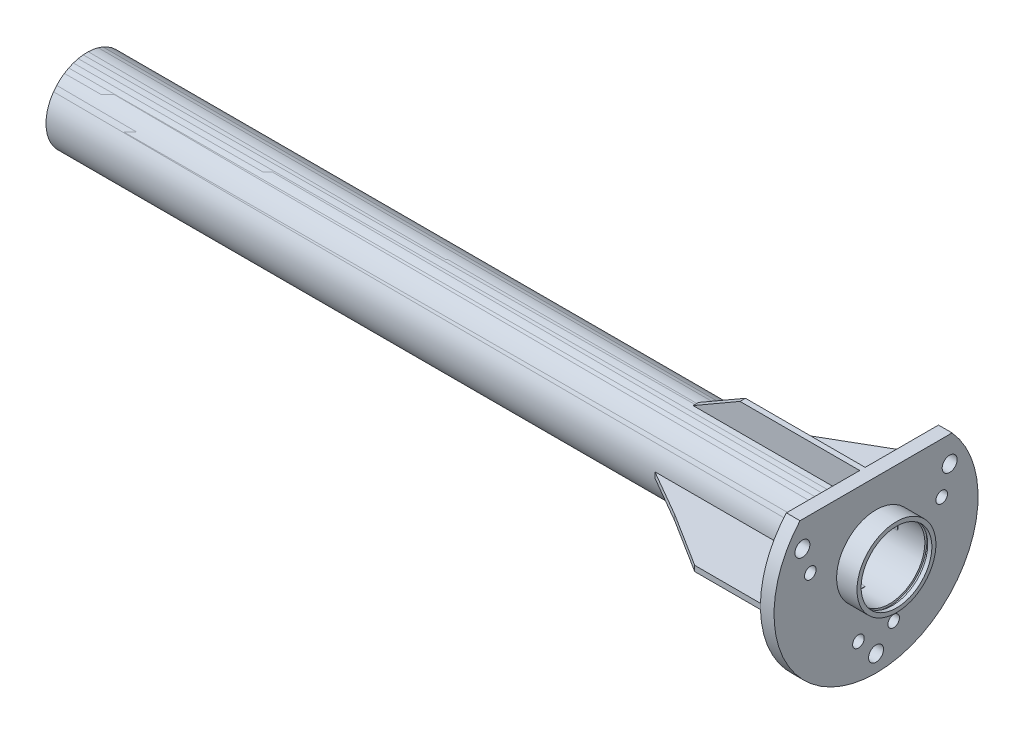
ISO-10303-21;
HEADER;
FILE_DESCRIPTION(('STEP AP214'),'2;1');
FILE_NAME('part.step','',(''),(''),'','','');
FILE_SCHEMA(('AUTOMOTIVE_DESIGN { 1 0 10303 214 1 1 1 1 }'));
ENDSEC;
DATA;
#1=APPLICATION_CONTEXT('core data for automotive mechanical design processes');
#2=APPLICATION_PROTOCOL_DEFINITION('international standard','automotive_design',2000,#1);
#3=PRODUCT_CONTEXT('',#1,'mechanical');
#4=PRODUCT('Part','Part','',(#3));
#5=PRODUCT_RELATED_PRODUCT_CATEGORY('part','',(#4));
#6=PRODUCT_DEFINITION_FORMATION('','',#4);
#7=PRODUCT_DEFINITION_CONTEXT('part definition',#1,'design');
#8=PRODUCT_DEFINITION('design','',#6,#7);
#9=PRODUCT_DEFINITION_SHAPE('','',#8);
#10=(LENGTH_UNIT() NAMED_UNIT(*) SI_UNIT(.MILLI.,.METRE.));
#11=(NAMED_UNIT(*) PLANE_ANGLE_UNIT() SI_UNIT($,.RADIAN.));
#12=(NAMED_UNIT(*) SI_UNIT($,.STERADIAN.) SOLID_ANGLE_UNIT());
#13=UNCERTAINTY_MEASURE_WITH_UNIT(LENGTH_MEASURE(1.E-05),#10,'distance_accuracy_value','');
#14=(GEOMETRIC_REPRESENTATION_CONTEXT(3) GLOBAL_UNCERTAINTY_ASSIGNED_CONTEXT((#13)) GLOBAL_UNIT_ASSIGNED_CONTEXT((#10,
#11,#12)) REPRESENTATION_CONTEXT('',''));
#15=CARTESIAN_POINT('',(0.,0.,0.));
#16=DIRECTION('',(0.,0.,1.));
#17=DIRECTION('',(1.,0.,0.));
#18=AXIS2_PLACEMENT_3D('',#15,#16,#17);
#19=CARTESIAN_POINT('',(144.5,-50.,-2.));
#20=DIRECTION('',(-0.500000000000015,-0.86602540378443,0.));
#21=DIRECTION('',(0.,0.,1.));
#22=AXIS2_PLACEMENT_3D('',#19,#20,#21);
#23=PLANE('',#22);
#24=DIRECTION('',(0.866025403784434,-0.500000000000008,0.));
#25=VECTOR('',#24,1.);
#26=CARTESIAN_POINT('',(110.0037692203,-30.0835918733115,2.));
#27=LINE('',#26,#25);
#28=CARTESIAN_POINT('',(110.003769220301,-30.0835918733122,2.));
#29=VERTEX_POINT('',#28);
#30=CARTESIAN_POINT('',(144.500000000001,-50.,1.99999999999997));
#31=VERTEX_POINT('',#30);
#32=EDGE_CURVE('P0_E512',#29,#31,#27,.T.);
#33=ORIENTED_EDGE('',*,*,#32,.F.);
#34=CARTESIAN_POINT('',(57.8974596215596,0.,0.));
#35=DIRECTION('',(-0.500000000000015,-0.86602540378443,0.));
#36=DIRECTION('',(-0.86602540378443,0.500000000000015,0.));
#37=AXIS2_PLACEMENT_3D('',#34,#35,#36);
#38=ELLIPSE('',#37,60.2999999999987,30.1500000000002);
#39=CARTESIAN_POINT('',(110.003769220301,-30.0835918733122,-1.9999999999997));
#40=VERTEX_POINT('',#39);
#41=EDGE_CURVE('P0_E352',#29,#40,#38,.F.);
#42=ORIENTED_EDGE('',*,*,#41,.T.);
#43=DIRECTION('',(-0.866025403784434,0.500000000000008,0.));
#44=VECTOR('',#43,1.);
#45=CARTESIAN_POINT('',(144.500000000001,-49.9999999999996,-2.));
#46=LINE('',#45,#44);
#47=CARTESIAN_POINT('',(144.5,-49.9999999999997,-2.));
#48=VERTEX_POINT('',#47);
#49=EDGE_CURVE('P0_E556',#48,#40,#46,.T.);
#50=ORIENTED_EDGE('',*,*,#49,.F.);
#51=DIRECTION('',(0.,0.,-1.));
#52=VECTOR('',#51,1.);
#53=CARTESIAN_POINT('',(144.5,-50.,42.));
#54=LINE('',#53,#52);
#55=EDGE_CURVE('P0_E513',#31,#48,#54,.T.);
#56=ORIENTED_EDGE('',*,*,#55,.F.);
#57=EDGE_LOOP('',(#33,#42,#50,#56));
#58=FACE_BOUND('',#57,.T.);
#59=ADVANCED_FACE('P0_F348',(#58),#23,.T.);
#60=CARTESIAN_POINT('',(187.80127018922,2.,-75.));
#61=DIRECTION('',(-0.500000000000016,0.,-0.86602540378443));
#62=DIRECTION('',(0.,-1.,0.));
#63=AXIS2_PLACEMENT_3D('',#60,#61,#62);
#64=PLANE('',#63);
#65=DIRECTION('',(0.866025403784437,0.,-0.500000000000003));
#66=VECTOR('',#65,1.);
#67=CARTESIAN_POINT('',(110.0037692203,-2.,-30.0835918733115));
#68=LINE('',#67,#66);
#69=CARTESIAN_POINT('',(110.003769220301,-1.99999999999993,-30.0835918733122));
#70=VERTEX_POINT('',#69);
#71=CARTESIAN_POINT('',(187.801270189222,-2.,-75.));
#72=VERTEX_POINT('',#71);
#73=EDGE_CURVE('P0_E555',#70,#72,#68,.T.);
#74=ORIENTED_EDGE('',*,*,#73,.F.);
#75=CARTESIAN_POINT('',(57.8974596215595,0.,0.));
#76=DIRECTION('',(-0.500000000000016,0.,-0.86602540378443));
#77=DIRECTION('',(-0.86602540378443,0.,0.500000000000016));
#78=AXIS2_PLACEMENT_3D('',#75,#76,#77);
#79=ELLIPSE('',#78,60.2999999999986,30.1500000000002);
#80=CARTESIAN_POINT('',(110.0037692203,1.99999999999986,-30.0835918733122));
#81=VERTEX_POINT('',#80);
#82=EDGE_CURVE('P0_E510',#70,#81,#79,.F.);
#83=ORIENTED_EDGE('',*,*,#82,.T.);
#84=DIRECTION('',(-0.866025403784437,0.,0.500000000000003));
#85=VECTOR('',#84,1.);
#86=CARTESIAN_POINT('',(187.801270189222,2.,-75.));
#87=LINE('',#86,#85);
#88=CARTESIAN_POINT('',(187.801270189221,2.,-75.));
#89=VERTEX_POINT('',#88);
#90=EDGE_CURVE('P0_E562',#89,#81,#87,.T.);
#91=ORIENTED_EDGE('',*,*,#90,.F.);
#92=DIRECTION('',(0.,1.,0.));
#93=VECTOR('',#92,1.);
#94=CARTESIAN_POINT('',(187.80127018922,-20.349364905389,-75.));
#95=LINE('',#94,#93);
#96=EDGE_CURVE('P0_E567',#72,#89,#95,.T.);
#97=ORIENTED_EDGE('',*,*,#96,.F.);
#98=EDGE_LOOP('',(#74,#83,#91,#97));
#99=FACE_BOUND('',#98,.T.);
#100=ADVANCED_FACE('P0_F812',(#99),#64,.T.);
#101=CARTESIAN_POINT('',(144.5,-2.,50.));
#102=DIRECTION('',(-0.500000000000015,0.,0.86602540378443));
#103=DIRECTION('',(0.,1.,0.));
#104=AXIS2_PLACEMENT_3D('',#101,#102,#103);
#105=PLANE('',#104);
#106=DIRECTION('',(0.866025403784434,0.,0.500000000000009));
#107=VECTOR('',#106,1.);
#108=CARTESIAN_POINT('',(110.003769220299,2.,30.0835918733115));
#109=LINE('',#108,#107);
#110=CARTESIAN_POINT('',(110.0037692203,2.,30.0835918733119));
#111=VERTEX_POINT('',#110);
#112=CARTESIAN_POINT('',(144.499999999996,2.,49.9999999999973));
#113=VERTEX_POINT('',#112);
#114=EDGE_CURVE('P0_E797',#111,#113,#109,.T.);
#115=ORIENTED_EDGE('',*,*,#114,.F.);
#116=CARTESIAN_POINT('',(57.8974596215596,0.,0.));
#117=DIRECTION('',(-0.500000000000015,0.,0.86602540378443));
#118=DIRECTION('',(-0.86602540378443,0.,-0.500000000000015));
#119=AXIS2_PLACEMENT_3D('',#116,#117,#118);
#120=ELLIPSE('',#119,60.2999999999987,30.1500000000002);
#121=CARTESIAN_POINT('',(110.003769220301,-1.99999999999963,30.0835918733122));
#122=VERTEX_POINT('',#121);
#123=EDGE_CURVE('P0_E527',#111,#122,#120,.F.);
#124=ORIENTED_EDGE('',*,*,#123,.T.);
#125=DIRECTION('',(-0.866025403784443,0.,-0.499999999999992));
#126=VECTOR('',#125,1.);
#127=CARTESIAN_POINT('',(144.49999829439,-2.,49.999999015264));
#128=LINE('',#127,#126);
#129=CARTESIAN_POINT('',(144.500000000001,-2.,49.9999999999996));
#130=VERTEX_POINT('',#129);
#131=EDGE_CURVE('P0_E549',#130,#122,#128,.T.);
#132=ORIENTED_EDGE('',*,*,#131,.F.);
#133=DIRECTION('',(0.,-1.,0.));
#134=VECTOR('',#133,1.);
#135=CARTESIAN_POINT('',(144.5,-21.469035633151,50.));
#136=LINE('',#135,#134);
#137=EDGE_CURVE('P0_E568',#113,#130,#136,.T.);
#138=ORIENTED_EDGE('',*,*,#137,.F.);
#139=EDGE_LOOP('',(#115,#124,#132,#138));
#140=FACE_BOUND('',#139,.T.);
#141=ADVANCED_FACE('P0_F1027',(#140),#105,.T.);
#142=CARTESIAN_POINT('',(144.5,2.,50.));
#143=DIRECTION('',(-0.532616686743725,0.,0.846356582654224));
#144=DIRECTION('',(0.,-1.,0.));
#145=AXIS2_PLACEMENT_3D('',#142,#143,#144);
#146=PLANE('',#145);
#147=DIRECTION('',(-0.846356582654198,0.,-0.532616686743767));
#148=VECTOR('',#147,1.);
#149=CARTESIAN_POINT('',(184.226345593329,-2.,75.));
#150=LINE('',#149,#148);
#151=CARTESIAN_POINT('',(184.226345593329,-2.,75.));
#152=VERTEX_POINT('',#151);
#153=EDGE_CURVE('P0_E517',#152,#130,#150,.T.);
#154=ORIENTED_EDGE('',*,*,#153,.F.);
#155=DIRECTION('',(0.,-1.,0.));
#156=VECTOR('',#155,1.);
#157=CARTESIAN_POINT('',(184.22634559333,-22.1368272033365,75.));
#158=LINE('',#157,#156);
#159=CARTESIAN_POINT('',(184.226345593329,2.,75.));
#160=VERTEX_POINT('',#159);
#161=EDGE_CURVE('P0_E563',#160,#152,#158,.T.);
#162=ORIENTED_EDGE('',*,*,#161,.F.);
#163=DIRECTION('',(0.846356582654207,0.,0.532616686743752));
#164=VECTOR('',#163,1.);
#165=CARTESIAN_POINT('',(144.499999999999,2.,49.9999999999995));
#166=LINE('',#165,#164);
#167=EDGE_CURVE('P0_E543',#113,#160,#166,.T.);
#168=ORIENTED_EDGE('',*,*,#167,.F.);
#169=ORIENTED_EDGE('',*,*,#137,.T.);
#170=EDGE_LOOP('',(#154,#162,#168,#169));
#171=FACE_BOUND('',#170,.T.);
#172=ADVANCED_FACE('P0_F1030',(#171),#146,.T.);
#173=CARTESIAN_POINT('',(232.5,2.,-75.));
#174=DIRECTION('',(0.,0.,-1.));
#175=DIRECTION('',(0.,-1.,0.));
#176=AXIS2_PLACEMENT_3D('',#173,#174,#175);
#177=PLANE('',#176);
#178=DIRECTION('',(1.,0.,0.));
#179=VECTOR('',#178,1.);
#180=CARTESIAN_POINT('',(185.0037692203,-2.,-75.));
#181=LINE('',#180,#179);
#182=CARTESIAN_POINT('',(232.5,-2.,-74.9999999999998));
#183=VERTEX_POINT('',#182);
#184=EDGE_CURVE('P0_E552',#72,#183,#181,.T.);
#185=ORIENTED_EDGE('',*,*,#184,.F.);
#186=ORIENTED_EDGE('',*,*,#96,.T.);
#187=DIRECTION('',(-1.,0.,0.));
#188=VECTOR('',#187,1.);
#189=CARTESIAN_POINT('',(157.5,2.,-75.));
#190=LINE('',#189,#188);
#191=CARTESIAN_POINT('',(232.5,2.,-74.9999999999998));
#192=VERTEX_POINT('',#191);
#193=EDGE_CURVE('P0_E559',#192,#89,#190,.T.);
#194=ORIENTED_EDGE('',*,*,#193,.F.);
#195=DIRECTION('',(0.,1.,0.));
#196=VECTOR('',#195,1.);
#197=CARTESIAN_POINT('',(232.5,0.,-74.9999999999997));
#198=LINE('',#197,#196);
#199=CARTESIAN_POINT('',(232.5,-1.89388909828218E-12,-74.9999999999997));
#200=VERTEX_POINT('',#199);
#201=EDGE_CURVE('P0_E794',#200,#192,#198,.T.);
#202=ORIENTED_EDGE('',*,*,#201,.F.);
#203=DIRECTION('',(0.,1.,0.));
#204=VECTOR('',#203,1.);
#205=CARTESIAN_POINT('',(232.5,0.,-74.9999999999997));
#206=LINE('',#205,#204);
#207=EDGE_CURVE('P0_E843',#183,#200,#206,.T.);
#208=ORIENTED_EDGE('',*,*,#207,.F.);
#209=EDGE_LOOP('',(#185,#186,#194,#202,#208));
#210=FACE_BOUND('',#209,.T.);
#211=ADVANCED_FACE('P0_F1070',(#210),#177,.T.);
#212=CARTESIAN_POINT('',(184.22634559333,2.,75.));
#213=DIRECTION('',(0.,0.,1.));
#214=DIRECTION('',(0.,-1.,0.));
#215=AXIS2_PLACEMENT_3D('',#212,#213,#214);
#216=PLANE('',#215);
#217=DIRECTION('',(0.,-1.,0.));
#218=VECTOR('',#217,1.);
#219=CARTESIAN_POINT('',(232.5,0.,75.));
#220=LINE('',#219,#218);
#221=CARTESIAN_POINT('',(232.5,-1.64121239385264E-12,74.9999999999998));
#222=VERTEX_POINT('',#221);
#223=CARTESIAN_POINT('',(232.5,-2.,75.));
#224=VERTEX_POINT('',#223);
#225=EDGE_CURVE('P0_E845',#222,#224,#220,.T.);
#226=ORIENTED_EDGE('',*,*,#225,.F.);
#227=DIRECTION('',(0.,-1.,0.));
#228=VECTOR('',#227,1.);
#229=CARTESIAN_POINT('',(232.5,0.,75.));
#230=LINE('',#229,#228);
#231=CARTESIAN_POINT('',(232.5,2.,75.));
#232=VERTEX_POINT('',#231);
#233=EDGE_CURVE('P0_E862',#232,#222,#230,.T.);
#234=ORIENTED_EDGE('',*,*,#233,.F.);
#235=DIRECTION('',(1.,0.,0.));
#236=VECTOR('',#235,1.);
#237=CARTESIAN_POINT('',(157.5,2.,75.));
#238=LINE('',#237,#236);
#239=EDGE_CURVE('P0_E539',#160,#232,#238,.T.);
#240=ORIENTED_EDGE('',*,*,#239,.F.);
#241=ORIENTED_EDGE('',*,*,#161,.T.);
#242=DIRECTION('',(-1.,0.,0.));
#243=VECTOR('',#242,1.);
#244=CARTESIAN_POINT('',(185.0037692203,-2.,75.));
#245=LINE('',#244,#243);
#246=EDGE_CURVE('P0_E546',#224,#152,#245,.T.);
#247=ORIENTED_EDGE('',*,*,#246,.F.);
#248=EDGE_LOOP('',(#226,#234,#240,#241,#247));
#249=FACE_BOUND('',#248,.T.);
#250=ADVANCED_FACE('P0_F1072',(#249),#216,.T.);
#251=CARTESIAN_POINT('',(232.5,2.,-75.));
#252=DIRECTION('',(0.,1.,0.));
#253=DIRECTION('',(-1.,0.,0.));
#254=AXIS2_PLACEMENT_3D('',#251,#252,#253);
#255=PLANE('',#254);
#256=ORIENTED_EDGE('',*,*,#90,.T.);
#257=DIRECTION('',(1.,0.,0.));
#258=VECTOR('',#257,1.);
#259=CARTESIAN_POINT('',(-52.5,1.99999999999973,-30.0835918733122));
#260=LINE('',#259,#258);
#261=CARTESIAN_POINT('',(232.5,2.00000000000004,-30.0835918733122));
#262=VERTEX_POINT('',#261);
#263=EDGE_CURVE('P0_E536',#81,#262,#260,.T.);
#264=ORIENTED_EDGE('',*,*,#263,.T.);
#265=DIRECTION('',(0.,0.,1.));
#266=VECTOR('',#265,1.);
#267=CARTESIAN_POINT('',(232.5,1.99999999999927,-74.9733285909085));
#268=LINE('',#267,#266);
#269=CARTESIAN_POINT('',(232.5,1.99999999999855,-74.9733285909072));
#270=VERTEX_POINT('',#269);
#271=EDGE_CURVE('P0_E784',#270,#262,#268,.T.);
#272=ORIENTED_EDGE('',*,*,#271,.F.);
#273=DIRECTION('',(0.,0.,1.));
#274=VECTOR('',#273,1.);
#275=CARTESIAN_POINT('',(232.5,2.,-76.973328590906));
#276=LINE('',#275,#274);
#277=EDGE_CURVE('P0_E825',#192,#270,#276,.T.);
#278=ORIENTED_EDGE('',*,*,#277,.F.);
#279=ORIENTED_EDGE('',*,*,#193,.T.);
#280=EDGE_LOOP('',(#256,#264,#272,#278,#279));
#281=FACE_BOUND('',#280,.T.);
#282=ADVANCED_FACE('P0_F816',(#281),#255,.T.);
#283=CARTESIAN_POINT('',(110.0037692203,-2.,-75.));
#284=DIRECTION('',(0.,-1.,0.));
#285=DIRECTION('',(1.,0.,0.));
#286=AXIS2_PLACEMENT_3D('',#283,#284,#285);
#287=PLANE('',#286);
#288=ORIENTED_EDGE('',*,*,#246,.T.);
#289=ORIENTED_EDGE('',*,*,#153,.T.);
#290=ORIENTED_EDGE('',*,*,#131,.T.);
#291=DIRECTION('',(1.,0.,0.));
#292=VECTOR('',#291,1.);
#293=CARTESIAN_POINT('',(-52.5,-1.9999999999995,30.0835918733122));
#294=LINE('',#293,#292);
#295=CARTESIAN_POINT('',(232.5,-1.99999999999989,30.0835918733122));
#296=VERTEX_POINT('',#295);
#297=EDGE_CURVE('P0_E523',#122,#296,#294,.T.);
#298=ORIENTED_EDGE('',*,*,#297,.T.);
#299=DIRECTION('',(0.,0.,-1.));
#300=VECTOR('',#299,1.);
#301=CARTESIAN_POINT('',(232.5,-1.99999999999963,74.9733285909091));
#302=LINE('',#301,#300);
#303=CARTESIAN_POINT('',(232.5,-1.99999999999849,74.9733285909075));
#304=VERTEX_POINT('',#303);
#305=EDGE_CURVE('P0_E775',#304,#296,#302,.T.);
#306=ORIENTED_EDGE('',*,*,#305,.F.);
#307=DIRECTION('',(0.,0.,-1.));
#308=VECTOR('',#307,1.);
#309=CARTESIAN_POINT('',(232.5,-2.,73.));
#310=LINE('',#309,#308);
#311=EDGE_CURVE('P0_E852',#224,#304,#310,.T.);
#312=ORIENTED_EDGE('',*,*,#311,.F.);
#313=EDGE_LOOP('',(#288,#289,#290,#298,#306,#312));
#314=FACE_BOUND('',#313,.T.);
#315=ADVANCED_FACE('P0_F1023',(#314),#287,.T.);
#316=CARTESIAN_POINT('',(232.5,-25.700536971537,2.));
#317=DIRECTION('',(0.,0.,1.));
#318=DIRECTION('',(-1.,0.,0.));
#319=AXIS2_PLACEMENT_3D('',#316,#317,#318);
#320=PLANE('',#319);
#321=ORIENTED_EDGE('',*,*,#32,.T.);
#322=DIRECTION('',(-1.,0.,0.));
#323=VECTOR('',#322,1.);
#324=CARTESIAN_POINT('',(188.5,-50.,1.99999999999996));
#325=LINE('',#324,#323);
#326=CARTESIAN_POINT('',(232.5,-50.0000000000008,2.00000000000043));
#327=VERTEX_POINT('',#326);
#328=EDGE_CURVE('P0_E516',#327,#31,#325,.T.);
#329=ORIENTED_EDGE('',*,*,#328,.F.);
#330=DIRECTION('',(0.,-1.,0.));
#331=VECTOR('',#330,1.);
#332=CARTESIAN_POINT('',(232.5,-30.0835918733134,1.99999999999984));
#333=LINE('',#332,#331);
#334=CARTESIAN_POINT('',(232.5,-30.0835918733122,1.99999999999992));
#335=VERTEX_POINT('',#334);
#336=EDGE_CURVE('P0_E521',#335,#327,#333,.T.);
#337=ORIENTED_EDGE('',*,*,#336,.F.);
#338=DIRECTION('',(-1.,0.,0.));
#339=VECTOR('',#338,1.);
#340=CARTESIAN_POINT('',(-52.5,-30.0835918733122,2.));
#341=LINE('',#340,#339);
#342=EDGE_CURVE('P0_E506',#335,#29,#341,.T.);
#343=ORIENTED_EDGE('',*,*,#342,.T.);
#344=EDGE_LOOP('',(#321,#329,#337,#343));
#345=FACE_BOUND('',#344,.T.);
#346=ADVANCED_FACE('P0_F519',(#345),#320,.T.);
#347=CARTESIAN_POINT('',(232.5,-50.,-2.));
#348=DIRECTION('',(0.,-1.,0.));
#349=DIRECTION('',(0.,0.,1.));
#350=AXIS2_PLACEMENT_3D('',#347,#348,#349);
#351=PLANE('',#350);
#352=ORIENTED_EDGE('',*,*,#328,.T.);
#353=ORIENTED_EDGE('',*,*,#55,.T.);
#354=DIRECTION('',(-1.,0.,0.));
#355=VECTOR('',#354,1.);
#356=CARTESIAN_POINT('',(171.25188461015,-49.9999999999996,-2.));
#357=LINE('',#356,#355);
#358=CARTESIAN_POINT('',(232.5,-50.0000000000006,-2.00000000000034));
#359=VERTEX_POINT('',#358);
#360=EDGE_CURVE('P0_E572',#359,#48,#357,.T.);
#361=ORIENTED_EDGE('',*,*,#360,.F.);
#362=DIRECTION('',(0.,0.,-1.));
#363=VECTOR('',#362,1.);
#364=CARTESIAN_POINT('',(232.5,-50.0000000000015,2.00000000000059));
#365=LINE('',#364,#363);
#366=EDGE_CURVE('P0_E769',#327,#359,#365,.T.);
#367=ORIENTED_EDGE('',*,*,#366,.F.);
#368=EDGE_LOOP('',(#352,#353,#361,#367));
#369=FACE_BOUND('',#368,.T.);
#370=ADVANCED_FACE('P0_F1016',(#369),#351,.T.);
#371=CARTESIAN_POINT('',(110.0037692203,-25.700536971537,-2.));
#372=DIRECTION('',(0.,0.,-1.));
#373=DIRECTION('',(1.,0.,0.));
#374=AXIS2_PLACEMENT_3D('',#371,#372,#373);
#375=PLANE('',#374);
#376=DIRECTION('',(1.,0.,0.));
#377=VECTOR('',#376,1.);
#378=CARTESIAN_POINT('',(-52.5,-30.0835918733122,-1.99999999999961));
#379=LINE('',#378,#377);
#380=CARTESIAN_POINT('',(232.5,-30.0835918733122,-1.99999999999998));
#381=VERTEX_POINT('',#380);
#382=EDGE_CURVE('P0_E509',#40,#381,#379,.T.);
#383=ORIENTED_EDGE('',*,*,#382,.T.);
#384=DIRECTION('',(0.,1.,0.));
#385=VECTOR('',#384,1.);
#386=CARTESIAN_POINT('',(232.5,-50.0000000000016,-2.00000000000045));
#387=LINE('',#386,#385);
#388=EDGE_CURVE('P0_E766',#359,#381,#387,.T.);
#389=ORIENTED_EDGE('',*,*,#388,.F.);
#390=ORIENTED_EDGE('',*,*,#360,.T.);
#391=ORIENTED_EDGE('',*,*,#49,.T.);
#392=EDGE_LOOP('',(#383,#389,#390,#391));
#393=FACE_BOUND('',#392,.T.);
#394=ADVANCED_FACE('P0_F1139',(#393),#375,.T.);
#395=CARTESIAN_POINT('',(110.0037692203,-2.,-75.));
#396=DIRECTION('',(0.,-1.,0.));
#397=DIRECTION('',(1.,0.,0.));
#398=AXIS2_PLACEMENT_3D('',#395,#396,#397);
#399=PLANE('',#398);
#400=DIRECTION('',(-1.,0.,0.));
#401=VECTOR('',#400,1.);
#402=CARTESIAN_POINT('',(-52.5,-1.99999999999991,-30.0835918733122));
#403=LINE('',#402,#401);
#404=CARTESIAN_POINT('',(232.5,-1.99999999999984,-30.0835918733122));
#405=VERTEX_POINT('',#404);
#406=EDGE_CURVE('P0_E525',#405,#70,#403,.T.);
#407=ORIENTED_EDGE('',*,*,#406,.T.);
#408=ORIENTED_EDGE('',*,*,#73,.T.);
#409=ORIENTED_EDGE('',*,*,#184,.T.);
#410=DIRECTION('',(0.,0.,-1.));
#411=VECTOR('',#410,1.);
#412=CARTESIAN_POINT('',(232.5,-2.,-76.973328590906));
#413=LINE('',#412,#411);
#414=CARTESIAN_POINT('',(232.5,-1.99999999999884,-74.973328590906));
#415=VERTEX_POINT('',#414);
#416=EDGE_CURVE('P0_E831',#415,#183,#413,.T.);
#417=ORIENTED_EDGE('',*,*,#416,.F.);
#418=DIRECTION('',(0.,0.,-1.));
#419=VECTOR('',#418,1.);
#420=CARTESIAN_POINT('',(232.5,-1.99999999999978,-30.0835918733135));
#421=LINE('',#420,#419);
#422=EDGE_CURVE('P0_E760',#405,#415,#421,.T.);
#423=ORIENTED_EDGE('',*,*,#422,.F.);
#424=EDGE_LOOP('',(#407,#408,#409,#417,#423));
#425=FACE_BOUND('',#424,.T.);
#426=ADVANCED_FACE('P0_F1066',(#425),#399,.T.);
#427=CARTESIAN_POINT('',(232.5,0.,0.));
#428=DIRECTION('',(-1.,0.,0.));
#429=DIRECTION('',(0.,0.,1.));
#430=AXIS2_PLACEMENT_3D('',#427,#428,#429);
#431=CYLINDRICAL_SURFACE('',#430,30.1500000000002);
#432=CARTESIAN_POINT('',(-337.5,-1.54214946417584E-13,2.12258664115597E-13));
#433=DIRECTION('',(-1.,0.,0.));
#434=DIRECTION('',(0.,0.,1.));
#435=AXIS2_PLACEMENT_3D('',#432,#433,#434);
#436=CIRCLE('',#435,30.1500000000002);
#437=CARTESIAN_POINT('',(-337.5,-1.54214946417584E-13,30.1500000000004));
#438=VERTEX_POINT('',#437);
#439=EDGE_CURVE('P0_E542',#438,#438,#436,.T.);
#440=ORIENTED_EDGE('',*,*,#439,.F.);
#441=EDGE_LOOP('',(#440));
#442=FACE_BOUND('',#441,.T.);
#443=CARTESIAN_POINT('',(232.5,0.,0.));
#444=DIRECTION('',(-1.,0.,0.));
#445=DIRECTION('',(0.,0.,1.));
#446=AXIS2_PLACEMENT_3D('',#443,#444,#445);
#447=CIRCLE('',#446,30.1500000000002);
#448=CARTESIAN_POINT('',(232.5,30.0835918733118,2.00000000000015));
#449=VERTEX_POINT('',#448);
#450=CARTESIAN_POINT('',(232.5,1.99999999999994,30.0835918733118));
#451=VERTEX_POINT('',#450);
#452=EDGE_CURVE('P0_E754',#449,#451,#447,.F.);
#453=ORIENTED_EDGE('',*,*,#452,.F.);
#454=DIRECTION('',(1.,0.,0.));
#455=VECTOR('',#454,1.);
#456=CARTESIAN_POINT('',(171.25188461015,30.0835918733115,2.));
#457=LINE('',#456,#455);
#458=CARTESIAN_POINT('',(110.0037692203,30.0835918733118,2.));
#459=VERTEX_POINT('',#458);
#460=EDGE_CURVE('P0_E865',#459,#449,#457,.T.);
#461=ORIENTED_EDGE('',*,*,#460,.F.);
#462=CARTESIAN_POINT('',(57.8974596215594,0.,0.));
#463=DIRECTION('',(-0.500000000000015,0.86602540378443,0.));
#464=DIRECTION('',(-0.86602540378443,-0.500000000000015,0.));
#465=AXIS2_PLACEMENT_3D('',#462,#463,#464);
#466=ELLIPSE('',#465,60.2999999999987,30.1500000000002);
#467=CARTESIAN_POINT('',(110.0037692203,30.0835918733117,-2.));
#468=VERTEX_POINT('',#467);
#469=EDGE_CURVE('P0_E535',#468,#459,#466,.F.);
#470=ORIENTED_EDGE('',*,*,#469,.F.);
#471=DIRECTION('',(-1.,0.,0.));
#472=VECTOR('',#471,1.);
#473=CARTESIAN_POINT('',(171.25188461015,30.0835918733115,-2.));
#474=LINE('',#473,#472);
#475=CARTESIAN_POINT('',(232.5,30.0835918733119,-1.99999999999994));
#476=VERTEX_POINT('',#475);
#477=EDGE_CURVE('P0_E531',#476,#468,#474,.T.);
#478=ORIENTED_EDGE('',*,*,#477,.F.);
#479=CARTESIAN_POINT('',(232.5,0.,0.));
#480=DIRECTION('',(-1.,0.,0.));
#481=DIRECTION('',(0.,0.,1.));
#482=AXIS2_PLACEMENT_3D('',#479,#480,#481);
#483=CIRCLE('',#482,30.1500000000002);
#484=EDGE_CURVE('P0_E781',#262,#476,#483,.F.);
#485=ORIENTED_EDGE('',*,*,#484,.F.);
#486=ORIENTED_EDGE('',*,*,#263,.F.);
#487=ORIENTED_EDGE('',*,*,#82,.F.);
#488=ORIENTED_EDGE('',*,*,#406,.F.);
#489=CARTESIAN_POINT('',(232.5,0.,0.));
#490=DIRECTION('',(-1.,0.,0.));
#491=DIRECTION('',(0.,0.,1.));
#492=AXIS2_PLACEMENT_3D('',#489,#490,#491);
#493=CIRCLE('',#492,30.1500000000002);
#494=EDGE_CURVE('P0_E763',#381,#405,#493,.F.);
#495=ORIENTED_EDGE('',*,*,#494,.F.);
#496=ORIENTED_EDGE('',*,*,#382,.F.);
#497=ORIENTED_EDGE('',*,*,#41,.F.);
#498=ORIENTED_EDGE('',*,*,#342,.F.);
#499=CARTESIAN_POINT('',(232.5,0.,0.));
#500=DIRECTION('',(-1.,0.,0.));
#501=DIRECTION('',(0.,0.,1.));
#502=AXIS2_PLACEMENT_3D('',#499,#500,#501);
#503=CIRCLE('',#502,30.1500000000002);
#504=EDGE_CURVE('P0_E773',#296,#335,#503,.F.);
#505=ORIENTED_EDGE('',*,*,#504,.F.);
#506=ORIENTED_EDGE('',*,*,#297,.F.);
#507=ORIENTED_EDGE('',*,*,#123,.F.);
#508=DIRECTION('',(-1.,0.,0.));
#509=VECTOR('',#508,1.);
#510=CARTESIAN_POINT('',(157.5,2.,30.0835918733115));
#511=LINE('',#510,#509);
#512=EDGE_CURVE('P0_E538',#451,#111,#511,.T.);
#513=ORIENTED_EDGE('',*,*,#512,.F.);
#514=EDGE_LOOP('',(#453,#461,#470,#478,#485,#486,#487,#488,#495,#496,#497,#498,#505,#506,#507,#513));
#515=FACE_BOUND('',#514,.T.);
#516=ADVANCED_FACE('P0_F503',(#442,#515),#431,.T.);
#517=CARTESIAN_POINT('',(232.5,2.,-75.));
#518=DIRECTION('',(0.,1.,0.));
#519=DIRECTION('',(-1.,0.,0.));
#520=AXIS2_PLACEMENT_3D('',#517,#518,#519);
#521=PLANE('',#520);
#522=ORIENTED_EDGE('',*,*,#239,.T.);
#523=DIRECTION('',(0.,0.,1.));
#524=VECTOR('',#523,1.);
#525=CARTESIAN_POINT('',(232.5,2.,73.));
#526=LINE('',#525,#524);
#527=CARTESIAN_POINT('',(232.5,1.99999999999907,74.9733285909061));
#528=VERTEX_POINT('',#527);
#529=EDGE_CURVE('P0_E855',#528,#232,#526,.T.);
#530=ORIENTED_EDGE('',*,*,#529,.F.);
#531=DIRECTION('',(0.,0.,1.));
#532=VECTOR('',#531,1.);
#533=CARTESIAN_POINT('',(232.5,1.99999999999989,30.0835918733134));
#534=LINE('',#533,#532);
#535=EDGE_CURVE('P0_E751',#451,#528,#534,.T.);
#536=ORIENTED_EDGE('',*,*,#535,.F.);
#537=ORIENTED_EDGE('',*,*,#512,.T.);
#538=ORIENTED_EDGE('',*,*,#114,.T.);
#539=ORIENTED_EDGE('',*,*,#167,.T.);
#540=EDGE_LOOP('',(#522,#530,#536,#537,#538,#539));
#541=FACE_BOUND('',#540,.T.);
#542=ADVANCED_FACE('P0_F1033',(#541),#521,.T.);
#543=CARTESIAN_POINT('',(-337.5,-42.113587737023,6.6701370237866));
#544=DIRECTION('',(-1.,0.,0.));
#545=DIRECTION('',(0.,0.809016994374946,0.587785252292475));
#546=AXIS2_PLACEMENT_3D('',#543,#544,#545);
#547=PLANE('',#546);
#548=CARTESIAN_POINT('',(-337.5,0.,0.));
#549=DIRECTION('',(-1.,0.,0.));
#550=DIRECTION('',(0.,0.,1.));
#551=AXIS2_PLACEMENT_3D('',#548,#549,#550);
#552=CIRCLE('',#551,26.0000000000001);
#553=CARTESIAN_POINT('',(-337.5,0.,26.0000000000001));
#554=VERTEX_POINT('',#553);
#555=EDGE_CURVE('P0_E748',#554,#554,#552,.T.);
#556=ORIENTED_EDGE('',*,*,#555,.F.);
#557=EDGE_LOOP('',(#556));
#558=FACE_BOUND('',#557,.T.);
#559=ORIENTED_EDGE('',*,*,#439,.T.);
#560=EDGE_LOOP('',(#559));
#561=FACE_BOUND('',#560,.T.);
#562=ADVANCED_FACE('P0_F1166',(#558,#561),#547,.T.);
#563=CARTESIAN_POINT('',(232.5,2.,-74.973328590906));
#564=DIRECTION('',(1.,0.,0.));
#565=DIRECTION('',(0.,-1.,0.));
#566=AXIS2_PLACEMENT_3D('',#563,#564,#565);
#567=PLANE('',#566);
#568=ORIENTED_EDGE('',*,*,#277,.T.);
#569=CARTESIAN_POINT('',(232.5,0.,0.));
#570=DIRECTION('',(-1.,0.,0.));
#571=DIRECTION('',(0.,0.,1.));
#572=AXIS2_PLACEMENT_3D('',#569,#570,#571);
#573=CIRCLE('',#572,74.9999999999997);
#574=EDGE_CURVE('P0_E742',#270,#200,#573,.T.);
#575=ORIENTED_EDGE('',*,*,#574,.T.);
#576=ORIENTED_EDGE('',*,*,#201,.T.);
#577=EDGE_LOOP('',(#568,#575,#576));
#578=FACE_BOUND('',#577,.T.);
#579=ADVANCED_FACE('P0_F833',(#578),#567,.T.);
#580=CARTESIAN_POINT('',(232.5,2.,-74.973328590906));
#581=DIRECTION('',(1.,0.,0.));
#582=DIRECTION('',(0.,-1.,0.));
#583=AXIS2_PLACEMENT_3D('',#580,#581,#582);
#584=PLANE('',#583);
#585=ORIENTED_EDGE('',*,*,#207,.T.);
#586=CARTESIAN_POINT('',(232.5,0.,0.));
#587=DIRECTION('',(-1.,0.,0.));
#588=DIRECTION('',(0.,0.,1.));
#589=AXIS2_PLACEMENT_3D('',#586,#587,#588);
#590=CIRCLE('',#589,74.9999999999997);
#591=EDGE_CURVE('P0_E739',#200,#415,#590,.T.);
#592=ORIENTED_EDGE('',*,*,#591,.T.);
#593=ORIENTED_EDGE('',*,*,#416,.T.);
#594=EDGE_LOOP('',(#585,#592,#593));
#595=FACE_BOUND('',#594,.T.);
#596=ADVANCED_FACE('P0_F1063',(#595),#584,.T.);
#597=CARTESIAN_POINT('',(232.5,2.,75.));
#598=DIRECTION('',(1.,0.,0.));
#599=DIRECTION('',(0.,-1.,0.));
#600=AXIS2_PLACEMENT_3D('',#597,#598,#599);
#601=PLANE('',#600);
#602=ORIENTED_EDGE('',*,*,#311,.T.);
#603=CARTESIAN_POINT('',(232.5,0.,0.));
#604=DIRECTION('',(-1.,0.,0.));
#605=DIRECTION('',(0.,0.,1.));
#606=AXIS2_PLACEMENT_3D('',#603,#604,#605);
#607=CIRCLE('',#606,74.9999999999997);
#608=EDGE_CURVE('P0_E733',#304,#222,#607,.T.);
#609=ORIENTED_EDGE('',*,*,#608,.T.);
#610=ORIENTED_EDGE('',*,*,#225,.T.);
#611=EDGE_LOOP('',(#602,#609,#610));
#612=FACE_BOUND('',#611,.T.);
#613=ADVANCED_FACE('P0_F1186',(#612),#601,.T.);
#614=CARTESIAN_POINT('',(232.5,2.,75.));
#615=DIRECTION('',(1.,0.,0.));
#616=DIRECTION('',(0.,-1.,0.));
#617=AXIS2_PLACEMENT_3D('',#614,#615,#616);
#618=PLANE('',#617);
#619=ORIENTED_EDGE('',*,*,#233,.T.);
#620=CARTESIAN_POINT('',(232.5,0.,0.));
#621=DIRECTION('',(-1.,0.,0.));
#622=DIRECTION('',(0.,0.,1.));
#623=AXIS2_PLACEMENT_3D('',#620,#621,#622);
#624=CIRCLE('',#623,74.9999999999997);
#625=EDGE_CURVE('P0_E730',#222,#528,#624,.T.);
#626=ORIENTED_EDGE('',*,*,#625,.T.);
#627=ORIENTED_EDGE('',*,*,#529,.T.);
#628=EDGE_LOOP('',(#619,#626,#627));
#629=FACE_BOUND('',#628,.T.);
#630=ADVANCED_FACE('P0_F1193',(#629),#618,.T.);
#631=CARTESIAN_POINT('',(110.0037692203,25.700536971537,2.));
#632=DIRECTION('',(0.,0.,1.));
#633=DIRECTION('',(1.,0.,0.));
#634=AXIS2_PLACEMENT_3D('',#631,#632,#633);
#635=PLANE('',#634);
#636=ORIENTED_EDGE('',*,*,#460,.T.);
#637=DIRECTION('',(0.,-1.,0.));
#638=VECTOR('',#637,1.);
#639=CARTESIAN_POINT('',(232.5,50.0000000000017,2.00000000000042));
#640=LINE('',#639,#638);
#641=CARTESIAN_POINT('',(232.5,50.,2.00000000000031));
#642=VERTEX_POINT('',#641);
#643=EDGE_CURVE('P0_E757',#642,#449,#640,.T.);
#644=ORIENTED_EDGE('',*,*,#643,.F.);
#645=DIRECTION('',(-1.,0.,0.));
#646=VECTOR('',#645,1.);
#647=CARTESIAN_POINT('',(186.598300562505,50.,2.0000000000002));
#648=LINE('',#647,#646);
#649=CARTESIAN_POINT('',(144.499999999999,49.9999999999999,2.00000000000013));
#650=VERTEX_POINT('',#649);
#651=EDGE_CURVE('P0_E995',#642,#650,#648,.T.);
#652=ORIENTED_EDGE('',*,*,#651,.T.);
#653=DIRECTION('',(0.86602540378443,0.500000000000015,0.));
#654=VECTOR('',#653,1.);
#655=CARTESIAN_POINT('',(127.25188461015,40.041795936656,2.));
#656=LINE('',#655,#654);
#657=EDGE_CURVE('P0_E791',#459,#650,#656,.T.);
#658=ORIENTED_EDGE('',*,*,#657,.F.);
#659=EDGE_LOOP('',(#636,#644,#652,#658));
#660=FACE_BOUND('',#659,.T.);
#661=ADVANCED_FACE('P0_F1038',(#660),#635,.T.);
#662=CARTESIAN_POINT('',(144.5,50.,2.));
#663=DIRECTION('',(-0.500000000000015,0.86602540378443,0.));
#664=DIRECTION('',(0.,0.,-1.));
#665=AXIS2_PLACEMENT_3D('',#662,#663,#664);
#666=PLANE('',#665);
#667=DIRECTION('',(0.866025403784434,0.500000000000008,0.));
#668=VECTOR('',#667,1.);
#669=CARTESIAN_POINT('',(110.0037692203,30.0835918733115,-2.));
#670=LINE('',#669,#668);
#671=CARTESIAN_POINT('',(144.5,50.,-2.00000000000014));
#672=VERTEX_POINT('',#671);
#673=EDGE_CURVE('P0_E534',#468,#672,#670,.T.);
#674=ORIENTED_EDGE('',*,*,#673,.F.);
#675=ORIENTED_EDGE('',*,*,#469,.T.);
#676=ORIENTED_EDGE('',*,*,#657,.T.);
#677=DIRECTION('',(0.,0.,-1.));
#678=VECTOR('',#677,1.);
#679=CARTESIAN_POINT('',(144.499999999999,50.,0.));
#680=LINE('',#679,#678);
#681=EDGE_CURVE('P0_E993',#650,#672,#680,.T.);
#682=ORIENTED_EDGE('',*,*,#681,.T.);
#683=EDGE_LOOP('',(#674,#675,#676,#682));
#684=FACE_BOUND('',#683,.T.);
#685=ADVANCED_FACE('P0_F1052',(#684),#666,.T.);
#686=CARTESIAN_POINT('',(232.5,25.700536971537,-2.));
#687=DIRECTION('',(0.,0.,-1.));
#688=DIRECTION('',(-1.,0.,0.));
#689=AXIS2_PLACEMENT_3D('',#686,#687,#688);
#690=PLANE('',#689);
#691=ORIENTED_EDGE('',*,*,#673,.T.);
#692=DIRECTION('',(1.,0.,0.));
#693=VECTOR('',#692,1.);
#694=CARTESIAN_POINT('',(186.598300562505,50.,-2.00000000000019));
#695=LINE('',#694,#693);
#696=CARTESIAN_POINT('',(232.5,50.,-2.00000000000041));
#697=VERTEX_POINT('',#696);
#698=EDGE_CURVE('P0_E991',#672,#697,#695,.T.);
#699=ORIENTED_EDGE('',*,*,#698,.T.);
#700=DIRECTION('',(0.,1.,0.));
#701=VECTOR('',#700,1.);
#702=CARTESIAN_POINT('',(232.5,30.0835918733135,-1.99999999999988));
#703=LINE('',#702,#701);
#704=EDGE_CURVE('P0_E778',#476,#697,#703,.T.);
#705=ORIENTED_EDGE('',*,*,#704,.F.);
#706=ORIENTED_EDGE('',*,*,#477,.T.);
#707=EDGE_LOOP('',(#691,#699,#705,#706));
#708=FACE_BOUND('',#707,.T.);
#709=ADVANCED_FACE('P0_F1054',(#708),#690,.T.);
#710=CARTESIAN_POINT('',(232.5,-104.76016850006,16.592380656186));
#711=DIRECTION('',(-1.,0.,0.));
#712=DIRECTION('',(0.,0.809016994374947,0.587785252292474));
#713=AXIS2_PLACEMENT_3D('',#710,#711,#712);
#714=PLANE('',#713);
#715=CARTESIAN_POINT('',(232.5,12.940952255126,-48.296291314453));
#716=DIRECTION('',(1.,0.,0.));
#717=DIRECTION('',(0.,1.,0.));
#718=AXIS2_PLACEMENT_3D('',#715,#716,#717);
#719=CIRCLE('',#718,4.25000000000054);
#720=CARTESIAN_POINT('',(232.5,17.1909522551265,-48.296291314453));
#721=VERTEX_POINT('',#720);
#722=EDGE_CURVE('P0_E714',#721,#721,#719,.F.);
#723=ORIENTED_EDGE('',*,*,#722,.F.);
#724=EDGE_LOOP('',(#723));
#725=FACE_BOUND('',#724,.T.);
#726=CARTESIAN_POINT('',(232.5,31.25,-54.126587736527));
#727=DIRECTION('',(1.,0.,0.));
#728=DIRECTION('',(0.,0.,-1.));
#729=AXIS2_PLACEMENT_3D('',#726,#727,#728);
#730=CIRCLE('',#729,5.5000000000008);
#731=CARTESIAN_POINT('',(232.5,31.25,-59.6265877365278));
#732=VERTEX_POINT('',#731);
#733=EDGE_CURVE('P0_E720',#732,#732,#730,.F.);
#734=ORIENTED_EDGE('',*,*,#733,.F.);
#735=EDGE_LOOP('',(#734));
#736=FACE_BOUND('',#735,.T.);
#737=ORIENTED_EDGE('',*,*,#704,.T.);
#738=DIRECTION('',(0.,0.,-1.));
#739=VECTOR('',#738,1.);
#740=CARTESIAN_POINT('',(232.5,50.,0.));
#741=LINE('',#740,#739);
#742=CARTESIAN_POINT('',(232.5,50.,-55.9016994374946));
#743=VERTEX_POINT('',#742);
#744=EDGE_CURVE('P0_E986',#697,#743,#741,.T.);
#745=ORIENTED_EDGE('',*,*,#744,.T.);
#746=CARTESIAN_POINT('',(232.5,0.,0.));
#747=DIRECTION('',(-1.,0.,0.));
#748=DIRECTION('',(0.,0.,1.));
#749=AXIS2_PLACEMENT_3D('',#746,#747,#748);
#750=CIRCLE('',#749,74.9999999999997);
#751=EDGE_CURVE('P0_E745',#743,#270,#750,.T.);
#752=ORIENTED_EDGE('',*,*,#751,.T.);
#753=ORIENTED_EDGE('',*,*,#271,.T.);
#754=ORIENTED_EDGE('',*,*,#484,.T.);
#755=EDGE_LOOP('',(#737,#745,#752,#753,#754));
#756=FACE_BOUND('',#755,.T.);
#757=ADVANCED_FACE('P0_F822',(#725,#736,#756),#714,.T.);
#758=CARTESIAN_POINT('',(232.5,-144.451824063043,22.5662655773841));
#759=DIRECTION('',(-1.,0.,0.));
#760=DIRECTION('',(0.,0.809016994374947,0.587785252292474));
#761=AXIS2_PLACEMENT_3D('',#758,#759,#760);
#762=PLANE('',#761);
#763=CARTESIAN_POINT('',(232.5,-48.296291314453,12.940952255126));
#764=DIRECTION('',(1.,0.,0.));
#765=DIRECTION('',(0.,1.,0.));
#766=AXIS2_PLACEMENT_3D('',#763,#764,#765);
#767=CIRCLE('',#766,4.24999999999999);
#768=CARTESIAN_POINT('',(232.5,-44.046291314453,12.940952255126));
#769=VERTEX_POINT('',#768);
#770=EDGE_CURVE('P0_E708',#769,#769,#767,.F.);
#771=ORIENTED_EDGE('',*,*,#770,.F.);
#772=EDGE_LOOP('',(#771));
#773=FACE_BOUND('',#772,.T.);
#774=CARTESIAN_POINT('',(232.5,-48.296291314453,-12.940952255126));
#775=DIRECTION('',(1.,0.,0.));
#776=DIRECTION('',(0.,1.,0.));
#777=AXIS2_PLACEMENT_3D('',#774,#775,#776);
#778=CIRCLE('',#777,4.25000000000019);
#779=CARTESIAN_POINT('',(232.5,-44.0462913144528,-12.940952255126));
#780=VERTEX_POINT('',#779);
#781=EDGE_CURVE('P0_E711',#780,#780,#778,.F.);
#782=ORIENTED_EDGE('',*,*,#781,.F.);
#783=EDGE_LOOP('',(#782));
#784=FACE_BOUND('',#783,.T.);
#785=CARTESIAN_POINT('',(232.5,-62.5,0.));
#786=DIRECTION('',(1.,0.,0.));
#787=DIRECTION('',(0.,0.,-1.));
#788=AXIS2_PLACEMENT_3D('',#785,#786,#787);
#789=CIRCLE('',#788,5.50000000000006);
#790=CARTESIAN_POINT('',(232.5,-62.5,-5.50000000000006));
#791=VERTEX_POINT('',#790);
#792=EDGE_CURVE('P0_E723',#791,#791,#789,.F.);
#793=ORIENTED_EDGE('',*,*,#792,.F.);
#794=EDGE_LOOP('',(#793));
#795=FACE_BOUND('',#794,.T.);
#796=ORIENTED_EDGE('',*,*,#494,.T.);
#797=ORIENTED_EDGE('',*,*,#422,.T.);
#798=CARTESIAN_POINT('',(232.5,0.,0.));
#799=DIRECTION('',(-1.,0.,0.));
#800=DIRECTION('',(0.,0.,1.));
#801=AXIS2_PLACEMENT_3D('',#798,#799,#800);
#802=CIRCLE('',#801,74.9999999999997);
#803=EDGE_CURVE('P0_E736',#415,#304,#802,.T.);
#804=ORIENTED_EDGE('',*,*,#803,.T.);
#805=ORIENTED_EDGE('',*,*,#305,.T.);
#806=ORIENTED_EDGE('',*,*,#504,.T.);
#807=ORIENTED_EDGE('',*,*,#336,.T.);
#808=ORIENTED_EDGE('',*,*,#366,.T.);
#809=ORIENTED_EDGE('',*,*,#388,.T.);
#810=EDGE_LOOP('',(#796,#797,#804,#805,#806,#807,#808,#809));
#811=FACE_BOUND('',#810,.T.);
#812=ADVANCED_FACE('P0_F1019',(#773,#784,#795,#811),#762,.T.);
#813=CARTESIAN_POINT('',(232.5,-104.76016850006,16.592380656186));
#814=DIRECTION('',(-1.,0.,0.));
#815=DIRECTION('',(0.,0.809016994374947,0.587785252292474));
#816=AXIS2_PLACEMENT_3D('',#813,#814,#815);
#817=PLANE('',#816);
#818=CARTESIAN_POINT('',(232.5,12.940952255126,48.296291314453));
#819=DIRECTION('',(1.,0.,0.));
#820=DIRECTION('',(0.,1.,0.));
#821=AXIS2_PLACEMENT_3D('',#818,#819,#820);
#822=CIRCLE('',#821,4.24999999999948);
#823=CARTESIAN_POINT('',(232.5,17.1909522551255,48.296291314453));
#824=VERTEX_POINT('',#823);
#825=EDGE_CURVE('P0_E705',#824,#824,#822,.F.);
#826=ORIENTED_EDGE('',*,*,#825,.F.);
#827=EDGE_LOOP('',(#826));
#828=FACE_BOUND('',#827,.T.);
#829=CARTESIAN_POINT('',(232.5,31.25,54.126587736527));
#830=DIRECTION('',(1.,0.,0.));
#831=DIRECTION('',(0.,1.,0.));
#832=AXIS2_PLACEMENT_3D('',#829,#830,#831);
#833=CIRCLE('',#832,5.50000000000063);
#834=CARTESIAN_POINT('',(232.5,36.7500000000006,54.126587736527));
#835=VERTEX_POINT('',#834);
#836=EDGE_CURVE('P0_E717',#835,#835,#833,.F.);
#837=ORIENTED_EDGE('',*,*,#836,.F.);
#838=EDGE_LOOP('',(#837));
#839=FACE_BOUND('',#838,.T.);
#840=ORIENTED_EDGE('',*,*,#452,.T.);
#841=ORIENTED_EDGE('',*,*,#535,.T.);
#842=CARTESIAN_POINT('',(232.5,0.,0.));
#843=DIRECTION('',(-1.,0.,0.));
#844=DIRECTION('',(0.,0.,1.));
#845=AXIS2_PLACEMENT_3D('',#842,#843,#844);
#846=CIRCLE('',#845,74.9999999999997);
#847=CARTESIAN_POINT('',(232.5,50.,55.9016994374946));
#848=VERTEX_POINT('',#847);
#849=EDGE_CURVE('P0_E727',#528,#848,#846,.T.);
#850=ORIENTED_EDGE('',*,*,#849,.T.);
#851=DIRECTION('',(0.,0.,-1.));
#852=VECTOR('',#851,1.);
#853=CARTESIAN_POINT('',(232.5,50.,0.));
#854=LINE('',#853,#852);
#855=EDGE_CURVE('P0_E989',#848,#642,#854,.T.);
#856=ORIENTED_EDGE('',*,*,#855,.T.);
#857=ORIENTED_EDGE('',*,*,#643,.T.);
#858=EDGE_LOOP('',(#840,#841,#850,#856,#857));
#859=FACE_BOUND('',#858,.T.);
#860=ADVANCED_FACE('P0_F1039',(#828,#839,#859),#817,.T.);
#861=CARTESIAN_POINT('',(-334.5,0.,0.));
#862=DIRECTION('',(-1.,0.,0.));
#863=DIRECTION('',(0.,0.,1.));
#864=AXIS2_PLACEMENT_3D('',#861,#862,#863);
#865=CYLINDRICAL_SURFACE('',#864,26.0000000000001);
#866=CARTESIAN_POINT('',(-334.5,0.,0.));
#867=DIRECTION('',(-1.,0.,0.));
#868=DIRECTION('',(0.,0.,1.));
#869=AXIS2_PLACEMENT_3D('',#866,#867,#868);
#870=CIRCLE('',#869,26.0000000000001);
#871=CARTESIAN_POINT('',(-334.5,0.,26.0000000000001));
#872=VERTEX_POINT('',#871);
#873=EDGE_CURVE('P0_E702',#872,#872,#870,.T.);
#874=ORIENTED_EDGE('',*,*,#873,.F.);
#875=EDGE_LOOP('',(#874));
#876=FACE_BOUND('',#875,.T.);
#877=ORIENTED_EDGE('',*,*,#555,.T.);
#878=EDGE_LOOP('',(#877));
#879=FACE_BOUND('',#878,.T.);
#880=ADVANCED_FACE('P0_F1240',(#876,#879),#865,.F.);
#881=CARTESIAN_POINT('',(242.5,0.,0.));
#882=DIRECTION('',(-1.,0.,0.));
#883=DIRECTION('',(0.,0.,1.));
#884=AXIS2_PLACEMENT_3D('',#881,#882,#883);
#885=CYLINDRICAL_SURFACE('',#884,74.9999999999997);
#886=DIRECTION('',(-1.,0.,0.));
#887=VECTOR('',#886,1.);
#888=CARTESIAN_POINT('',(186.598300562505,50.,55.901699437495));
#889=LINE('',#888,#887);
#890=CARTESIAN_POINT('',(242.5,50.0000000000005,55.9016994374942));
#891=VERTEX_POINT('',#890);
#892=EDGE_CURVE('P0_E729',#891,#848,#889,.T.);
#893=ORIENTED_EDGE('',*,*,#892,.T.);
#894=ORIENTED_EDGE('',*,*,#849,.F.);
#895=ORIENTED_EDGE('',*,*,#625,.F.);
#896=ORIENTED_EDGE('',*,*,#608,.F.);
#897=ORIENTED_EDGE('',*,*,#803,.F.);
#898=ORIENTED_EDGE('',*,*,#591,.F.);
#899=ORIENTED_EDGE('',*,*,#574,.F.);
#900=ORIENTED_EDGE('',*,*,#751,.F.);
#901=DIRECTION('',(1.,0.,0.));
#902=VECTOR('',#901,1.);
#903=CARTESIAN_POINT('',(186.598300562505,50.,-55.901699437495));
#904=LINE('',#903,#902);
#905=CARTESIAN_POINT('',(242.5,50.000000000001,-55.9016994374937));
#906=VERTEX_POINT('',#905);
#907=EDGE_CURVE('P0_E726',#743,#906,#904,.T.);
#908=ORIENTED_EDGE('',*,*,#907,.T.);
#909=CARTESIAN_POINT('',(242.5,0.,0.));
#910=DIRECTION('',(-1.,0.,0.));
#911=DIRECTION('',(0.,0.,1.));
#912=AXIS2_PLACEMENT_3D('',#909,#910,#911);
#913=CIRCLE('',#912,74.9999999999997);
#914=EDGE_CURVE('P0_E699',#891,#906,#913,.F.);
#915=ORIENTED_EDGE('',*,*,#914,.F.);
#916=EDGE_LOOP('',(#893,#894,#895,#896,#897,#898,#899,#900,#908,#915));
#917=FACE_BOUND('',#916,.T.);
#918=ADVANCED_FACE('P0_F1058',(#917),#885,.T.);
#919=CARTESIAN_POINT('',(242.5,50.,55.901699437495));
#920=DIRECTION('',(0.,-1.,0.));
#921=DIRECTION('',(-1.,0.,0.));
#922=AXIS2_PLACEMENT_3D('',#919,#920,#921);
#923=PLANE('',#922);
#924=ORIENTED_EDGE('',*,*,#907,.F.);
#925=ORIENTED_EDGE('',*,*,#744,.F.);
#926=ORIENTED_EDGE('',*,*,#698,.F.);
#927=ORIENTED_EDGE('',*,*,#681,.F.);
#928=ORIENTED_EDGE('',*,*,#651,.F.);
#929=ORIENTED_EDGE('',*,*,#855,.F.);
#930=ORIENTED_EDGE('',*,*,#892,.F.);
#931=DIRECTION('',(0.,0.,1.));
#932=VECTOR('',#931,1.);
#933=CARTESIAN_POINT('',(242.5,50.0000000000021,-55.9016994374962));
#934=LINE('',#933,#932);
#935=EDGE_CURVE('P0_E696',#906,#891,#934,.T.);
#936=ORIENTED_EDGE('',*,*,#935,.F.);
#937=EDGE_LOOP('',(#924,#925,#926,#927,#928,#929,#930,#936));
#938=FACE_BOUND('',#937,.T.);
#939=ADVANCED_FACE('P0_F1047',(#938),#923,.F.);
#940=CARTESIAN_POINT('',(232.5,-62.5,0.));
#941=DIRECTION('',(1.,0.,0.));
#942=DIRECTION('',(0.,0.,-1.));
#943=AXIS2_PLACEMENT_3D('',#940,#941,#942);
#944=CYLINDRICAL_SURFACE('',#943,5.50000000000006);
#945=ORIENTED_EDGE('',*,*,#792,.T.);
#946=EDGE_LOOP('',(#945));
#947=FACE_BOUND('',#946,.T.);
#948=CARTESIAN_POINT('',(242.5,-62.5,0.));
#949=DIRECTION('',(1.,0.,0.));
#950=DIRECTION('',(0.,0.,-1.));
#951=AXIS2_PLACEMENT_3D('',#948,#949,#950);
#952=CIRCLE('',#951,5.50000000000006);
#953=CARTESIAN_POINT('',(242.5,-62.5,-5.50000000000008));
#954=VERTEX_POINT('',#953);
#955=EDGE_CURVE('P0_E693',#954,#954,#952,.F.);
#956=ORIENTED_EDGE('',*,*,#955,.F.);
#957=EDGE_LOOP('',(#956));
#958=FACE_BOUND('',#957,.T.);
#959=ADVANCED_FACE('P0_F1261',(#947,#958),#944,.F.);
#960=CARTESIAN_POINT('',(232.5,31.25,-54.126587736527));
#961=DIRECTION('',(1.,0.,0.));
#962=DIRECTION('',(0.,0.,-1.));
#963=AXIS2_PLACEMENT_3D('',#960,#961,#962);
#964=CYLINDRICAL_SURFACE('',#963,5.5000000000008);
#965=ORIENTED_EDGE('',*,*,#733,.T.);
#966=EDGE_LOOP('',(#965));
#967=FACE_BOUND('',#966,.T.);
#968=CARTESIAN_POINT('',(242.5,31.25,-54.126587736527));
#969=DIRECTION('',(1.,0.,0.));
#970=DIRECTION('',(0.,0.,-1.));
#971=AXIS2_PLACEMENT_3D('',#968,#969,#970);
#972=CIRCLE('',#971,5.5000000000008);
#973=CARTESIAN_POINT('',(242.5,31.25,-59.6265877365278));
#974=VERTEX_POINT('',#973);
#975=EDGE_CURVE('P0_E690',#974,#974,#972,.F.);
#976=ORIENTED_EDGE('',*,*,#975,.F.);
#977=EDGE_LOOP('',(#976));
#978=FACE_BOUND('',#977,.T.);
#979=ADVANCED_FACE('P0_F1268',(#967,#978),#964,.F.);
#980=CARTESIAN_POINT('',(232.5,31.25,54.126587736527));
#981=DIRECTION('',(1.,0.,0.));
#982=DIRECTION('',(0.,1.,0.));
#983=AXIS2_PLACEMENT_3D('',#980,#981,#982);
#984=CYLINDRICAL_SURFACE('',#983,5.50000000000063);
#985=ORIENTED_EDGE('',*,*,#836,.T.);
#986=EDGE_LOOP('',(#985));
#987=FACE_BOUND('',#986,.T.);
#988=CARTESIAN_POINT('',(242.5,31.25,54.126587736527));
#989=DIRECTION('',(1.,0.,0.));
#990=DIRECTION('',(0.,1.,0.));
#991=AXIS2_PLACEMENT_3D('',#988,#989,#990);
#992=CIRCLE('',#991,5.50000000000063);
#993=CARTESIAN_POINT('',(242.5,36.7500000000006,54.126587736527));
#994=VERTEX_POINT('',#993);
#995=EDGE_CURVE('P0_E687',#994,#994,#992,.F.);
#996=ORIENTED_EDGE('',*,*,#995,.F.);
#997=EDGE_LOOP('',(#996));
#998=FACE_BOUND('',#997,.T.);
#999=ADVANCED_FACE('P0_F1276',(#987,#998),#984,.F.);
#1000=CARTESIAN_POINT('',(232.5,12.940952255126,-48.296291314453));
#1001=DIRECTION('',(1.,0.,0.));
#1002=DIRECTION('',(0.,1.,0.));
#1003=AXIS2_PLACEMENT_3D('',#1000,#1001,#1002);
#1004=CYLINDRICAL_SURFACE('',#1003,4.25000000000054);
#1005=ORIENTED_EDGE('',*,*,#722,.T.);
#1006=EDGE_LOOP('',(#1005));
#1007=FACE_BOUND('',#1006,.T.);
#1008=CARTESIAN_POINT('',(242.5,12.940952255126,-48.296291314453));
#1009=DIRECTION('',(1.,0.,0.));
#1010=DIRECTION('',(0.,1.,0.));
#1011=AXIS2_PLACEMENT_3D('',#1008,#1009,#1010);
#1012=CIRCLE('',#1011,4.25000000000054);
#1013=CARTESIAN_POINT('',(242.5,17.1909522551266,-48.296291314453));
#1014=VERTEX_POINT('',#1013);
#1015=EDGE_CURVE('P0_E684',#1014,#1014,#1012,.F.);
#1016=ORIENTED_EDGE('',*,*,#1015,.F.);
#1017=EDGE_LOOP('',(#1016));
#1018=FACE_BOUND('',#1017,.T.);
#1019=ADVANCED_FACE('P0_F1284',(#1007,#1018),#1004,.F.);
#1020=CARTESIAN_POINT('',(232.5,-48.296291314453,-12.940952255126));
#1021=DIRECTION('',(1.,0.,0.));
#1022=DIRECTION('',(0.,1.,0.));
#1023=AXIS2_PLACEMENT_3D('',#1020,#1021,#1022);
#1024=CYLINDRICAL_SURFACE('',#1023,4.25000000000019);
#1025=ORIENTED_EDGE('',*,*,#781,.T.);
#1026=EDGE_LOOP('',(#1025));
#1027=FACE_BOUND('',#1026,.T.);
#1028=CARTESIAN_POINT('',(242.5,-48.296291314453,-12.940952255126));
#1029=DIRECTION('',(1.,0.,0.));
#1030=DIRECTION('',(0.,1.,0.));
#1031=AXIS2_PLACEMENT_3D('',#1028,#1029,#1030);
#1032=CIRCLE('',#1031,4.25000000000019);
#1033=CARTESIAN_POINT('',(242.5,-44.0462913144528,-12.940952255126));
#1034=VERTEX_POINT('',#1033);
#1035=EDGE_CURVE('P0_E681',#1034,#1034,#1032,.F.);
#1036=ORIENTED_EDGE('',*,*,#1035,.F.);
#1037=EDGE_LOOP('',(#1036));
#1038=FACE_BOUND('',#1037,.T.);
#1039=ADVANCED_FACE('P0_F1292',(#1027,#1038),#1024,.F.);
#1040=CARTESIAN_POINT('',(232.5,-48.296291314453,12.940952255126));
#1041=DIRECTION('',(1.,0.,0.));
#1042=DIRECTION('',(0.,1.,0.));
#1043=AXIS2_PLACEMENT_3D('',#1040,#1041,#1042);
#1044=CYLINDRICAL_SURFACE('',#1043,4.24999999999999);
#1045=ORIENTED_EDGE('',*,*,#770,.T.);
#1046=EDGE_LOOP('',(#1045));
#1047=FACE_BOUND('',#1046,.T.);
#1048=CARTESIAN_POINT('',(242.5,-48.296291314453,12.940952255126));
#1049=DIRECTION('',(1.,0.,0.));
#1050=DIRECTION('',(0.,1.,0.));
#1051=AXIS2_PLACEMENT_3D('',#1048,#1049,#1050);
#1052=CIRCLE('',#1051,4.24999999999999);
#1053=CARTESIAN_POINT('',(242.5,-44.046291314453,12.940952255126));
#1054=VERTEX_POINT('',#1053);
#1055=EDGE_CURVE('P0_E678',#1054,#1054,#1052,.F.);
#1056=ORIENTED_EDGE('',*,*,#1055,.F.);
#1057=EDGE_LOOP('',(#1056));
#1058=FACE_BOUND('',#1057,.T.);
#1059=ADVANCED_FACE('P0_F1300',(#1047,#1058),#1044,.F.);
#1060=CARTESIAN_POINT('',(232.5,12.940952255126,48.296291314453));
#1061=DIRECTION('',(1.,0.,0.));
#1062=DIRECTION('',(0.,1.,0.));
#1063=AXIS2_PLACEMENT_3D('',#1060,#1061,#1062);
#1064=CYLINDRICAL_SURFACE('',#1063,4.24999999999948);
#1065=ORIENTED_EDGE('',*,*,#825,.T.);
#1066=EDGE_LOOP('',(#1065));
#1067=FACE_BOUND('',#1066,.T.);
#1068=CARTESIAN_POINT('',(242.5,12.940952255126,48.296291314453));
#1069=DIRECTION('',(1.,0.,0.));
#1070=DIRECTION('',(0.,1.,0.));
#1071=AXIS2_PLACEMENT_3D('',#1068,#1069,#1070);
#1072=CIRCLE('',#1071,4.24999999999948);
#1073=CARTESIAN_POINT('',(242.5,17.1909522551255,48.296291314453));
#1074=VERTEX_POINT('',#1073);
#1075=EDGE_CURVE('P0_E675',#1074,#1074,#1072,.F.);
#1076=ORIENTED_EDGE('',*,*,#1075,.F.);
#1077=EDGE_LOOP('',(#1076));
#1078=FACE_BOUND('',#1077,.T.);
#1079=ADVANCED_FACE('P0_F1308',(#1067,#1078),#1064,.F.);
#1080=CARTESIAN_POINT('',(-334.5,-6.0838729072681,-38.412061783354));
#1081=DIRECTION('',(1.,0.,0.));
#1082=DIRECTION('',(0.,0.809016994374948,0.587785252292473));
#1083=AXIS2_PLACEMENT_3D('',#1080,#1081,#1082);
#1084=PLANE('',#1083);
#1085=ORIENTED_EDGE('',*,*,#873,.T.);
#1086=EDGE_LOOP('',(#1085));
#1087=FACE_BOUND('',#1086,.T.);
#1088=CARTESIAN_POINT('',(-334.5,0.,0.));
#1089=DIRECTION('',(-1.,0.,0.));
#1090=DIRECTION('',(0.,0.,1.));
#1091=AXIS2_PLACEMENT_3D('',#1088,#1089,#1090);
#1092=CIRCLE('',#1091,27.5);
#1093=CARTESIAN_POINT('',(-334.5,0.,27.5));
#1094=VERTEX_POINT('',#1093);
#1095=EDGE_CURVE('P0_E672',#1094,#1094,#1092,.T.);
#1096=ORIENTED_EDGE('',*,*,#1095,.F.);
#1097=EDGE_LOOP('',(#1096));
#1098=FACE_BOUND('',#1097,.T.);
#1099=ADVANCED_FACE('P0_F1316',(#1087,#1098),#1084,.T.);
#1100=CARTESIAN_POINT('',(242.5,-20.0103073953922,-115.810197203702));
#1101=DIRECTION('',(1.,0.,0.));
#1102=DIRECTION('',(0.,0.809016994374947,0.587785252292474));
#1103=AXIS2_PLACEMENT_3D('',#1100,#1101,#1102);
#1104=PLANE('',#1103);
#1105=ORIENTED_EDGE('',*,*,#1075,.T.);
#1106=EDGE_LOOP('',(#1105));
#1107=FACE_BOUND('',#1106,.T.);
#1108=ORIENTED_EDGE('',*,*,#1055,.T.);
#1109=EDGE_LOOP('',(#1108));
#1110=FACE_BOUND('',#1109,.T.);
#1111=ORIENTED_EDGE('',*,*,#1035,.T.);
#1112=EDGE_LOOP('',(#1111));
#1113=FACE_BOUND('',#1112,.T.);
#1114=ORIENTED_EDGE('',*,*,#1015,.T.);
#1115=EDGE_LOOP('',(#1114));
#1116=FACE_BOUND('',#1115,.T.);
#1117=ORIENTED_EDGE('',*,*,#995,.T.);
#1118=EDGE_LOOP('',(#1117));
#1119=FACE_BOUND('',#1118,.T.);
#1120=ORIENTED_EDGE('',*,*,#975,.T.);
#1121=EDGE_LOOP('',(#1120));
#1122=FACE_BOUND('',#1121,.T.);
#1123=ORIENTED_EDGE('',*,*,#955,.T.);
#1124=EDGE_LOOP('',(#1123));
#1125=FACE_BOUND('',#1124,.T.);
#1126=CARTESIAN_POINT('',(242.5,0.,0.));
#1127=DIRECTION('',(-1.,0.,0.));
#1128=DIRECTION('',(0.,0.,1.));
#1129=AXIS2_PLACEMENT_3D('',#1126,#1127,#1128);
#1130=CIRCLE('',#1129,28.9999999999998);
#1131=CARTESIAN_POINT('',(242.5,0.,28.9999999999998));
#1132=VERTEX_POINT('',#1131);
#1133=EDGE_CURVE('P0_E669',#1132,#1132,#1130,.T.);
#1134=ORIENTED_EDGE('',*,*,#1133,.T.);
#1135=EDGE_LOOP('',(#1134));
#1136=FACE_BOUND('',#1135,.T.);
#1137=ORIENTED_EDGE('',*,*,#914,.T.);
#1138=ORIENTED_EDGE('',*,*,#935,.T.);
#1139=EDGE_LOOP('',(#1137,#1138));
#1140=FACE_BOUND('',#1139,.T.);
#1141=ADVANCED_FACE('P0_F1324',(#1107,#1110,#1113,#1116,#1119,#1122,#1125,#1136,#1140),#1104,.T.);
#1142=CARTESIAN_POINT('',(-332.35,0.,0.));
#1143=DIRECTION('',(-1.,0.,0.));
#1144=DIRECTION('',(0.,0.,1.));
#1145=AXIS2_PLACEMENT_3D('',#1142,#1143,#1144);
#1146=CYLINDRICAL_SURFACE('',#1145,27.5);
#1147=CARTESIAN_POINT('',(-332.35,0.,0.));
#1148=DIRECTION('',(-1.,0.,0.));
#1149=DIRECTION('',(0.,0.,1.));
#1150=AXIS2_PLACEMENT_3D('',#1147,#1148,#1149);
#1151=CIRCLE('',#1150,27.5);
#1152=CARTESIAN_POINT('',(-332.35,0.,27.5));
#1153=VERTEX_POINT('',#1152);
#1154=EDGE_CURVE('P0_E666',#1153,#1153,#1151,.T.);
#1155=ORIENTED_EDGE('',*,*,#1154,.F.);
#1156=EDGE_LOOP('',(#1155));
#1157=FACE_BOUND('',#1156,.T.);
#1158=ORIENTED_EDGE('',*,*,#1095,.T.);
#1159=EDGE_LOOP('',(#1158));
#1160=FACE_BOUND('',#1159,.T.);
#1161=ADVANCED_FACE('P0_F1332',(#1157,#1160),#1146,.F.);
#1162=CARTESIAN_POINT('',(257.5,0.,0.));
#1163=DIRECTION('',(-1.,0.,0.));
#1164=DIRECTION('',(0.,0.,1.));
#1165=AXIS2_PLACEMENT_3D('',#1162,#1163,#1164);
#1166=CYLINDRICAL_SURFACE('',#1165,28.9999999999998);
#1167=CARTESIAN_POINT('',(257.5,0.,0.));
#1168=DIRECTION('',(-1.,0.,0.));
#1169=DIRECTION('',(0.,0.,1.));
#1170=AXIS2_PLACEMENT_3D('',#1167,#1168,#1169);
#1171=CIRCLE('',#1170,28.9999999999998);
#1172=CARTESIAN_POINT('',(257.5,0.,28.9999999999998));
#1173=VERTEX_POINT('',#1172);
#1174=EDGE_CURVE('P0_E663',#1173,#1173,#1171,.F.);
#1175=ORIENTED_EDGE('',*,*,#1174,.F.);
#1176=EDGE_LOOP('',(#1175));
#1177=FACE_BOUND('',#1176,.T.);
#1178=ORIENTED_EDGE('',*,*,#1133,.F.);
#1179=EDGE_LOOP('',(#1178));
#1180=FACE_BOUND('',#1179,.T.);
#1181=ADVANCED_FACE('P0_F1340',(#1177,#1180),#1166,.T.);
#1182=CARTESIAN_POINT('',(-332.35,-38.412061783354,6.083872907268));
#1183=DIRECTION('',(-1.,0.,0.));
#1184=DIRECTION('',(0.,0.809016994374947,0.587785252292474));
#1185=AXIS2_PLACEMENT_3D('',#1182,#1183,#1184);
#1186=PLANE('',#1185);
#1187=CARTESIAN_POINT('',(-332.35,0.,0.));
#1188=DIRECTION('',(-1.,0.,0.));
#1189=DIRECTION('',(0.,0.,1.));
#1190=AXIS2_PLACEMENT_3D('',#1187,#1188,#1189);
#1191=CIRCLE('',#1190,26.0000000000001);
#1192=CARTESIAN_POINT('',(-332.35,0.,26.0000000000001));
#1193=VERTEX_POINT('',#1192);
#1194=EDGE_CURVE('P0_E660',#1193,#1193,#1191,.T.);
#1195=ORIENTED_EDGE('',*,*,#1194,.F.);
#1196=EDGE_LOOP('',(#1195));
#1197=FACE_BOUND('',#1196,.T.);
#1198=ORIENTED_EDGE('',*,*,#1154,.T.);
#1199=EDGE_LOOP('',(#1198));
#1200=FACE_BOUND('',#1199,.T.);
#1201=ADVANCED_FACE('P0_F1348',(#1197,#1200),#1186,.T.);
#1202=CARTESIAN_POINT('',(257.5,-6.4157205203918,-40.507265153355));
#1203=DIRECTION('',(1.,0.,0.));
#1204=DIRECTION('',(0.,0.809016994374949,0.587785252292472));
#1205=AXIS2_PLACEMENT_3D('',#1202,#1203,#1204);
#1206=PLANE('',#1205);
#1207=CARTESIAN_POINT('',(257.5,0.,0.));
#1208=DIRECTION('',(-1.,0.,0.));
#1209=DIRECTION('',(0.,0.,1.));
#1210=AXIS2_PLACEMENT_3D('',#1207,#1208,#1209);
#1211=CIRCLE('',#1210,26.0000000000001);
#1212=CARTESIAN_POINT('',(257.5,0.,26.0000000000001));
#1213=VERTEX_POINT('',#1212);
#1214=EDGE_CURVE('P0_E657',#1213,#1213,#1211,.F.);
#1215=ORIENTED_EDGE('',*,*,#1214,.F.);
#1216=EDGE_LOOP('',(#1215));
#1217=FACE_BOUND('',#1216,.T.);
#1218=ORIENTED_EDGE('',*,*,#1174,.T.);
#1219=EDGE_LOOP('',(#1218));
#1220=FACE_BOUND('',#1219,.T.);
#1221=ADVANCED_FACE('P0_F1356',(#1217,#1220),#1206,.T.);
#1222=CARTESIAN_POINT('',(-267.3,0.,0.));
#1223=DIRECTION('',(-1.,0.,0.));
#1224=DIRECTION('',(0.,0.,1.));
#1225=AXIS2_PLACEMENT_3D('',#1222,#1223,#1224);
#1226=CYLINDRICAL_SURFACE('',#1225,26.0000000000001);
#1227=CARTESIAN_POINT('',(-267.3,0.,0.));
#1228=DIRECTION('',(-1.,0.,0.));
#1229=DIRECTION('',(0.,0.,1.));
#1230=AXIS2_PLACEMENT_3D('',#1227,#1228,#1229);
#1231=CIRCLE('',#1230,26.0000000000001);
#1232=CARTESIAN_POINT('',(-267.3,0.,26.0000000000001));
#1233=VERTEX_POINT('',#1232);
#1234=EDGE_CURVE('P0_E654',#1233,#1233,#1231,.T.);
#1235=ORIENTED_EDGE('',*,*,#1234,.F.);
#1236=EDGE_LOOP('',(#1235));
#1237=FACE_BOUND('',#1236,.T.);
#1238=ORIENTED_EDGE('',*,*,#1194,.T.);
#1239=EDGE_LOOP('',(#1238));
#1240=FACE_BOUND('',#1239,.T.);
#1241=ADVANCED_FACE('P0_F1364',(#1237,#1240),#1226,.F.);
#1242=CARTESIAN_POINT('',(257.5,0.,0.));
#1243=DIRECTION('',(-1.,0.,0.));
#1244=DIRECTION('',(0.,0.,1.));
#1245=AXIS2_PLACEMENT_3D('',#1242,#1243,#1244);
#1246=CYLINDRICAL_SURFACE('',#1245,26.0000000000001);
#1247=CARTESIAN_POINT('',(254.5,0.,0.));
#1248=DIRECTION('',(-1.,0.,0.));
#1249=DIRECTION('',(0.,0.,1.));
#1250=AXIS2_PLACEMENT_3D('',#1247,#1248,#1249);
#1251=CIRCLE('',#1250,26.0000000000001);
#1252=CARTESIAN_POINT('',(254.5,0.,26.0000000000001));
#1253=VERTEX_POINT('',#1252);
#1254=EDGE_CURVE('P0_E651',#1253,#1253,#1251,.F.);
#1255=ORIENTED_EDGE('',*,*,#1254,.F.);
#1256=EDGE_LOOP('',(#1255));
#1257=FACE_BOUND('',#1256,.T.);
#1258=ORIENTED_EDGE('',*,*,#1214,.T.);
#1259=EDGE_LOOP('',(#1258));
#1260=FACE_BOUND('',#1259,.T.);
#1261=ADVANCED_FACE('P0_F1372',(#1257,#1260),#1246,.F.);
#1262=CARTESIAN_POINT('',(-267.3,-36.316858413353,5.7520252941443));
#1263=DIRECTION('',(-1.,0.,0.));
#1264=DIRECTION('',(0.,0.809016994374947,0.587785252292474));
#1265=AXIS2_PLACEMENT_3D('',#1262,#1263,#1264);
#1266=PLANE('',#1265);
#1267=CARTESIAN_POINT('',(-267.3,0.,0.));
#1268=DIRECTION('',(-1.,0.,0.));
#1269=DIRECTION('',(0.,0.,1.));
#1270=AXIS2_PLACEMENT_3D('',#1267,#1268,#1269);
#1271=CIRCLE('',#1270,24.1499999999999);
#1272=CARTESIAN_POINT('',(-267.3,0.,24.1499999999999));
#1273=VERTEX_POINT('',#1272);
#1274=EDGE_CURVE('P0_E648',#1273,#1273,#1271,.T.);
#1275=ORIENTED_EDGE('',*,*,#1274,.F.);
#1276=EDGE_LOOP('',(#1275));
#1277=FACE_BOUND('',#1276,.T.);
#1278=ORIENTED_EDGE('',*,*,#1234,.T.);
#1279=EDGE_LOOP('',(#1278));
#1280=FACE_BOUND('',#1279,.T.);
#1281=ADVANCED_FACE('P0_F1380',(#1277,#1280),#1266,.T.);
#1282=CARTESIAN_POINT('',(254.5,-38.412061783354,6.083872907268));
#1283=DIRECTION('',(-1.,0.,0.));
#1284=DIRECTION('',(0.,0.809016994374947,0.587785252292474));
#1285=AXIS2_PLACEMENT_3D('',#1282,#1283,#1284);
#1286=PLANE('',#1285);
#1287=ORIENTED_EDGE('',*,*,#1254,.T.);
#1288=EDGE_LOOP('',(#1287));
#1289=FACE_BOUND('',#1288,.T.);
#1290=CARTESIAN_POINT('',(254.5,0.,0.));
#1291=DIRECTION('',(-1.,0.,0.));
#1292=DIRECTION('',(0.,0.,1.));
#1293=AXIS2_PLACEMENT_3D('',#1290,#1291,#1292);
#1294=CIRCLE('',#1293,27.5);
#1295=CARTESIAN_POINT('',(254.5,0.,27.5));
#1296=VERTEX_POINT('',#1295);
#1297=EDGE_CURVE('P0_E644',#1296,#1296,#1294,.F.);
#1298=ORIENTED_EDGE('',*,*,#1297,.F.);
#1299=EDGE_LOOP('',(#1298));
#1300=FACE_BOUND('',#1299,.T.);
#1301=ADVANCED_FACE('P0_F1388',(#1289,#1300),#1286,.T.);
#1302=CARTESIAN_POINT('',(187.3,-2.,25.700536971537));
#1303=DIRECTION('',(0.,0.,-1.));
#1304=DIRECTION('',(0.,1.,0.));
#1305=AXIS2_PLACEMENT_3D('',#1302,#1303,#1304);
#1306=PLANE('',#1305);
#1307=DIRECTION('',(-1.,0.,0.));
#1308=VECTOR('',#1307,1.);
#1309=CARTESIAN_POINT('',(157.5,2.,25.700536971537));
#1310=LINE('',#1309,#1308);
#1311=CARTESIAN_POINT('',(232.5,2.,25.700536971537));
#1312=VERTEX_POINT('',#1311);
#1313=CARTESIAN_POINT('',(187.3,2.00000000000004,25.7005369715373));
#1314=VERTEX_POINT('',#1313);
#1315=EDGE_CURVE('P0_E643',#1312,#1314,#1310,.T.);
#1316=ORIENTED_EDGE('',*,*,#1315,.F.);
#1317=DIRECTION('',(0.,1.,0.));
#1318=VECTOR('',#1317,1.);
#1319=CARTESIAN_POINT('',(232.5,0.,25.700536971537));
#1320=LINE('',#1319,#1318);
#1321=CARTESIAN_POINT('',(232.5,-2.,25.700536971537));
#1322=VERTEX_POINT('',#1321);
#1323=EDGE_CURVE('P0_E895',#1322,#1312,#1320,.T.);
#1324=ORIENTED_EDGE('',*,*,#1323,.F.);
#1325=DIRECTION('',(1.,0.,0.));
#1326=VECTOR('',#1325,1.);
#1327=CARTESIAN_POINT('',(185.0037692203,-2.,25.700536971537));
#1328=LINE('',#1327,#1326);
#1329=CARTESIAN_POINT('',(187.3,-2.00000000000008,25.7005369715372));
#1330=VERTEX_POINT('',#1329);
#1331=EDGE_CURVE('P0_E896',#1330,#1322,#1328,.T.);
#1332=ORIENTED_EDGE('',*,*,#1331,.F.);
#1333=DIRECTION('',(0.,-1.,0.));
#1334=VECTOR('',#1333,1.);
#1335=CARTESIAN_POINT('',(187.3,2.00000000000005,25.7005369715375));
#1336=LINE('',#1335,#1334);
#1337=EDGE_CURVE('P0_E638',#1314,#1330,#1336,.T.);
#1338=ORIENTED_EDGE('',*,*,#1337,.F.);
#1339=EDGE_LOOP('',(#1316,#1324,#1332,#1338));
#1340=FACE_BOUND('',#1339,.T.);
#1341=ADVANCED_FACE('P0_F1396',(#1340),#1306,.T.);
#1342=CARTESIAN_POINT('',(187.3,-25.700536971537,-2.));
#1343=DIRECTION('',(0.,1.,0.));
#1344=DIRECTION('',(0.,0.,1.));
#1345=AXIS2_PLACEMENT_3D('',#1342,#1343,#1344);
#1346=PLANE('',#1345);
#1347=DIRECTION('',(-1.,0.,0.));
#1348=VECTOR('',#1347,1.);
#1349=CARTESIAN_POINT('',(171.25188461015,-25.700536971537,2.));
#1350=LINE('',#1349,#1348);
#1351=CARTESIAN_POINT('',(232.5,-25.700536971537,2.));
#1352=VERTEX_POINT('',#1351);
#1353=CARTESIAN_POINT('',(187.3,-25.7005369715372,2.00000000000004));
#1354=VERTEX_POINT('',#1353);
#1355=EDGE_CURVE('P0_E913',#1352,#1354,#1350,.T.);
#1356=ORIENTED_EDGE('',*,*,#1355,.F.);
#1357=DIRECTION('',(0.,0.,1.));
#1358=VECTOR('',#1357,1.);
#1359=CARTESIAN_POINT('',(232.5,-25.700536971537,0.));
#1360=LINE('',#1359,#1358);
#1361=CARTESIAN_POINT('',(232.5,-25.700536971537,-2.));
#1362=VERTEX_POINT('',#1361);
#1363=EDGE_CURVE('P0_E888',#1362,#1352,#1360,.T.);
#1364=ORIENTED_EDGE('',*,*,#1363,.F.);
#1365=DIRECTION('',(1.,0.,0.));
#1366=VECTOR('',#1365,1.);
#1367=CARTESIAN_POINT('',(171.25188461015,-25.700536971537,-2.));
#1368=LINE('',#1367,#1366);
#1369=CARTESIAN_POINT('',(187.3,-25.7005369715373,-1.99999999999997));
#1370=VERTEX_POINT('',#1369);
#1371=EDGE_CURVE('P0_E889',#1370,#1362,#1368,.T.);
#1372=ORIENTED_EDGE('',*,*,#1371,.F.);
#1373=DIRECTION('',(0.,0.,-1.));
#1374=VECTOR('',#1373,1.);
#1375=CARTESIAN_POINT('',(187.3,-25.7005369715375,2.00000000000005));
#1376=LINE('',#1375,#1374);
#1377=EDGE_CURVE('P0_E629',#1354,#1370,#1376,.T.);
#1378=ORIENTED_EDGE('',*,*,#1377,.F.);
#1379=EDGE_LOOP('',(#1356,#1364,#1372,#1378));
#1380=FACE_BOUND('',#1379,.T.);
#1381=ADVANCED_FACE('P0_F1404',(#1380),#1346,.T.);
#1382=CARTESIAN_POINT('',(187.3,2.,-25.700536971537));
#1383=DIRECTION('',(0.,0.,1.));
#1384=DIRECTION('',(0.,-1.,0.));
#1385=AXIS2_PLACEMENT_3D('',#1382,#1383,#1384);
#1386=PLANE('',#1385);
#1387=DIRECTION('',(-1.,0.,0.));
#1388=VECTOR('',#1387,1.);
#1389=CARTESIAN_POINT('',(185.0037692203,-2.,-25.700536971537));
#1390=LINE('',#1389,#1388);
#1391=CARTESIAN_POINT('',(232.500000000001,-2.,-25.700536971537));
#1392=VERTEX_POINT('',#1391);
#1393=CARTESIAN_POINT('',(187.3,-2.00000000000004,-25.7005369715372));
#1394=VERTEX_POINT('',#1393);
#1395=EDGE_CURVE('P0_E923',#1392,#1394,#1390,.T.);
#1396=ORIENTED_EDGE('',*,*,#1395,.F.);
#1397=DIRECTION('',(0.,-1.,0.));
#1398=VECTOR('',#1397,1.);
#1399=CARTESIAN_POINT('',(232.5,0.,-25.700536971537));
#1400=LINE('',#1399,#1398);
#1401=CARTESIAN_POINT('',(232.5,2.,-25.700536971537));
#1402=VERTEX_POINT('',#1401);
#1403=EDGE_CURVE('P0_E881',#1402,#1392,#1400,.T.);
#1404=ORIENTED_EDGE('',*,*,#1403,.F.);
#1405=DIRECTION('',(1.,0.,0.));
#1406=VECTOR('',#1405,1.);
#1407=CARTESIAN_POINT('',(157.5,2.,-25.700536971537));
#1408=LINE('',#1407,#1406);
#1409=CARTESIAN_POINT('',(187.3,1.99999999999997,-25.7005369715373));
#1410=VERTEX_POINT('',#1409);
#1411=EDGE_CURVE('P0_E882',#1410,#1402,#1408,.T.);
#1412=ORIENTED_EDGE('',*,*,#1411,.F.);
#1413=DIRECTION('',(0.,1.,0.));
#1414=VECTOR('',#1413,1.);
#1415=CARTESIAN_POINT('',(187.3,-2.00000000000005,-25.7005369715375));
#1416=LINE('',#1415,#1414);
#1417=EDGE_CURVE('P0_E620',#1394,#1410,#1416,.T.);
#1418=ORIENTED_EDGE('',*,*,#1417,.F.);
#1419=EDGE_LOOP('',(#1396,#1404,#1412,#1418));
#1420=FACE_BOUND('',#1419,.T.);
#1421=ADVANCED_FACE('P0_F1412',(#1420),#1386,.T.);
#1422=CARTESIAN_POINT('',(187.3,25.700536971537,2.));
#1423=DIRECTION('',(0.,-1.,0.));
#1424=DIRECTION('',(0.,0.,-1.));
#1425=AXIS2_PLACEMENT_3D('',#1422,#1423,#1424);
#1426=PLANE('',#1425);
#1427=DIRECTION('',(-1.,0.,0.));
#1428=VECTOR('',#1427,1.);
#1429=CARTESIAN_POINT('',(171.25188461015,25.700536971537,-2.));
#1430=LINE('',#1429,#1428);
#1431=CARTESIAN_POINT('',(232.5,25.700536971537,-2.));
#1432=VERTEX_POINT('',#1431);
#1433=CARTESIAN_POINT('',(187.3,25.7005369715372,-2.00000000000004));
#1434=VERTEX_POINT('',#1433);
#1435=EDGE_CURVE('P0_E933',#1432,#1434,#1430,.T.);
#1436=ORIENTED_EDGE('',*,*,#1435,.F.);
#1437=DIRECTION('',(0.,0.,-1.));
#1438=VECTOR('',#1437,1.);
#1439=CARTESIAN_POINT('',(232.5,25.700536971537,0.));
#1440=LINE('',#1439,#1438);
#1441=CARTESIAN_POINT('',(232.5,25.700536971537,2.));
#1442=VERTEX_POINT('',#1441);
#1443=EDGE_CURVE('P0_E875',#1442,#1432,#1440,.T.);
#1444=ORIENTED_EDGE('',*,*,#1443,.F.);
#1445=DIRECTION('',(1.,0.,0.));
#1446=VECTOR('',#1445,1.);
#1447=CARTESIAN_POINT('',(171.25188461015,25.700536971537,2.));
#1448=LINE('',#1447,#1446);
#1449=CARTESIAN_POINT('',(187.3,25.7005369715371,1.99999999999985));
#1450=VERTEX_POINT('',#1449);
#1451=EDGE_CURVE('P0_E647',#1450,#1442,#1448,.T.);
#1452=ORIENTED_EDGE('',*,*,#1451,.F.);
#1453=DIRECTION('',(0.,0.,1.));
#1454=VECTOR('',#1453,1.);
#1455=CARTESIAN_POINT('',(187.3,25.7005369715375,-2.00000000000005));
#1456=LINE('',#1455,#1454);
#1457=EDGE_CURVE('P0_E611',#1434,#1450,#1456,.T.);
#1458=ORIENTED_EDGE('',*,*,#1457,.F.);
#1459=EDGE_LOOP('',(#1436,#1444,#1452,#1458));
#1460=FACE_BOUND('',#1459,.T.);
#1461=ADVANCED_FACE('P0_F1420',(#1460),#1426,.T.);
#1462=CARTESIAN_POINT('',(187.3,0.,0.));
#1463=DIRECTION('',(-1.,0.,0.));
#1464=DIRECTION('',(0.,0.,1.));
#1465=AXIS2_PLACEMENT_3D('',#1462,#1463,#1464);
#1466=CYLINDRICAL_SURFACE('',#1465,24.1499999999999);
#1467=ORIENTED_EDGE('',*,*,#1274,.T.);
#1468=EDGE_LOOP('',(#1467));
#1469=FACE_BOUND('',#1468,.T.);
#1470=CARTESIAN_POINT('',(187.3,0.,0.));
#1471=DIRECTION('',(-1.,0.,0.));
#1472=DIRECTION('',(0.,0.,1.));
#1473=AXIS2_PLACEMENT_3D('',#1470,#1471,#1472);
#1474=CIRCLE('',#1473,24.1499999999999);
#1475=CARTESIAN_POINT('',(187.3,0.,24.1499999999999));
#1476=VERTEX_POINT('',#1475);
#1477=EDGE_CURVE('P0_E606',#1476,#1476,#1474,.T.);
#1478=ORIENTED_EDGE('',*,*,#1477,.F.);
#1479=EDGE_LOOP('',(#1478));
#1480=FACE_BOUND('',#1479,.T.);
#1481=ADVANCED_FACE('P0_F1428',(#1469,#1480),#1466,.F.);
#1482=CARTESIAN_POINT('',(254.5,0.,0.));
#1483=DIRECTION('',(-1.,0.,0.));
#1484=DIRECTION('',(0.,0.,1.));
#1485=AXIS2_PLACEMENT_3D('',#1482,#1483,#1484);
#1486=CYLINDRICAL_SURFACE('',#1485,27.5);
#1487=CARTESIAN_POINT('',(252.35,0.,0.));
#1488=DIRECTION('',(-1.,0.,0.));
#1489=DIRECTION('',(0.,0.,1.));
#1490=AXIS2_PLACEMENT_3D('',#1487,#1488,#1489);
#1491=CIRCLE('',#1490,27.5);
#1492=CARTESIAN_POINT('',(252.35,0.,27.5));
#1493=VERTEX_POINT('',#1492);
#1494=EDGE_CURVE('P0_E603',#1493,#1493,#1491,.F.);
#1495=ORIENTED_EDGE('',*,*,#1494,.F.);
#1496=EDGE_LOOP('',(#1495));
#1497=FACE_BOUND('',#1496,.T.);
#1498=ORIENTED_EDGE('',*,*,#1297,.T.);
#1499=EDGE_LOOP('',(#1498));
#1500=FACE_BOUND('',#1499,.T.);
#1501=ADVANCED_FACE('P0_F1093',(#1497,#1500),#1486,.F.);
#1502=CARTESIAN_POINT('',(110.0037692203,25.700536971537,2.));
#1503=DIRECTION('',(0.,0.,1.));
#1504=DIRECTION('',(1.,0.,0.));
#1505=AXIS2_PLACEMENT_3D('',#1502,#1503,#1504);
#1506=PLANE('',#1505);
#1507=DIRECTION('',(1.,0.,0.));
#1508=VECTOR('',#1507,1.);
#1509=CARTESIAN_POINT('',(219.825,25.9229627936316,1.99999999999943));
#1510=LINE('',#1509,#1508);
#1511=CARTESIAN_POINT('',(187.3,25.9229627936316,1.99999999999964));
#1512=VERTEX_POINT('',#1511);
#1513=CARTESIAN_POINT('',(232.5,25.9229627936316,1.99999999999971));
#1514=VERTEX_POINT('',#1513);
#1515=EDGE_CURVE('P0_E601',#1512,#1514,#1510,.T.);
#1516=ORIENTED_EDGE('',*,*,#1515,.F.);
#1517=DIRECTION('',(0.,1.,2.33973303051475E-13));
#1518=VECTOR('',#1517,1.);
#1519=CARTESIAN_POINT('',(187.3,25.7005369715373,1.99999999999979));
#1520=LINE('',#1519,#1518);
#1521=EDGE_CURVE('P0_E609',#1450,#1512,#1520,.T.);
#1522=ORIENTED_EDGE('',*,*,#1521,.F.);
#1523=ORIENTED_EDGE('',*,*,#1451,.T.);
#1524=DIRECTION('',(0.,-1.,0.));
#1525=VECTOR('',#1524,1.);
#1526=CARTESIAN_POINT('',(232.5,27.700536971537,2.));
#1527=LINE('',#1526,#1525);
#1528=EDGE_CURVE('P0_E872',#1514,#1442,#1527,.T.);
#1529=ORIENTED_EDGE('',*,*,#1528,.F.);
#1530=EDGE_LOOP('',(#1516,#1522,#1523,#1529));
#1531=FACE_BOUND('',#1530,.T.);
#1532=ADVANCED_FACE('P0_F1442',(#1531),#1506,.T.);
#1533=CARTESIAN_POINT('',(232.5,25.700536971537,2.));
#1534=DIRECTION('',(1.,0.,0.));
#1535=DIRECTION('',(0.,0.,-1.));
#1536=AXIS2_PLACEMENT_3D('',#1533,#1534,#1535);
#1537=PLANE('',#1536);
#1538=DIRECTION('',(0.,-1.,0.));
#1539=VECTOR('',#1538,1.);
#1540=CARTESIAN_POINT('',(232.5,86.9486523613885,-2.));
#1541=LINE('',#1540,#1539);
#1542=CARTESIAN_POINT('',(232.5,25.9229627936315,-2.0000000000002));
#1543=VERTEX_POINT('',#1542);
#1544=EDGE_CURVE('P0_E930',#1543,#1432,#1541,.T.);
#1545=ORIENTED_EDGE('',*,*,#1544,.F.);
#1546=CARTESIAN_POINT('',(232.5,0.,0.));
#1547=DIRECTION('',(-1.,0.,0.));
#1548=DIRECTION('',(0.,0.,1.));
#1549=AXIS2_PLACEMENT_3D('',#1546,#1547,#1548);
#1550=CIRCLE('',#1549,26.0000000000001);
#1551=EDGE_CURVE('P0_E598',#1514,#1543,#1550,.T.);
#1552=ORIENTED_EDGE('',*,*,#1551,.F.);
#1553=ORIENTED_EDGE('',*,*,#1528,.T.);
#1554=ORIENTED_EDGE('',*,*,#1443,.T.);
#1555=EDGE_LOOP('',(#1545,#1552,#1553,#1554));
#1556=FACE_BOUND('',#1555,.T.);
#1557=ADVANCED_FACE('P0_F1449',(#1556),#1537,.T.);
#1558=CARTESIAN_POINT('',(232.5,25.700536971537,-2.));
#1559=DIRECTION('',(0.,0.,-1.));
#1560=DIRECTION('',(-1.,0.,0.));
#1561=AXIS2_PLACEMENT_3D('',#1558,#1559,#1560);
#1562=PLANE('',#1561);
#1563=DIRECTION('',(0.,-1.,-1.87178642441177E-13));
#1564=VECTOR('',#1563,1.);
#1565=CARTESIAN_POINT('',(187.3,25.9229627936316,-2.00000000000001));
#1566=LINE('',#1565,#1564);
#1567=CARTESIAN_POINT('',(187.3,25.9229627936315,-2.00000000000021));
#1568=VERTEX_POINT('',#1567);
#1569=EDGE_CURVE('P0_E614',#1568,#1434,#1566,.T.);
#1570=ORIENTED_EDGE('',*,*,#1569,.F.);
#1571=DIRECTION('',(-1.,0.,0.));
#1572=VECTOR('',#1571,1.);
#1573=CARTESIAN_POINT('',(219.825,25.9229627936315,-2.00000000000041));
#1574=LINE('',#1573,#1572);
#1575=EDGE_CURVE('P0_E597',#1543,#1568,#1574,.T.);
#1576=ORIENTED_EDGE('',*,*,#1575,.F.);
#1577=ORIENTED_EDGE('',*,*,#1544,.T.);
#1578=ORIENTED_EDGE('',*,*,#1435,.T.);
#1579=EDGE_LOOP('',(#1570,#1576,#1577,#1578));
#1580=FACE_BOUND('',#1579,.T.);
#1581=ADVANCED_FACE('P0_F1457',(#1580),#1562,.T.);
#1582=CARTESIAN_POINT('',(232.5,2.,-75.));
#1583=DIRECTION('',(0.,1.,0.));
#1584=DIRECTION('',(-1.,0.,0.));
#1585=AXIS2_PLACEMENT_3D('',#1582,#1583,#1584);
#1586=PLANE('',#1585);
#1587=DIRECTION('',(1.,0.,0.));
#1588=VECTOR('',#1587,1.);
#1589=CARTESIAN_POINT('',(219.825,2.00000000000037,-25.9229627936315));
#1590=LINE('',#1589,#1588);
#1591=CARTESIAN_POINT('',(187.3,2.00000000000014,-25.9229627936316));
#1592=VERTEX_POINT('',#1591);
#1593=CARTESIAN_POINT('',(232.5,2.00000000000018,-25.9229627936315));
#1594=VERTEX_POINT('',#1593);
#1595=EDGE_CURVE('P0_E593',#1592,#1594,#1590,.T.);
#1596=ORIENTED_EDGE('',*,*,#1595,.F.);
#1597=DIRECTION('',(0.,-1.83279087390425E-13,-1.));
#1598=VECTOR('',#1597,1.);
#1599=CARTESIAN_POINT('',(187.3,1.99999999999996,-25.7005369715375));
#1600=LINE('',#1599,#1598);
#1601=EDGE_CURVE('P0_E617',#1410,#1592,#1600,.T.);
#1602=ORIENTED_EDGE('',*,*,#1601,.F.);
#1603=ORIENTED_EDGE('',*,*,#1411,.T.);
#1604=DIRECTION('',(0.,0.,1.));
#1605=VECTOR('',#1604,1.);
#1606=CARTESIAN_POINT('',(232.5,2.,-27.700536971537));
#1607=LINE('',#1606,#1605);
#1608=EDGE_CURVE('P0_E878',#1594,#1402,#1607,.T.);
#1609=ORIENTED_EDGE('',*,*,#1608,.F.);
#1610=EDGE_LOOP('',(#1596,#1602,#1603,#1609));
#1611=FACE_BOUND('',#1610,.T.);
#1612=ADVANCED_FACE('P0_F1465',(#1611),#1586,.T.);
#1613=CARTESIAN_POINT('',(232.5,2.,-25.700536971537));
#1614=DIRECTION('',(1.,0.,0.));
#1615=DIRECTION('',(0.,-1.,0.));
#1616=AXIS2_PLACEMENT_3D('',#1613,#1614,#1615);
#1617=PLANE('',#1616);
#1618=DIRECTION('',(0.,0.,1.));
#1619=VECTOR('',#1618,1.);
#1620=CARTESIAN_POINT('',(232.500000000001,-2.,0.));
#1621=LINE('',#1620,#1619);
#1622=CARTESIAN_POINT('',(232.5,-2.0000000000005,-25.9229627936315));
#1623=VERTEX_POINT('',#1622);
#1624=EDGE_CURVE('P0_E920',#1623,#1392,#1621,.T.);
#1625=ORIENTED_EDGE('',*,*,#1624,.F.);
#1626=CARTESIAN_POINT('',(232.5,0.,0.));
#1627=DIRECTION('',(-1.,0.,0.));
#1628=DIRECTION('',(0.,0.,1.));
#1629=AXIS2_PLACEMENT_3D('',#1626,#1627,#1628);
#1630=CIRCLE('',#1629,26.0000000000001);
#1631=EDGE_CURVE('P0_E590',#1594,#1623,#1630,.T.);
#1632=ORIENTED_EDGE('',*,*,#1631,.F.);
#1633=ORIENTED_EDGE('',*,*,#1608,.T.);
#1634=ORIENTED_EDGE('',*,*,#1403,.T.);
#1635=EDGE_LOOP('',(#1625,#1632,#1633,#1634));
#1636=FACE_BOUND('',#1635,.T.);
#1637=ADVANCED_FACE('P0_F1473',(#1636),#1617,.T.);
#1638=CARTESIAN_POINT('',(110.0037692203,-2.,-75.));
#1639=DIRECTION('',(0.,-1.,0.));
#1640=DIRECTION('',(1.,0.,0.));
#1641=AXIS2_PLACEMENT_3D('',#1638,#1639,#1640);
#1642=PLANE('',#1641);
#1643=DIRECTION('',(0.,-2.18375082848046E-13,1.));
#1644=VECTOR('',#1643,1.);
#1645=CARTESIAN_POINT('',(187.3,-2.,-25.9229627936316));
#1646=LINE('',#1645,#1644);
#1647=CARTESIAN_POINT('',(187.3,-2.0000000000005,-25.9229627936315));
#1648=VERTEX_POINT('',#1647);
#1649=EDGE_CURVE('P0_E623',#1648,#1394,#1646,.T.);
#1650=ORIENTED_EDGE('',*,*,#1649,.F.);
#1651=DIRECTION('',(-1.,0.,0.));
#1652=VECTOR('',#1651,1.);
#1653=CARTESIAN_POINT('',(219.825,-2.00000000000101,-25.9229627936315));
#1654=LINE('',#1653,#1652);
#1655=EDGE_CURVE('P0_E589',#1623,#1648,#1654,.T.);
#1656=ORIENTED_EDGE('',*,*,#1655,.F.);
#1657=ORIENTED_EDGE('',*,*,#1624,.T.);
#1658=ORIENTED_EDGE('',*,*,#1395,.T.);
#1659=EDGE_LOOP('',(#1650,#1656,#1657,#1658));
#1660=FACE_BOUND('',#1659,.T.);
#1661=ADVANCED_FACE('P0_F1481',(#1660),#1642,.T.);
#1662=CARTESIAN_POINT('',(110.0037692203,-25.700536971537,-2.));
#1663=DIRECTION('',(0.,0.,-1.));
#1664=DIRECTION('',(1.,0.,0.));
#1665=AXIS2_PLACEMENT_3D('',#1662,#1663,#1664);
#1666=PLANE('',#1665);
#1667=DIRECTION('',(1.,0.,0.));
#1668=VECTOR('',#1667,1.);
#1669=CARTESIAN_POINT('',(219.825,-25.9229627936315,-2.00000000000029));
#1670=LINE('',#1669,#1668);
#1671=CARTESIAN_POINT('',(187.3,-25.9229627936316,-2.0000000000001));
#1672=VERTEX_POINT('',#1671);
#1673=CARTESIAN_POINT('',(232.5,-25.9229627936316,-2.00000000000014));
#1674=VERTEX_POINT('',#1673);
#1675=EDGE_CURVE('P0_E585',#1672,#1674,#1670,.T.);
#1676=ORIENTED_EDGE('',*,*,#1675,.F.);
#1677=DIRECTION('',(0.,-1.,1.87178642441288E-13));
#1678=VECTOR('',#1677,1.);
#1679=CARTESIAN_POINT('',(187.3,-25.7005369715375,-1.99999999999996));
#1680=LINE('',#1679,#1678);
#1681=EDGE_CURVE('P0_E626',#1370,#1672,#1680,.T.);
#1682=ORIENTED_EDGE('',*,*,#1681,.F.);
#1683=ORIENTED_EDGE('',*,*,#1371,.T.);
#1684=DIRECTION('',(0.,1.,0.));
#1685=VECTOR('',#1684,1.);
#1686=CARTESIAN_POINT('',(232.5,-27.700536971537,-2.));
#1687=LINE('',#1686,#1685);
#1688=EDGE_CURVE('P0_E885',#1674,#1362,#1687,.T.);
#1689=ORIENTED_EDGE('',*,*,#1688,.F.);
#1690=EDGE_LOOP('',(#1676,#1682,#1683,#1689));
#1691=FACE_BOUND('',#1690,.T.);
#1692=ADVANCED_FACE('P0_F1489',(#1691),#1666,.T.);
#1693=CARTESIAN_POINT('',(232.5,-25.700536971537,-2.));
#1694=DIRECTION('',(1.,0.,0.));
#1695=DIRECTION('',(0.,0.,1.));
#1696=AXIS2_PLACEMENT_3D('',#1693,#1694,#1695);
#1697=PLANE('',#1696);
#1698=DIRECTION('',(0.,1.,0.));
#1699=VECTOR('',#1698,1.);
#1700=CARTESIAN_POINT('',(232.5,-86.9486523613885,2.));
#1701=LINE('',#1700,#1699);
#1702=CARTESIAN_POINT('',(232.5,-25.9229627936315,2.00000000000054));
#1703=VERTEX_POINT('',#1702);
#1704=EDGE_CURVE('P0_E910',#1703,#1352,#1701,.T.);
#1705=ORIENTED_EDGE('',*,*,#1704,.F.);
#1706=CARTESIAN_POINT('',(232.5,0.,0.));
#1707=DIRECTION('',(-1.,0.,0.));
#1708=DIRECTION('',(0.,0.,1.));
#1709=AXIS2_PLACEMENT_3D('',#1706,#1707,#1708);
#1710=CIRCLE('',#1709,26.0000000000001);
#1711=EDGE_CURVE('P0_E582',#1674,#1703,#1710,.T.);
#1712=ORIENTED_EDGE('',*,*,#1711,.F.);
#1713=ORIENTED_EDGE('',*,*,#1688,.T.);
#1714=ORIENTED_EDGE('',*,*,#1363,.T.);
#1715=EDGE_LOOP('',(#1705,#1712,#1713,#1714));
#1716=FACE_BOUND('',#1715,.T.);
#1717=ADVANCED_FACE('P0_F1497',(#1716),#1697,.T.);
#1718=CARTESIAN_POINT('',(232.5,-25.700536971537,2.));
#1719=DIRECTION('',(0.,0.,1.));
#1720=DIRECTION('',(-1.,0.,0.));
#1721=AXIS2_PLACEMENT_3D('',#1718,#1719,#1720);
#1722=PLANE('',#1721);
#1723=DIRECTION('',(0.,1.,2.80767963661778E-13));
#1724=VECTOR('',#1723,1.);
#1725=CARTESIAN_POINT('',(187.3,-25.9229627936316,1.99999999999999));
#1726=LINE('',#1725,#1724);
#1727=CARTESIAN_POINT('',(187.3,-25.9229627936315,2.00000000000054));
#1728=VERTEX_POINT('',#1727);
#1729=EDGE_CURVE('P0_E632',#1728,#1354,#1726,.T.);
#1730=ORIENTED_EDGE('',*,*,#1729,.F.);
#1731=DIRECTION('',(-1.,0.,0.));
#1732=VECTOR('',#1731,1.);
#1733=CARTESIAN_POINT('',(219.825,-25.9229627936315,2.00000000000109));
#1734=LINE('',#1733,#1732);
#1735=EDGE_CURVE('P0_E581',#1703,#1728,#1734,.T.);
#1736=ORIENTED_EDGE('',*,*,#1735,.F.);
#1737=ORIENTED_EDGE('',*,*,#1704,.T.);
#1738=ORIENTED_EDGE('',*,*,#1355,.T.);
#1739=EDGE_LOOP('',(#1730,#1736,#1737,#1738));
#1740=FACE_BOUND('',#1739,.T.);
#1741=ADVANCED_FACE('P0_F1505',(#1740),#1722,.T.);
#1742=CARTESIAN_POINT('',(110.0037692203,-2.,-75.));
#1743=DIRECTION('',(0.,-1.,0.));
#1744=DIRECTION('',(1.,0.,0.));
#1745=AXIS2_PLACEMENT_3D('',#1742,#1743,#1744);
#1746=PLANE('',#1745);
#1747=DIRECTION('',(1.,0.,0.));
#1748=VECTOR('',#1747,1.);
#1749=CARTESIAN_POINT('',(219.825,-2.00000000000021,25.9229627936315));
#1750=LINE('',#1749,#1748);
#1751=CARTESIAN_POINT('',(187.3,-2.00000000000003,25.9229627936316));
#1752=VERTEX_POINT('',#1751);
#1753=CARTESIAN_POINT('',(232.5,-2.00000000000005,25.9229627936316));
#1754=VERTEX_POINT('',#1753);
#1755=EDGE_CURVE('P0_E577',#1752,#1754,#1750,.T.);
#1756=ORIENTED_EDGE('',*,*,#1755,.F.);
#1757=DIRECTION('',(0.,1.12307185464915E-12,1.));
#1758=VECTOR('',#1757,1.);
#1759=CARTESIAN_POINT('',(187.3,-2.00000000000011,25.7005369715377));
#1760=LINE('',#1759,#1758);
#1761=EDGE_CURVE('P0_E635',#1330,#1752,#1760,.T.);
#1762=ORIENTED_EDGE('',*,*,#1761,.F.);
#1763=ORIENTED_EDGE('',*,*,#1331,.T.);
#1764=DIRECTION('',(0.,0.,-1.));
#1765=VECTOR('',#1764,1.);
#1766=CARTESIAN_POINT('',(232.5,-2.,27.700536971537));
#1767=LINE('',#1766,#1765);
#1768=EDGE_CURVE('P0_E892',#1754,#1322,#1767,.T.);
#1769=ORIENTED_EDGE('',*,*,#1768,.F.);
#1770=EDGE_LOOP('',(#1756,#1762,#1763,#1769));
#1771=FACE_BOUND('',#1770,.T.);
#1772=ADVANCED_FACE('P0_F1513',(#1771),#1746,.T.);
#1773=CARTESIAN_POINT('',(232.5,-2.,25.700536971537));
#1774=DIRECTION('',(1.,0.,0.));
#1775=DIRECTION('',(0.,1.,0.));
#1776=AXIS2_PLACEMENT_3D('',#1773,#1774,#1775);
#1777=PLANE('',#1776);
#1778=DIRECTION('',(0.,0.,-1.));
#1779=VECTOR('',#1778,1.);
#1780=CARTESIAN_POINT('',(232.5,2.,0.));
#1781=LINE('',#1780,#1779);
#1782=CARTESIAN_POINT('',(232.5,2.00000000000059,25.9229627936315));
#1783=VERTEX_POINT('',#1782);
#1784=EDGE_CURVE('P0_E901',#1783,#1312,#1781,.T.);
#1785=ORIENTED_EDGE('',*,*,#1784,.F.);
#1786=CARTESIAN_POINT('',(232.5,0.,0.));
#1787=DIRECTION('',(-1.,0.,0.));
#1788=DIRECTION('',(0.,0.,1.));
#1789=AXIS2_PLACEMENT_3D('',#1786,#1787,#1788);
#1790=CIRCLE('',#1789,26.0000000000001);
#1791=EDGE_CURVE('P0_E574',#1754,#1783,#1790,.T.);
#1792=ORIENTED_EDGE('',*,*,#1791,.F.);
#1793=ORIENTED_EDGE('',*,*,#1768,.T.);
#1794=ORIENTED_EDGE('',*,*,#1323,.T.);
#1795=EDGE_LOOP('',(#1785,#1792,#1793,#1794));
#1796=FACE_BOUND('',#1795,.T.);
#1797=ADVANCED_FACE('P0_F1521',(#1796),#1777,.T.);
#1798=CARTESIAN_POINT('',(232.5,2.,-75.));
#1799=DIRECTION('',(0.,1.,0.));
#1800=DIRECTION('',(-1.,0.,0.));
#1801=AXIS2_PLACEMENT_3D('',#1798,#1799,#1800);
#1802=PLANE('',#1801);
#1803=DIRECTION('',(0.,2.80767963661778E-13,-1.));
#1804=VECTOR('',#1803,1.);
#1805=CARTESIAN_POINT('',(187.3,1.99999999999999,25.9229627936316));
#1806=LINE('',#1805,#1804);
#1807=CARTESIAN_POINT('',(187.3,2.00000000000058,25.9229627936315));
#1808=VERTEX_POINT('',#1807);
#1809=EDGE_CURVE('P0_E641',#1808,#1314,#1806,.T.);
#1810=ORIENTED_EDGE('',*,*,#1809,.F.);
#1811=DIRECTION('',(-1.,0.,0.));
#1812=VECTOR('',#1811,1.);
#1813=CARTESIAN_POINT('',(219.825,2.00000000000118,25.9229627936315));
#1814=LINE('',#1813,#1812);
#1815=EDGE_CURVE('P0_E358',#1783,#1808,#1814,.T.);
#1816=ORIENTED_EDGE('',*,*,#1815,.F.);
#1817=ORIENTED_EDGE('',*,*,#1784,.T.);
#1818=ORIENTED_EDGE('',*,*,#1315,.T.);
#1819=EDGE_LOOP('',(#1810,#1816,#1817,#1818));
#1820=FACE_BOUND('',#1819,.T.);
#1821=ADVANCED_FACE('P0_F1529',(#1820),#1802,.T.);
#1822=CARTESIAN_POINT('',(187.3,-7.4811362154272,-47.2340351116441));
#1823=DIRECTION('',(1.,0.,0.));
#1824=DIRECTION('',(0.,0.809016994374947,0.587785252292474));
#1825=AXIS2_PLACEMENT_3D('',#1822,#1823,#1824);
#1826=PLANE('',#1825);
#1827=ORIENTED_EDGE('',*,*,#1477,.T.);
#1828=EDGE_LOOP('',(#1827));
#1829=FACE_BOUND('',#1828,.T.);
#1830=ORIENTED_EDGE('',*,*,#1521,.T.);
#1831=CARTESIAN_POINT('',(187.3,0.,0.));
#1832=DIRECTION('',(-1.,0.,0.));
#1833=DIRECTION('',(0.,0.,1.));
#1834=AXIS2_PLACEMENT_3D('',#1831,#1832,#1833);
#1835=CIRCLE('',#1834,26.0000000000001);
#1836=EDGE_CURVE('P0_E367',#1808,#1512,#1835,.T.);
#1837=ORIENTED_EDGE('',*,*,#1836,.F.);
#1838=ORIENTED_EDGE('',*,*,#1809,.T.);
#1839=ORIENTED_EDGE('',*,*,#1337,.T.);
#1840=ORIENTED_EDGE('',*,*,#1761,.T.);
#1841=CARTESIAN_POINT('',(187.3,0.,0.));
#1842=DIRECTION('',(-1.,0.,0.));
#1843=DIRECTION('',(0.,0.,1.));
#1844=AXIS2_PLACEMENT_3D('',#1841,#1842,#1843);
#1845=CIRCLE('',#1844,26.0000000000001);
#1846=EDGE_CURVE('P0_E578',#1728,#1752,#1845,.T.);
#1847=ORIENTED_EDGE('',*,*,#1846,.F.);
#1848=ORIENTED_EDGE('',*,*,#1729,.T.);
#1849=ORIENTED_EDGE('',*,*,#1377,.T.);
#1850=ORIENTED_EDGE('',*,*,#1681,.T.);
#1851=CARTESIAN_POINT('',(187.3,0.,0.));
#1852=DIRECTION('',(-1.,0.,0.));
#1853=DIRECTION('',(0.,0.,1.));
#1854=AXIS2_PLACEMENT_3D('',#1851,#1852,#1853);
#1855=CIRCLE('',#1854,26.0000000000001);
#1856=EDGE_CURVE('P0_E586',#1648,#1672,#1855,.T.);
#1857=ORIENTED_EDGE('',*,*,#1856,.F.);
#1858=ORIENTED_EDGE('',*,*,#1649,.T.);
#1859=ORIENTED_EDGE('',*,*,#1417,.T.);
#1860=ORIENTED_EDGE('',*,*,#1601,.T.);
#1861=CARTESIAN_POINT('',(187.3,0.,0.));
#1862=DIRECTION('',(-1.,0.,0.));
#1863=DIRECTION('',(0.,0.,1.));
#1864=AXIS2_PLACEMENT_3D('',#1861,#1862,#1863);
#1865=CIRCLE('',#1864,26.0000000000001);
#1866=EDGE_CURVE('P0_E594',#1568,#1592,#1865,.T.);
#1867=ORIENTED_EDGE('',*,*,#1866,.F.);
#1868=ORIENTED_EDGE('',*,*,#1569,.T.);
#1869=ORIENTED_EDGE('',*,*,#1457,.T.);
#1870=EDGE_LOOP('',(#1830,#1837,#1838,#1839,#1840,#1847,#1848,#1849,#1850,#1857,#1858,#1859,
#1860,#1867,#1868,#1869));
#1871=FACE_BOUND('',#1870,.T.);
#1872=ADVANCED_FACE('P0_F1088',(#1829,#1871),#1826,.T.);
#1873=CARTESIAN_POINT('',(252.35,-6.083872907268,-38.412061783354));
#1874=DIRECTION('',(1.,0.,0.));
#1875=DIRECTION('',(0.,0.809016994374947,0.587785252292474));
#1876=AXIS2_PLACEMENT_3D('',#1873,#1874,#1875);
#1877=PLANE('',#1876);
#1878=CARTESIAN_POINT('',(252.35,0.,0.));
#1879=DIRECTION('',(-1.,0.,0.));
#1880=DIRECTION('',(0.,0.,1.));
#1881=AXIS2_PLACEMENT_3D('',#1878,#1879,#1880);
#1882=CIRCLE('',#1881,26.0000000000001);
#1883=CARTESIAN_POINT('',(252.35,0.,26.0000000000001));
#1884=VERTEX_POINT('',#1883);
#1885=EDGE_CURVE('P0_E11',#1884,#1884,#1882,.F.);
#1886=ORIENTED_EDGE('',*,*,#1885,.F.);
#1887=EDGE_LOOP('',(#1886));
#1888=FACE_BOUND('',#1887,.T.);
#1889=ORIENTED_EDGE('',*,*,#1494,.T.);
#1890=EDGE_LOOP('',(#1889));
#1891=FACE_BOUND('',#1890,.T.);
#1892=ADVANCED_FACE('P0_F350',(#1888,#1891),#1877,.T.);
#1893=CARTESIAN_POINT('',(252.35,0.,0.));
#1894=DIRECTION('',(-1.,0.,0.));
#1895=DIRECTION('',(0.,0.,1.));
#1896=AXIS2_PLACEMENT_3D('',#1893,#1894,#1895);
#1897=CYLINDRICAL_SURFACE('',#1896,26.0000000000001);
#1898=ORIENTED_EDGE('',*,*,#1815,.T.);
#1899=ORIENTED_EDGE('',*,*,#1836,.T.);
#1900=ORIENTED_EDGE('',*,*,#1515,.T.);
#1901=ORIENTED_EDGE('',*,*,#1551,.T.);
#1902=ORIENTED_EDGE('',*,*,#1575,.T.);
#1903=ORIENTED_EDGE('',*,*,#1866,.T.);
#1904=ORIENTED_EDGE('',*,*,#1595,.T.);
#1905=ORIENTED_EDGE('',*,*,#1631,.T.);
#1906=ORIENTED_EDGE('',*,*,#1655,.T.);
#1907=ORIENTED_EDGE('',*,*,#1856,.T.);
#1908=ORIENTED_EDGE('',*,*,#1675,.T.);
#1909=ORIENTED_EDGE('',*,*,#1711,.T.);
#1910=ORIENTED_EDGE('',*,*,#1735,.T.);
#1911=ORIENTED_EDGE('',*,*,#1846,.T.);
#1912=ORIENTED_EDGE('',*,*,#1755,.T.);
#1913=ORIENTED_EDGE('',*,*,#1791,.T.);
#1914=EDGE_LOOP('',(#1898,#1899,#1900,#1901,#1902,#1903,#1904,#1905,#1906,#1907,#1908,#1909,
#1910,#1911,#1912,#1913));
#1915=FACE_BOUND('',#1914,.T.);
#1916=ORIENTED_EDGE('',*,*,#1885,.T.);
#1917=EDGE_LOOP('',(#1916));
#1918=FACE_BOUND('',#1917,.T.);
#1919=ADVANCED_FACE('P0_F1081',(#1915,#1918),#1897,.F.);
#1920=CLOSED_SHELL('',(#59,#100,#141,#172,#211,#250,#282,#315,#346,#370,#394,#426,#516,#542,
#562,#579,#596,#613,#630,#661,#685,#709,#757,#812,#860,#880,#918,#939,#959,#979,#999,#1019,
#1039,#1059,#1079,#1099,#1141,#1161,#1181,#1201,#1221,#1241,#1261,#1281,#1301,#1341,#1381,#1421,
#1461,#1481,#1501,#1532,#1557,#1581,#1612,#1637,#1661,#1692,#1717,#1741,#1772,#1797,#1821,#1872,
#1892,#1919));
#1921=MANIFOLD_SOLID_BREP('P0_B2',#1920);
#1922=CARTESIAN_POINT('',(144.5,-50.,-2.));
#1923=DIRECTION('',(-0.500000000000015,-0.86602540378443,0.));
#1924=DIRECTION('',(0.,0.,1.));
#1925=AXIS2_PLACEMENT_3D('',#1922,#1923,#1924);
#1926=PLANE('',#1925);
#1927=DIRECTION('',(0.866025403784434,-0.500000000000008,0.));
#1928=VECTOR('',#1927,1.);
#1929=CARTESIAN_POINT('',(110.0037692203,-30.0835918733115,2.));
#1930=LINE('',#1929,#1928);
#1931=CARTESIAN_POINT('',(110.003769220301,-30.0835918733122,2.));
#1932=VERTEX_POINT('',#1931);
#1933=CARTESIAN_POINT('',(144.500000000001,-50.,1.99999999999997));
#1934=VERTEX_POINT('',#1933);
#1935=EDGE_CURVE('P1_E179',#1932,#1934,#1930,.T.);
#1936=ORIENTED_EDGE('',*,*,#1935,.F.);
#1937=CARTESIAN_POINT('',(57.8974596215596,0.,0.));
#1938=DIRECTION('',(-0.500000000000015,-0.86602540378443,0.));
#1939=DIRECTION('',(-0.86602540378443,0.500000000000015,0.));
#1940=AXIS2_PLACEMENT_3D('',#1937,#1938,#1939);
#1941=ELLIPSE('',#1940,60.2999999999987,30.1500000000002);
#1942=CARTESIAN_POINT('',(110.003769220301,-30.0835918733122,-1.9999999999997));
#1943=VERTEX_POINT('',#1942);
#1944=EDGE_CURVE('P1_E19',#1932,#1943,#1941,.F.);
#1945=ORIENTED_EDGE('',*,*,#1944,.T.);
#1946=DIRECTION('',(-0.866025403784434,0.500000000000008,0.));
#1947=VECTOR('',#1946,1.);
#1948=CARTESIAN_POINT('',(144.500000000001,-49.9999999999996,-2.));
#1949=LINE('',#1948,#1947);
#1950=CARTESIAN_POINT('',(144.5,-49.9999999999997,-2.));
#1951=VERTEX_POINT('',#1950);
#1952=EDGE_CURVE('P1_E223',#1951,#1943,#1949,.T.);
#1953=ORIENTED_EDGE('',*,*,#1952,.F.);
#1954=DIRECTION('',(0.,0.,-1.));
#1955=VECTOR('',#1954,1.);
#1956=CARTESIAN_POINT('',(144.5,-50.,42.));
#1957=LINE('',#1956,#1955);
#1958=EDGE_CURVE('P1_E180',#1934,#1951,#1957,.T.);
#1959=ORIENTED_EDGE('',*,*,#1958,.F.);
#1960=EDGE_LOOP('',(#1936,#1945,#1953,#1959));
#1961=FACE_BOUND('',#1960,.T.);
#1962=ADVANCED_FACE('P1_F15',(#1961),#1926,.T.);
#1963=CARTESIAN_POINT('',(187.80127018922,2.,-75.));
#1964=DIRECTION('',(-0.500000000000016,0.,-0.86602540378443));
#1965=DIRECTION('',(0.,-1.,0.));
#1966=AXIS2_PLACEMENT_3D('',#1963,#1964,#1965);
#1967=PLANE('',#1966);
#1968=DIRECTION('',(0.866025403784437,0.,-0.500000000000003));
#1969=VECTOR('',#1968,1.);
#1970=CARTESIAN_POINT('',(110.0037692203,-2.,-30.0835918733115));
#1971=LINE('',#1970,#1969);
#1972=CARTESIAN_POINT('',(110.003769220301,-1.99999999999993,-30.0835918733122));
#1973=VERTEX_POINT('',#1972);
#1974=CARTESIAN_POINT('',(187.801270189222,-2.,-75.));
#1975=VERTEX_POINT('',#1974);
#1976=EDGE_CURVE('P1_E222',#1973,#1975,#1971,.T.);
#1977=ORIENTED_EDGE('',*,*,#1976,.F.);
#1978=CARTESIAN_POINT('',(57.8974596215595,0.,0.));
#1979=DIRECTION('',(-0.500000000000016,0.,-0.86602540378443));
#1980=DIRECTION('',(-0.86602540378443,0.,0.500000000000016));
#1981=AXIS2_PLACEMENT_3D('',#1978,#1979,#1980);
#1982=ELLIPSE('',#1981,60.2999999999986,30.1500000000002);
#1983=CARTESIAN_POINT('',(110.0037692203,1.99999999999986,-30.0835918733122));
#1984=VERTEX_POINT('',#1983);
#1985=EDGE_CURVE('P1_E177',#1973,#1984,#1982,.F.);
#1986=ORIENTED_EDGE('',*,*,#1985,.T.);
#1987=DIRECTION('',(-0.866025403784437,0.,0.500000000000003));
#1988=VECTOR('',#1987,1.);
#1989=CARTESIAN_POINT('',(187.801270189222,2.,-75.));
#1990=LINE('',#1989,#1988);
#1991=CARTESIAN_POINT('',(187.801270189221,2.,-75.));
#1992=VERTEX_POINT('',#1991);
#1993=EDGE_CURVE('P1_E229',#1992,#1984,#1990,.T.);
#1994=ORIENTED_EDGE('',*,*,#1993,.F.);
#1995=DIRECTION('',(0.,1.,0.));
#1996=VECTOR('',#1995,1.);
#1997=CARTESIAN_POINT('',(187.80127018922,-20.349364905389,-75.));
#1998=LINE('',#1997,#1996);
#1999=EDGE_CURVE('P1_E234',#1975,#1992,#1998,.T.);
#2000=ORIENTED_EDGE('',*,*,#1999,.F.);
#2001=EDGE_LOOP('',(#1977,#1986,#1994,#2000));
#2002=FACE_BOUND('',#2001,.T.);
#2003=ADVANCED_FACE('P1_F479',(#2002),#1967,.T.);
#2004=CARTESIAN_POINT('',(144.5,-2.,50.));
#2005=DIRECTION('',(-0.500000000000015,0.,0.86602540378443));
#2006=DIRECTION('',(0.,1.,0.));
#2007=AXIS2_PLACEMENT_3D('',#2004,#2005,#2006);
#2008=PLANE('',#2007);
#2009=DIRECTION('',(0.866025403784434,0.,0.500000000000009));
#2010=VECTOR('',#2009,1.);
#2011=CARTESIAN_POINT('',(110.003769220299,2.,30.0835918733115));
#2012=LINE('',#2011,#2010);
#2013=CARTESIAN_POINT('',(110.0037692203,2.,30.0835918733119));
#2014=VERTEX_POINT('',#2013);
#2015=CARTESIAN_POINT('',(144.499999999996,2.,49.9999999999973));
#2016=VERTEX_POINT('',#2015);
#2017=EDGE_CURVE('P1_E464',#2014,#2016,#2012,.T.);
#2018=ORIENTED_EDGE('',*,*,#2017,.F.);
#2019=CARTESIAN_POINT('',(57.8974596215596,0.,0.));
#2020=DIRECTION('',(-0.500000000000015,0.,0.86602540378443));
#2021=DIRECTION('',(-0.86602540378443,0.,-0.500000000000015));
#2022=AXIS2_PLACEMENT_3D('',#2019,#2020,#2021);
#2023=ELLIPSE('',#2022,60.2999999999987,30.1500000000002);
#2024=CARTESIAN_POINT('',(110.003769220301,-1.99999999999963,30.0835918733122));
#2025=VERTEX_POINT('',#2024);
#2026=EDGE_CURVE('P1_E194',#2014,#2025,#2023,.F.);
#2027=ORIENTED_EDGE('',*,*,#2026,.T.);
#2028=DIRECTION('',(-0.866025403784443,0.,-0.499999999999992));
#2029=VECTOR('',#2028,1.);
#2030=CARTESIAN_POINT('',(144.49999829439,-2.,49.999999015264));
#2031=LINE('',#2030,#2029);
#2032=CARTESIAN_POINT('',(144.500000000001,-2.,49.9999999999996));
#2033=VERTEX_POINT('',#2032);
#2034=EDGE_CURVE('P1_E216',#2033,#2025,#2031,.T.);
#2035=ORIENTED_EDGE('',*,*,#2034,.F.);
#2036=DIRECTION('',(0.,-1.,0.));
#2037=VECTOR('',#2036,1.);
#2038=CARTESIAN_POINT('',(144.5,-21.469035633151,50.));
#2039=LINE('',#2038,#2037);
#2040=EDGE_CURVE('P1_E235',#2016,#2033,#2039,.T.);
#2041=ORIENTED_EDGE('',*,*,#2040,.F.);
#2042=EDGE_LOOP('',(#2018,#2027,#2035,#2041));
#2043=FACE_BOUND('',#2042,.T.);
#2044=ADVANCED_FACE('P1_F694',(#2043),#2008,.T.);
#2045=CARTESIAN_POINT('',(144.5,2.,50.));
#2046=DIRECTION('',(-0.532616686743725,0.,0.846356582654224));
#2047=DIRECTION('',(0.,-1.,0.));
#2048=AXIS2_PLACEMENT_3D('',#2045,#2046,#2047);
#2049=PLANE('',#2048);
#2050=DIRECTION('',(-0.846356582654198,0.,-0.532616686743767));
#2051=VECTOR('',#2050,1.);
#2052=CARTESIAN_POINT('',(184.226345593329,-2.,75.));
#2053=LINE('',#2052,#2051);
#2054=CARTESIAN_POINT('',(184.226345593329,-2.,75.));
#2055=VERTEX_POINT('',#2054);
#2056=EDGE_CURVE('P1_E184',#2055,#2033,#2053,.T.);
#2057=ORIENTED_EDGE('',*,*,#2056,.F.);
#2058=DIRECTION('',(0.,-1.,0.));
#2059=VECTOR('',#2058,1.);
#2060=CARTESIAN_POINT('',(184.22634559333,-22.1368272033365,75.));
#2061=LINE('',#2060,#2059);
#2062=CARTESIAN_POINT('',(184.226345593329,2.,75.));
#2063=VERTEX_POINT('',#2062);
#2064=EDGE_CURVE('P1_E230',#2063,#2055,#2061,.T.);
#2065=ORIENTED_EDGE('',*,*,#2064,.F.);
#2066=DIRECTION('',(0.846356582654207,0.,0.532616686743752));
#2067=VECTOR('',#2066,1.);
#2068=CARTESIAN_POINT('',(144.499999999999,2.,49.9999999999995));
#2069=LINE('',#2068,#2067);
#2070=EDGE_CURVE('P1_E210',#2016,#2063,#2069,.T.);
#2071=ORIENTED_EDGE('',*,*,#2070,.F.);
#2072=ORIENTED_EDGE('',*,*,#2040,.T.);
#2073=EDGE_LOOP('',(#2057,#2065,#2071,#2072));
#2074=FACE_BOUND('',#2073,.T.);
#2075=ADVANCED_FACE('P1_F697',(#2074),#2049,.T.);
#2076=CARTESIAN_POINT('',(232.5,2.,-75.));
#2077=DIRECTION('',(0.,0.,-1.));
#2078=DIRECTION('',(0.,-1.,0.));
#2079=AXIS2_PLACEMENT_3D('',#2076,#2077,#2078);
#2080=PLANE('',#2079);
#2081=DIRECTION('',(1.,0.,0.));
#2082=VECTOR('',#2081,1.);
#2083=CARTESIAN_POINT('',(185.0037692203,-2.,-75.));
#2084=LINE('',#2083,#2082);
#2085=CARTESIAN_POINT('',(232.5,-2.,-74.9999999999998));
#2086=VERTEX_POINT('',#2085);
#2087=EDGE_CURVE('P1_E219',#1975,#2086,#2084,.T.);
#2088=ORIENTED_EDGE('',*,*,#2087,.F.);
#2089=ORIENTED_EDGE('',*,*,#1999,.T.);
#2090=DIRECTION('',(-1.,0.,0.));
#2091=VECTOR('',#2090,1.);
#2092=CARTESIAN_POINT('',(157.5,2.,-75.));
#2093=LINE('',#2092,#2091);
#2094=CARTESIAN_POINT('',(232.5,2.,-74.9999999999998));
#2095=VERTEX_POINT('',#2094);
#2096=EDGE_CURVE('P1_E226',#2095,#1992,#2093,.T.);
#2097=ORIENTED_EDGE('',*,*,#2096,.F.);
#2098=DIRECTION('',(0.,1.,0.));
#2099=VECTOR('',#2098,1.);
#2100=CARTESIAN_POINT('',(232.5,0.,-74.9999999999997));
#2101=LINE('',#2100,#2099);
#2102=CARTESIAN_POINT('',(232.5,-1.89388909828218E-12,-74.9999999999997));
#2103=VERTEX_POINT('',#2102);
#2104=EDGE_CURVE('P1_E461',#2103,#2095,#2101,.T.);
#2105=ORIENTED_EDGE('',*,*,#2104,.F.);
#2106=DIRECTION('',(0.,1.,0.));
#2107=VECTOR('',#2106,1.);
#2108=CARTESIAN_POINT('',(232.5,0.,-74.9999999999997));
#2109=LINE('',#2108,#2107);
#2110=EDGE_CURVE('P1_E510',#2086,#2103,#2109,.T.);
#2111=ORIENTED_EDGE('',*,*,#2110,.F.);
#2112=EDGE_LOOP('',(#2088,#2089,#2097,#2105,#2111));
#2113=FACE_BOUND('',#2112,.T.);
#2114=ADVANCED_FACE('P1_F737',(#2113),#2080,.T.);
#2115=CARTESIAN_POINT('',(184.22634559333,2.,75.));
#2116=DIRECTION('',(0.,0.,1.));
#2117=DIRECTION('',(0.,-1.,0.));
#2118=AXIS2_PLACEMENT_3D('',#2115,#2116,#2117);
#2119=PLANE('',#2118);
#2120=DIRECTION('',(0.,-1.,0.));
#2121=VECTOR('',#2120,1.);
#2122=CARTESIAN_POINT('',(232.5,0.,75.));
#2123=LINE('',#2122,#2121);
#2124=CARTESIAN_POINT('',(232.5,-1.64121239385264E-12,74.9999999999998));
#2125=VERTEX_POINT('',#2124);
#2126=CARTESIAN_POINT('',(232.5,-2.,75.));
#2127=VERTEX_POINT('',#2126);
#2128=EDGE_CURVE('P1_E512',#2125,#2127,#2123,.T.);
#2129=ORIENTED_EDGE('',*,*,#2128,.F.);
#2130=DIRECTION('',(0.,-1.,0.));
#2131=VECTOR('',#2130,1.);
#2132=CARTESIAN_POINT('',(232.5,0.,75.));
#2133=LINE('',#2132,#2131);
#2134=CARTESIAN_POINT('',(232.5,2.,75.));
#2135=VERTEX_POINT('',#2134);
#2136=EDGE_CURVE('P1_E529',#2135,#2125,#2133,.T.);
#2137=ORIENTED_EDGE('',*,*,#2136,.F.);
#2138=DIRECTION('',(1.,0.,0.));
#2139=VECTOR('',#2138,1.);
#2140=CARTESIAN_POINT('',(157.5,2.,75.));
#2141=LINE('',#2140,#2139);
#2142=EDGE_CURVE('P1_E206',#2063,#2135,#2141,.T.);
#2143=ORIENTED_EDGE('',*,*,#2142,.F.);
#2144=ORIENTED_EDGE('',*,*,#2064,.T.);
#2145=DIRECTION('',(-1.,0.,0.));
#2146=VECTOR('',#2145,1.);
#2147=CARTESIAN_POINT('',(185.0037692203,-2.,75.));
#2148=LINE('',#2147,#2146);
#2149=EDGE_CURVE('P1_E213',#2127,#2055,#2148,.T.);
#2150=ORIENTED_EDGE('',*,*,#2149,.F.);
#2151=EDGE_LOOP('',(#2129,#2137,#2143,#2144,#2150));
#2152=FACE_BOUND('',#2151,.T.);
#2153=ADVANCED_FACE('P1_F739',(#2152),#2119,.T.);
#2154=CARTESIAN_POINT('',(232.5,2.,-75.));
#2155=DIRECTION('',(0.,1.,0.));
#2156=DIRECTION('',(-1.,0.,0.));
#2157=AXIS2_PLACEMENT_3D('',#2154,#2155,#2156);
#2158=PLANE('',#2157);
#2159=ORIENTED_EDGE('',*,*,#1993,.T.);
#2160=DIRECTION('',(1.,0.,0.));
#2161=VECTOR('',#2160,1.);
#2162=CARTESIAN_POINT('',(-52.5,1.99999999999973,-30.0835918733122));
#2163=LINE('',#2162,#2161);
#2164=CARTESIAN_POINT('',(232.5,2.00000000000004,-30.0835918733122));
#2165=VERTEX_POINT('',#2164);
#2166=EDGE_CURVE('P1_E203',#1984,#2165,#2163,.T.);
#2167=ORIENTED_EDGE('',*,*,#2166,.T.);
#2168=DIRECTION('',(0.,0.,1.));
#2169=VECTOR('',#2168,1.);
#2170=CARTESIAN_POINT('',(232.5,1.99999999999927,-74.9733285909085));
#2171=LINE('',#2170,#2169);
#2172=CARTESIAN_POINT('',(232.5,1.99999999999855,-74.9733285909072));
#2173=VERTEX_POINT('',#2172);
#2174=EDGE_CURVE('P1_E451',#2173,#2165,#2171,.T.);
#2175=ORIENTED_EDGE('',*,*,#2174,.F.);
#2176=DIRECTION('',(0.,0.,1.));
#2177=VECTOR('',#2176,1.);
#2178=CARTESIAN_POINT('',(232.5,2.,-76.973328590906));
#2179=LINE('',#2178,#2177);
#2180=EDGE_CURVE('P1_E492',#2095,#2173,#2179,.T.);
#2181=ORIENTED_EDGE('',*,*,#2180,.F.);
#2182=ORIENTED_EDGE('',*,*,#2096,.T.);
#2183=EDGE_LOOP('',(#2159,#2167,#2175,#2181,#2182));
#2184=FACE_BOUND('',#2183,.T.);
#2185=ADVANCED_FACE('P1_F483',(#2184),#2158,.T.);
#2186=CARTESIAN_POINT('',(110.0037692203,-2.,-75.));
#2187=DIRECTION('',(0.,-1.,0.));
#2188=DIRECTION('',(1.,0.,0.));
#2189=AXIS2_PLACEMENT_3D('',#2186,#2187,#2188);
#2190=PLANE('',#2189);
#2191=ORIENTED_EDGE('',*,*,#2149,.T.);
#2192=ORIENTED_EDGE('',*,*,#2056,.T.);
#2193=ORIENTED_EDGE('',*,*,#2034,.T.);
#2194=DIRECTION('',(1.,0.,0.));
#2195=VECTOR('',#2194,1.);
#2196=CARTESIAN_POINT('',(-52.5,-1.9999999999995,30.0835918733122));
#2197=LINE('',#2196,#2195);
#2198=CARTESIAN_POINT('',(232.5,-1.99999999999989,30.0835918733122));
#2199=VERTEX_POINT('',#2198);
#2200=EDGE_CURVE('P1_E190',#2025,#2199,#2197,.T.);
#2201=ORIENTED_EDGE('',*,*,#2200,.T.);
#2202=DIRECTION('',(0.,0.,-1.));
#2203=VECTOR('',#2202,1.);
#2204=CARTESIAN_POINT('',(232.5,-1.99999999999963,74.9733285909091));
#2205=LINE('',#2204,#2203);
#2206=CARTESIAN_POINT('',(232.5,-1.99999999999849,74.9733285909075));
#2207=VERTEX_POINT('',#2206);
#2208=EDGE_CURVE('P1_E442',#2207,#2199,#2205,.T.);
#2209=ORIENTED_EDGE('',*,*,#2208,.F.);
#2210=DIRECTION('',(0.,0.,-1.));
#2211=VECTOR('',#2210,1.);
#2212=CARTESIAN_POINT('',(232.5,-2.,73.));
#2213=LINE('',#2212,#2211);
#2214=EDGE_CURVE('P1_E519',#2127,#2207,#2213,.T.);
#2215=ORIENTED_EDGE('',*,*,#2214,.F.);
#2216=EDGE_LOOP('',(#2191,#2192,#2193,#2201,#2209,#2215));
#2217=FACE_BOUND('',#2216,.T.);
#2218=ADVANCED_FACE('P1_F690',(#2217),#2190,.T.);
#2219=CARTESIAN_POINT('',(232.5,-25.700536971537,2.));
#2220=DIRECTION('',(0.,0.,1.));
#2221=DIRECTION('',(-1.,0.,0.));
#2222=AXIS2_PLACEMENT_3D('',#2219,#2220,#2221);
#2223=PLANE('',#2222);
#2224=ORIENTED_EDGE('',*,*,#1935,.T.);
#2225=DIRECTION('',(-1.,0.,0.));
#2226=VECTOR('',#2225,1.);
#2227=CARTESIAN_POINT('',(188.5,-50.,1.99999999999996));
#2228=LINE('',#2227,#2226);
#2229=CARTESIAN_POINT('',(232.5,-50.0000000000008,2.00000000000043));
#2230=VERTEX_POINT('',#2229);
#2231=EDGE_CURVE('P1_E183',#2230,#1934,#2228,.T.);
#2232=ORIENTED_EDGE('',*,*,#2231,.F.);
#2233=DIRECTION('',(0.,-1.,0.));
#2234=VECTOR('',#2233,1.);
#2235=CARTESIAN_POINT('',(232.5,-30.0835918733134,1.99999999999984));
#2236=LINE('',#2235,#2234);
#2237=CARTESIAN_POINT('',(232.5,-30.0835918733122,1.99999999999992));
#2238=VERTEX_POINT('',#2237);
#2239=EDGE_CURVE('P1_E188',#2238,#2230,#2236,.T.);
#2240=ORIENTED_EDGE('',*,*,#2239,.F.);
#2241=DIRECTION('',(-1.,0.,0.));
#2242=VECTOR('',#2241,1.);
#2243=CARTESIAN_POINT('',(-52.5,-30.0835918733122,2.));
#2244=LINE('',#2243,#2242);
#2245=EDGE_CURVE('P1_E173',#2238,#1932,#2244,.T.);
#2246=ORIENTED_EDGE('',*,*,#2245,.T.);
#2247=EDGE_LOOP('',(#2224,#2232,#2240,#2246));
#2248=FACE_BOUND('',#2247,.T.);
#2249=ADVANCED_FACE('P1_F186',(#2248),#2223,.T.);
#2250=CARTESIAN_POINT('',(232.5,-50.,-2.));
#2251=DIRECTION('',(0.,-1.,0.));
#2252=DIRECTION('',(0.,0.,1.));
#2253=AXIS2_PLACEMENT_3D('',#2250,#2251,#2252);
#2254=PLANE('',#2253);
#2255=ORIENTED_EDGE('',*,*,#2231,.T.);
#2256=ORIENTED_EDGE('',*,*,#1958,.T.);
#2257=DIRECTION('',(-1.,0.,0.));
#2258=VECTOR('',#2257,1.);
#2259=CARTESIAN_POINT('',(171.25188461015,-49.9999999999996,-2.));
#2260=LINE('',#2259,#2258);
#2261=CARTESIAN_POINT('',(232.5,-50.0000000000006,-2.00000000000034));
#2262=VERTEX_POINT('',#2261);
#2263=EDGE_CURVE('P1_E239',#2262,#1951,#2260,.T.);
#2264=ORIENTED_EDGE('',*,*,#2263,.F.);
#2265=DIRECTION('',(0.,0.,-1.));
#2266=VECTOR('',#2265,1.);
#2267=CARTESIAN_POINT('',(232.5,-50.0000000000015,2.00000000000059));
#2268=LINE('',#2267,#2266);
#2269=EDGE_CURVE('P1_E436',#2230,#2262,#2268,.T.);
#2270=ORIENTED_EDGE('',*,*,#2269,.F.);
#2271=EDGE_LOOP('',(#2255,#2256,#2264,#2270));
#2272=FACE_BOUND('',#2271,.T.);
#2273=ADVANCED_FACE('P1_F683',(#2272),#2254,.T.);
#2274=CARTESIAN_POINT('',(110.0037692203,-25.700536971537,-2.));
#2275=DIRECTION('',(0.,0.,-1.));
#2276=DIRECTION('',(1.,0.,0.));
#2277=AXIS2_PLACEMENT_3D('',#2274,#2275,#2276);
#2278=PLANE('',#2277);
#2279=DIRECTION('',(1.,0.,0.));
#2280=VECTOR('',#2279,1.);
#2281=CARTESIAN_POINT('',(-52.5,-30.0835918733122,-1.99999999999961));
#2282=LINE('',#2281,#2280);
#2283=CARTESIAN_POINT('',(232.5,-30.0835918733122,-1.99999999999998));
#2284=VERTEX_POINT('',#2283);
#2285=EDGE_CURVE('P1_E176',#1943,#2284,#2282,.T.);
#2286=ORIENTED_EDGE('',*,*,#2285,.T.);
#2287=DIRECTION('',(0.,1.,0.));
#2288=VECTOR('',#2287,1.);
#2289=CARTESIAN_POINT('',(232.5,-50.0000000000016,-2.00000000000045));
#2290=LINE('',#2289,#2288);
#2291=EDGE_CURVE('P1_E433',#2262,#2284,#2290,.T.);
#2292=ORIENTED_EDGE('',*,*,#2291,.F.);
#2293=ORIENTED_EDGE('',*,*,#2263,.T.);
#2294=ORIENTED_EDGE('',*,*,#1952,.T.);
#2295=EDGE_LOOP('',(#2286,#2292,#2293,#2294));
#2296=FACE_BOUND('',#2295,.T.);
#2297=ADVANCED_FACE('P1_F782',(#2296),#2278,.T.);
#2298=CARTESIAN_POINT('',(110.0037692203,-2.,-75.));
#2299=DIRECTION('',(0.,-1.,0.));
#2300=DIRECTION('',(1.,0.,0.));
#2301=AXIS2_PLACEMENT_3D('',#2298,#2299,#2300);
#2302=PLANE('',#2301);
#2303=DIRECTION('',(-1.,0.,0.));
#2304=VECTOR('',#2303,1.);
#2305=CARTESIAN_POINT('',(-52.5,-1.99999999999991,-30.0835918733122));
#2306=LINE('',#2305,#2304);
#2307=CARTESIAN_POINT('',(232.5,-1.99999999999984,-30.0835918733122));
#2308=VERTEX_POINT('',#2307);
#2309=EDGE_CURVE('P1_E192',#2308,#1973,#2306,.T.);
#2310=ORIENTED_EDGE('',*,*,#2309,.T.);
#2311=ORIENTED_EDGE('',*,*,#1976,.T.);
#2312=ORIENTED_EDGE('',*,*,#2087,.T.);
#2313=DIRECTION('',(0.,0.,-1.));
#2314=VECTOR('',#2313,1.);
#2315=CARTESIAN_POINT('',(232.5,-2.,-76.973328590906));
#2316=LINE('',#2315,#2314);
#2317=CARTESIAN_POINT('',(232.5,-1.99999999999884,-74.973328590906));
#2318=VERTEX_POINT('',#2317);
#2319=EDGE_CURVE('P1_E498',#2318,#2086,#2316,.T.);
#2320=ORIENTED_EDGE('',*,*,#2319,.F.);
#2321=DIRECTION('',(0.,0.,-1.));
#2322=VECTOR('',#2321,1.);
#2323=CARTESIAN_POINT('',(232.5,-1.99999999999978,-30.0835918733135));
#2324=LINE('',#2323,#2322);
#2325=EDGE_CURVE('P1_E427',#2308,#2318,#2324,.T.);
#2326=ORIENTED_EDGE('',*,*,#2325,.F.);
#2327=EDGE_LOOP('',(#2310,#2311,#2312,#2320,#2326));
#2328=FACE_BOUND('',#2327,.T.);
#2329=ADVANCED_FACE('P1_F733',(#2328),#2302,.T.);
#2330=CARTESIAN_POINT('',(232.5,0.,0.));
#2331=DIRECTION('',(-1.,0.,0.));
#2332=DIRECTION('',(0.,0.,1.));
#2333=AXIS2_PLACEMENT_3D('',#2330,#2331,#2332);
#2334=CYLINDRICAL_SURFACE('',#2333,30.1500000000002);
#2335=CARTESIAN_POINT('',(-337.5,-1.54214946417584E-13,2.12258664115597E-13));
#2336=DIRECTION('',(-1.,0.,0.));
#2337=DIRECTION('',(0.,0.,1.));
#2338=AXIS2_PLACEMENT_3D('',#2335,#2336,#2337);
#2339=CIRCLE('',#2338,30.1500000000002);
#2340=CARTESIAN_POINT('',(-337.5,-1.54214946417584E-13,30.1500000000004));
#2341=VERTEX_POINT('',#2340);
#2342=EDGE_CURVE('P1_E209',#2341,#2341,#2339,.T.);
#2343=ORIENTED_EDGE('',*,*,#2342,.F.);
#2344=EDGE_LOOP('',(#2343));
#2345=FACE_BOUND('',#2344,.T.);
#2346=CARTESIAN_POINT('',(232.5,0.,0.));
#2347=DIRECTION('',(-1.,0.,0.));
#2348=DIRECTION('',(0.,0.,1.));
#2349=AXIS2_PLACEMENT_3D('',#2346,#2347,#2348);
#2350=CIRCLE('',#2349,30.1500000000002);
#2351=CARTESIAN_POINT('',(232.5,30.0835918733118,2.00000000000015));
#2352=VERTEX_POINT('',#2351);
#2353=CARTESIAN_POINT('',(232.5,1.99999999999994,30.0835918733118));
#2354=VERTEX_POINT('',#2353);
#2355=EDGE_CURVE('P1_E421',#2352,#2354,#2350,.F.);
#2356=ORIENTED_EDGE('',*,*,#2355,.F.);
#2357=DIRECTION('',(1.,0.,0.));
#2358=VECTOR('',#2357,1.);
#2359=CARTESIAN_POINT('',(171.25188461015,30.0835918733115,2.));
#2360=LINE('',#2359,#2358);
#2361=CARTESIAN_POINT('',(110.0037692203,30.0835918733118,2.));
#2362=VERTEX_POINT('',#2361);
#2363=EDGE_CURVE('P1_E532',#2362,#2352,#2360,.T.);
#2364=ORIENTED_EDGE('',*,*,#2363,.F.);
#2365=CARTESIAN_POINT('',(57.8974596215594,0.,0.));
#2366=DIRECTION('',(-0.500000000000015,0.86602540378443,0.));
#2367=DIRECTION('',(-0.86602540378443,-0.500000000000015,0.));
#2368=AXIS2_PLACEMENT_3D('',#2365,#2366,#2367);
#2369=ELLIPSE('',#2368,60.2999999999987,30.1500000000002);
#2370=CARTESIAN_POINT('',(110.0037692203,30.0835918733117,-2.));
#2371=VERTEX_POINT('',#2370);
#2372=EDGE_CURVE('P1_E202',#2371,#2362,#2369,.F.);
#2373=ORIENTED_EDGE('',*,*,#2372,.F.);
#2374=DIRECTION('',(-1.,0.,0.));
#2375=VECTOR('',#2374,1.);
#2376=CARTESIAN_POINT('',(171.25188461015,30.0835918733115,-2.));
#2377=LINE('',#2376,#2375);
#2378=CARTESIAN_POINT('',(232.5,30.0835918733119,-1.99999999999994));
#2379=VERTEX_POINT('',#2378);
#2380=EDGE_CURVE('P1_E198',#2379,#2371,#2377,.T.);
#2381=ORIENTED_EDGE('',*,*,#2380,.F.);
#2382=CARTESIAN_POINT('',(232.5,0.,0.));
#2383=DIRECTION('',(-1.,0.,0.));
#2384=DIRECTION('',(0.,0.,1.));
#2385=AXIS2_PLACEMENT_3D('',#2382,#2383,#2384);
#2386=CIRCLE('',#2385,30.1500000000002);
#2387=EDGE_CURVE('P1_E448',#2165,#2379,#2386,.F.);
#2388=ORIENTED_EDGE('',*,*,#2387,.F.);
#2389=ORIENTED_EDGE('',*,*,#2166,.F.);
#2390=ORIENTED_EDGE('',*,*,#1985,.F.);
#2391=ORIENTED_EDGE('',*,*,#2309,.F.);
#2392=CARTESIAN_POINT('',(232.5,0.,0.));
#2393=DIRECTION('',(-1.,0.,0.));
#2394=DIRECTION('',(0.,0.,1.));
#2395=AXIS2_PLACEMENT_3D('',#2392,#2393,#2394);
#2396=CIRCLE('',#2395,30.1500000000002);
#2397=EDGE_CURVE('P1_E430',#2284,#2308,#2396,.F.);
#2398=ORIENTED_EDGE('',*,*,#2397,.F.);
#2399=ORIENTED_EDGE('',*,*,#2285,.F.);
#2400=ORIENTED_EDGE('',*,*,#1944,.F.);
#2401=ORIENTED_EDGE('',*,*,#2245,.F.);
#2402=CARTESIAN_POINT('',(232.5,0.,0.));
#2403=DIRECTION('',(-1.,0.,0.));
#2404=DIRECTION('',(0.,0.,1.));
#2405=AXIS2_PLACEMENT_3D('',#2402,#2403,#2404);
#2406=CIRCLE('',#2405,30.1500000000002);
#2407=EDGE_CURVE('P1_E440',#2199,#2238,#2406,.F.);
#2408=ORIENTED_EDGE('',*,*,#2407,.F.);
#2409=ORIENTED_EDGE('',*,*,#2200,.F.);
#2410=ORIENTED_EDGE('',*,*,#2026,.F.);
#2411=DIRECTION('',(-1.,0.,0.));
#2412=VECTOR('',#2411,1.);
#2413=CARTESIAN_POINT('',(157.5,2.,30.0835918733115));
#2414=LINE('',#2413,#2412);
#2415=EDGE_CURVE('P1_E205',#2354,#2014,#2414,.T.);
#2416=ORIENTED_EDGE('',*,*,#2415,.F.);
#2417=EDGE_LOOP('',(#2356,#2364,#2373,#2381,#2388,#2389,#2390,#2391,#2398,#2399,#2400,#2401,
#2408,#2409,#2410,#2416));
#2418=FACE_BOUND('',#2417,.T.);
#2419=ADVANCED_FACE('P1_F170',(#2345,#2418),#2334,.T.);
#2420=CARTESIAN_POINT('',(232.5,2.,-75.));
#2421=DIRECTION('',(0.,1.,0.));
#2422=DIRECTION('',(-1.,0.,0.));
#2423=AXIS2_PLACEMENT_3D('',#2420,#2421,#2422);
#2424=PLANE('',#2423);
#2425=ORIENTED_EDGE('',*,*,#2142,.T.);
#2426=DIRECTION('',(0.,0.,1.));
#2427=VECTOR('',#2426,1.);
#2428=CARTESIAN_POINT('',(232.5,2.,73.));
#2429=LINE('',#2428,#2427);
#2430=CARTESIAN_POINT('',(232.5,1.99999999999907,74.9733285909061));
#2431=VERTEX_POINT('',#2430);
#2432=EDGE_CURVE('P1_E522',#2431,#2135,#2429,.T.);
#2433=ORIENTED_EDGE('',*,*,#2432,.F.);
#2434=DIRECTION('',(0.,0.,1.));
#2435=VECTOR('',#2434,1.);
#2436=CARTESIAN_POINT('',(232.5,1.99999999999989,30.0835918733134));
#2437=LINE('',#2436,#2435);
#2438=EDGE_CURVE('P1_E418',#2354,#2431,#2437,.T.);
#2439=ORIENTED_EDGE('',*,*,#2438,.F.);
#2440=ORIENTED_EDGE('',*,*,#2415,.T.);
#2441=ORIENTED_EDGE('',*,*,#2017,.T.);
#2442=ORIENTED_EDGE('',*,*,#2070,.T.);
#2443=EDGE_LOOP('',(#2425,#2433,#2439,#2440,#2441,#2442));
#2444=FACE_BOUND('',#2443,.T.);
#2445=ADVANCED_FACE('P1_F700',(#2444),#2424,.T.);
#2446=CARTESIAN_POINT('',(-337.5,-42.113587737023,6.6701370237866));
#2447=DIRECTION('',(-1.,0.,0.));
#2448=DIRECTION('',(0.,0.809016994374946,0.587785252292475));
#2449=AXIS2_PLACEMENT_3D('',#2446,#2447,#2448);
#2450=PLANE('',#2449);
#2451=CARTESIAN_POINT('',(-337.5,0.,0.));
#2452=DIRECTION('',(-1.,0.,0.));
#2453=DIRECTION('',(0.,0.,1.));
#2454=AXIS2_PLACEMENT_3D('',#2451,#2452,#2453);
#2455=CIRCLE('',#2454,26.0000000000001);
#2456=CARTESIAN_POINT('',(-337.5,0.,26.0000000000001));
#2457=VERTEX_POINT('',#2456);
#2458=EDGE_CURVE('P1_E415',#2457,#2457,#2455,.T.);
#2459=ORIENTED_EDGE('',*,*,#2458,.F.);
#2460=EDGE_LOOP('',(#2459));
#2461=FACE_BOUND('',#2460,.T.);
#2462=ORIENTED_EDGE('',*,*,#2342,.T.);
#2463=EDGE_LOOP('',(#2462));
#2464=FACE_BOUND('',#2463,.T.);
#2465=ADVANCED_FACE('P1_F797',(#2461,#2464),#2450,.T.);
#2466=CARTESIAN_POINT('',(232.5,2.,-74.973328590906));
#2467=DIRECTION('',(1.,0.,0.));
#2468=DIRECTION('',(0.,-1.,0.));
#2469=AXIS2_PLACEMENT_3D('',#2466,#2467,#2468);
#2470=PLANE('',#2469);
#2471=ORIENTED_EDGE('',*,*,#2180,.T.);
#2472=CARTESIAN_POINT('',(232.5,0.,0.));
#2473=DIRECTION('',(-1.,0.,0.));
#2474=DIRECTION('',(0.,0.,1.));
#2475=AXIS2_PLACEMENT_3D('',#2472,#2473,#2474);
#2476=CIRCLE('',#2475,74.9999999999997);
#2477=EDGE_CURVE('P1_E409',#2173,#2103,#2476,.T.);
#2478=ORIENTED_EDGE('',*,*,#2477,.T.);
#2479=ORIENTED_EDGE('',*,*,#2104,.T.);
#2480=EDGE_LOOP('',(#2471,#2478,#2479));
#2481=FACE_BOUND('',#2480,.T.);
#2482=ADVANCED_FACE('P1_F500',(#2481),#2470,.T.);
#2483=CARTESIAN_POINT('',(232.5,2.,-74.973328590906));
#2484=DIRECTION('',(1.,0.,0.));
#2485=DIRECTION('',(0.,-1.,0.));
#2486=AXIS2_PLACEMENT_3D('',#2483,#2484,#2485);
#2487=PLANE('',#2486);
#2488=ORIENTED_EDGE('',*,*,#2110,.T.);
#2489=CARTESIAN_POINT('',(232.5,0.,0.));
#2490=DIRECTION('',(-1.,0.,0.));
#2491=DIRECTION('',(0.,0.,1.));
#2492=AXIS2_PLACEMENT_3D('',#2489,#2490,#2491);
#2493=CIRCLE('',#2492,74.9999999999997);
#2494=EDGE_CURVE('P1_E406',#2103,#2318,#2493,.T.);
#2495=ORIENTED_EDGE('',*,*,#2494,.T.);
#2496=ORIENTED_EDGE('',*,*,#2319,.T.);
#2497=EDGE_LOOP('',(#2488,#2495,#2496));
#2498=FACE_BOUND('',#2497,.T.);
#2499=ADVANCED_FACE('P1_F730',(#2498),#2487,.T.);
#2500=CARTESIAN_POINT('',(232.5,2.,75.));
#2501=DIRECTION('',(1.,0.,0.));
#2502=DIRECTION('',(0.,-1.,0.));
#2503=AXIS2_PLACEMENT_3D('',#2500,#2501,#2502);
#2504=PLANE('',#2503);
#2505=ORIENTED_EDGE('',*,*,#2214,.T.);
#2506=CARTESIAN_POINT('',(232.5,0.,0.));
#2507=DIRECTION('',(-1.,0.,0.));
#2508=DIRECTION('',(0.,0.,1.));
#2509=AXIS2_PLACEMENT_3D('',#2506,#2507,#2508);
#2510=CIRCLE('',#2509,74.9999999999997);
#2511=EDGE_CURVE('P1_E400',#2207,#2125,#2510,.T.);
#2512=ORIENTED_EDGE('',*,*,#2511,.T.);
#2513=ORIENTED_EDGE('',*,*,#2128,.T.);
#2514=EDGE_LOOP('',(#2505,#2512,#2513));
#2515=FACE_BOUND('',#2514,.T.);
#2516=ADVANCED_FACE('P1_F808',(#2515),#2504,.T.);
#2517=CARTESIAN_POINT('',(232.5,2.,75.));
#2518=DIRECTION('',(1.,0.,0.));
#2519=DIRECTION('',(0.,-1.,0.));
#2520=AXIS2_PLACEMENT_3D('',#2517,#2518,#2519);
#2521=PLANE('',#2520);
#2522=ORIENTED_EDGE('',*,*,#2136,.T.);
#2523=CARTESIAN_POINT('',(232.5,0.,0.));
#2524=DIRECTION('',(-1.,0.,0.));
#2525=DIRECTION('',(0.,0.,1.));
#2526=AXIS2_PLACEMENT_3D('',#2523,#2524,#2525);
#2527=CIRCLE('',#2526,74.9999999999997);
#2528=EDGE_CURVE('P1_E397',#2125,#2431,#2527,.T.);
#2529=ORIENTED_EDGE('',*,*,#2528,.T.);
#2530=ORIENTED_EDGE('',*,*,#2432,.T.);
#2531=EDGE_LOOP('',(#2522,#2529,#2530));
#2532=FACE_BOUND('',#2531,.T.);
#2533=ADVANCED_FACE('P1_F812',(#2532),#2521,.T.);
#2534=CARTESIAN_POINT('',(110.0037692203,25.700536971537,2.));
#2535=DIRECTION('',(0.,0.,1.));
#2536=DIRECTION('',(1.,0.,0.));
#2537=AXIS2_PLACEMENT_3D('',#2534,#2535,#2536);
#2538=PLANE('',#2537);
#2539=ORIENTED_EDGE('',*,*,#2363,.T.);
#2540=DIRECTION('',(0.,-1.,0.));
#2541=VECTOR('',#2540,1.);
#2542=CARTESIAN_POINT('',(232.5,50.0000000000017,2.00000000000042));
#2543=LINE('',#2542,#2541);
#2544=CARTESIAN_POINT('',(232.5,50.,2.00000000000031));
#2545=VERTEX_POINT('',#2544);
#2546=EDGE_CURVE('P1_E424',#2545,#2352,#2543,.T.);
#2547=ORIENTED_EDGE('',*,*,#2546,.F.);
#2548=DIRECTION('',(-1.,0.,0.));
#2549=VECTOR('',#2548,1.);
#2550=CARTESIAN_POINT('',(186.598300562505,50.,2.0000000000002));
#2551=LINE('',#2550,#2549);
#2552=CARTESIAN_POINT('',(144.499999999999,49.9999999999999,2.00000000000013));
#2553=VERTEX_POINT('',#2552);
#2554=EDGE_CURVE('P1_E662',#2545,#2553,#2551,.T.);
#2555=ORIENTED_EDGE('',*,*,#2554,.T.);
#2556=DIRECTION('',(0.86602540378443,0.500000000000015,0.));
#2557=VECTOR('',#2556,1.);
#2558=CARTESIAN_POINT('',(127.25188461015,40.041795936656,2.));
#2559=LINE('',#2558,#2557);
#2560=EDGE_CURVE('P1_E458',#2362,#2553,#2559,.T.);
#2561=ORIENTED_EDGE('',*,*,#2560,.F.);
#2562=EDGE_LOOP('',(#2539,#2547,#2555,#2561));
#2563=FACE_BOUND('',#2562,.T.);
#2564=ADVANCED_FACE('P1_F705',(#2563),#2538,.T.);
#2565=CARTESIAN_POINT('',(144.5,50.,2.));
#2566=DIRECTION('',(-0.500000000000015,0.86602540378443,0.));
#2567=DIRECTION('',(0.,0.,-1.));
#2568=AXIS2_PLACEMENT_3D('',#2565,#2566,#2567);
#2569=PLANE('',#2568);
#2570=DIRECTION('',(0.866025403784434,0.500000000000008,0.));
#2571=VECTOR('',#2570,1.);
#2572=CARTESIAN_POINT('',(110.0037692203,30.0835918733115,-2.));
#2573=LINE('',#2572,#2571);
#2574=CARTESIAN_POINT('',(144.5,50.,-2.00000000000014));
#2575=VERTEX_POINT('',#2574);
#2576=EDGE_CURVE('P1_E201',#2371,#2575,#2573,.T.);
#2577=ORIENTED_EDGE('',*,*,#2576,.F.);
#2578=ORIENTED_EDGE('',*,*,#2372,.T.);
#2579=ORIENTED_EDGE('',*,*,#2560,.T.);
#2580=DIRECTION('',(0.,0.,-1.));
#2581=VECTOR('',#2580,1.);
#2582=CARTESIAN_POINT('',(144.499999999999,50.,0.));
#2583=LINE('',#2582,#2581);
#2584=EDGE_CURVE('P1_E660',#2553,#2575,#2583,.T.);
#2585=ORIENTED_EDGE('',*,*,#2584,.T.);
#2586=EDGE_LOOP('',(#2577,#2578,#2579,#2585));
#2587=FACE_BOUND('',#2586,.T.);
#2588=ADVANCED_FACE('P1_F719',(#2587),#2569,.T.);
#2589=CARTESIAN_POINT('',(232.5,25.700536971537,-2.));
#2590=DIRECTION('',(0.,0.,-1.));
#2591=DIRECTION('',(-1.,0.,0.));
#2592=AXIS2_PLACEMENT_3D('',#2589,#2590,#2591);
#2593=PLANE('',#2592);
#2594=ORIENTED_EDGE('',*,*,#2576,.T.);
#2595=DIRECTION('',(1.,0.,0.));
#2596=VECTOR('',#2595,1.);
#2597=CARTESIAN_POINT('',(186.598300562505,50.,-2.00000000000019));
#2598=LINE('',#2597,#2596);
#2599=CARTESIAN_POINT('',(232.5,50.,-2.00000000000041));
#2600=VERTEX_POINT('',#2599);
#2601=EDGE_CURVE('P1_E658',#2575,#2600,#2598,.T.);
#2602=ORIENTED_EDGE('',*,*,#2601,.T.);
#2603=DIRECTION('',(0.,1.,0.));
#2604=VECTOR('',#2603,1.);
#2605=CARTESIAN_POINT('',(232.5,30.0835918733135,-1.99999999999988));
#2606=LINE('',#2605,#2604);
#2607=EDGE_CURVE('P1_E445',#2379,#2600,#2606,.T.);
#2608=ORIENTED_EDGE('',*,*,#2607,.F.);
#2609=ORIENTED_EDGE('',*,*,#2380,.T.);
#2610=EDGE_LOOP('',(#2594,#2602,#2608,#2609));
#2611=FACE_BOUND('',#2610,.T.);
#2612=ADVANCED_FACE('P1_F721',(#2611),#2593,.T.);
#2613=CARTESIAN_POINT('',(232.5,-104.76016850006,16.592380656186));
#2614=DIRECTION('',(-1.,0.,0.));
#2615=DIRECTION('',(0.,0.809016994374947,0.587785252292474));
#2616=AXIS2_PLACEMENT_3D('',#2613,#2614,#2615);
#2617=PLANE('',#2616);
#2618=CARTESIAN_POINT('',(232.5,12.940952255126,-48.296291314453));
#2619=DIRECTION('',(1.,0.,0.));
#2620=DIRECTION('',(0.,1.,0.));
#2621=AXIS2_PLACEMENT_3D('',#2618,#2619,#2620);
#2622=CIRCLE('',#2621,4.25000000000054);
#2623=CARTESIAN_POINT('',(232.5,17.1909522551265,-48.296291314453));
#2624=VERTEX_POINT('',#2623);
#2625=EDGE_CURVE('P1_E381',#2624,#2624,#2622,.F.);
#2626=ORIENTED_EDGE('',*,*,#2625,.F.);
#2627=EDGE_LOOP('',(#2626));
#2628=FACE_BOUND('',#2627,.T.);
#2629=CARTESIAN_POINT('',(232.5,31.25,-54.126587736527));
#2630=DIRECTION('',(1.,0.,0.));
#2631=DIRECTION('',(0.,0.,-1.));
#2632=AXIS2_PLACEMENT_3D('',#2629,#2630,#2631);
#2633=CIRCLE('',#2632,5.5000000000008);
#2634=CARTESIAN_POINT('',(232.5,31.25,-59.6265877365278));
#2635=VERTEX_POINT('',#2634);
#2636=EDGE_CURVE('P1_E387',#2635,#2635,#2633,.F.);
#2637=ORIENTED_EDGE('',*,*,#2636,.F.);
#2638=EDGE_LOOP('',(#2637));
#2639=FACE_BOUND('',#2638,.T.);
#2640=ORIENTED_EDGE('',*,*,#2607,.T.);
#2641=DIRECTION('',(0.,0.,-1.));
#2642=VECTOR('',#2641,1.);
#2643=CARTESIAN_POINT('',(232.5,50.,0.));
#2644=LINE('',#2643,#2642);
#2645=CARTESIAN_POINT('',(232.5,50.,-55.9016994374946));
#2646=VERTEX_POINT('',#2645);
#2647=EDGE_CURVE('P1_E653',#2600,#2646,#2644,.T.);
#2648=ORIENTED_EDGE('',*,*,#2647,.T.);
#2649=CARTESIAN_POINT('',(232.5,0.,0.));
#2650=DIRECTION('',(-1.,0.,0.));
#2651=DIRECTION('',(0.,0.,1.));
#2652=AXIS2_PLACEMENT_3D('',#2649,#2650,#2651);
#2653=CIRCLE('',#2652,74.9999999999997);
#2654=EDGE_CURVE('P1_E412',#2646,#2173,#2653,.T.);
#2655=ORIENTED_EDGE('',*,*,#2654,.T.);
#2656=ORIENTED_EDGE('',*,*,#2174,.T.);
#2657=ORIENTED_EDGE('',*,*,#2387,.T.);
#2658=EDGE_LOOP('',(#2640,#2648,#2655,#2656,#2657));
#2659=FACE_BOUND('',#2658,.T.);
#2660=ADVANCED_FACE('P1_F489',(#2628,#2639,#2659),#2617,.T.);
#2661=CARTESIAN_POINT('',(232.5,-144.451824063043,22.5662655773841));
#2662=DIRECTION('',(-1.,0.,0.));
#2663=DIRECTION('',(0.,0.809016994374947,0.587785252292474));
#2664=AXIS2_PLACEMENT_3D('',#2661,#2662,#2663);
#2665=PLANE('',#2664);
#2666=CARTESIAN_POINT('',(232.5,-48.296291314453,12.940952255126));
#2667=DIRECTION('',(1.,0.,0.));
#2668=DIRECTION('',(0.,1.,0.));
#2669=AXIS2_PLACEMENT_3D('',#2666,#2667,#2668);
#2670=CIRCLE('',#2669,4.24999999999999);
#2671=CARTESIAN_POINT('',(232.5,-44.046291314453,12.940952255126));
#2672=VERTEX_POINT('',#2671);
#2673=EDGE_CURVE('P1_E375',#2672,#2672,#2670,.F.);
#2674=ORIENTED_EDGE('',*,*,#2673,.F.);
#2675=EDGE_LOOP('',(#2674));
#2676=FACE_BOUND('',#2675,.T.);
#2677=CARTESIAN_POINT('',(232.5,-48.296291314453,-12.940952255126));
#2678=DIRECTION('',(1.,0.,0.));
#2679=DIRECTION('',(0.,1.,0.));
#2680=AXIS2_PLACEMENT_3D('',#2677,#2678,#2679);
#2681=CIRCLE('',#2680,4.25000000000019);
#2682=CARTESIAN_POINT('',(232.5,-44.0462913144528,-12.940952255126));
#2683=VERTEX_POINT('',#2682);
#2684=EDGE_CURVE('P1_E378',#2683,#2683,#2681,.F.);
#2685=ORIENTED_EDGE('',*,*,#2684,.F.);
#2686=EDGE_LOOP('',(#2685));
#2687=FACE_BOUND('',#2686,.T.);
#2688=CARTESIAN_POINT('',(232.5,-62.5,0.));
#2689=DIRECTION('',(1.,0.,0.));
#2690=DIRECTION('',(0.,0.,-1.));
#2691=AXIS2_PLACEMENT_3D('',#2688,#2689,#2690);
#2692=CIRCLE('',#2691,5.50000000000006);
#2693=CARTESIAN_POINT('',(232.5,-62.5,-5.50000000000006));
#2694=VERTEX_POINT('',#2693);
#2695=EDGE_CURVE('P1_E390',#2694,#2694,#2692,.F.);
#2696=ORIENTED_EDGE('',*,*,#2695,.F.);
#2697=EDGE_LOOP('',(#2696));
#2698=FACE_BOUND('',#2697,.T.);
#2699=ORIENTED_EDGE('',*,*,#2397,.T.);
#2700=ORIENTED_EDGE('',*,*,#2325,.T.);
#2701=CARTESIAN_POINT('',(232.5,0.,0.));
#2702=DIRECTION('',(-1.,0.,0.));
#2703=DIRECTION('',(0.,0.,1.));
#2704=AXIS2_PLACEMENT_3D('',#2701,#2702,#2703);
#2705=CIRCLE('',#2704,74.9999999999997);
#2706=EDGE_CURVE('P1_E403',#2318,#2207,#2705,.T.);
#2707=ORIENTED_EDGE('',*,*,#2706,.T.);
#2708=ORIENTED_EDGE('',*,*,#2208,.T.);
#2709=ORIENTED_EDGE('',*,*,#2407,.T.);
#2710=ORIENTED_EDGE('',*,*,#2239,.T.);
#2711=ORIENTED_EDGE('',*,*,#2269,.T.);
#2712=ORIENTED_EDGE('',*,*,#2291,.T.);
#2713=EDGE_LOOP('',(#2699,#2700,#2707,#2708,#2709,#2710,#2711,#2712));
#2714=FACE_BOUND('',#2713,.T.);
#2715=ADVANCED_FACE('P1_F686',(#2676,#2687,#2698,#2714),#2665,.T.);
#2716=CARTESIAN_POINT('',(232.5,-104.76016850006,16.592380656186));
#2717=DIRECTION('',(-1.,0.,0.));
#2718=DIRECTION('',(0.,0.809016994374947,0.587785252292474));
#2719=AXIS2_PLACEMENT_3D('',#2716,#2717,#2718);
#2720=PLANE('',#2719);
#2721=CARTESIAN_POINT('',(232.5,12.940952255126,48.296291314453));
#2722=DIRECTION('',(1.,0.,0.));
#2723=DIRECTION('',(0.,1.,0.));
#2724=AXIS2_PLACEMENT_3D('',#2721,#2722,#2723);
#2725=CIRCLE('',#2724,4.24999999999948);
#2726=CARTESIAN_POINT('',(232.5,17.1909522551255,48.296291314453));
#2727=VERTEX_POINT('',#2726);
#2728=EDGE_CURVE('P1_E372',#2727,#2727,#2725,.F.);
#2729=ORIENTED_EDGE('',*,*,#2728,.F.);
#2730=EDGE_LOOP('',(#2729));
#2731=FACE_BOUND('',#2730,.T.);
#2732=CARTESIAN_POINT('',(232.5,31.25,54.126587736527));
#2733=DIRECTION('',(1.,0.,0.));
#2734=DIRECTION('',(0.,1.,0.));
#2735=AXIS2_PLACEMENT_3D('',#2732,#2733,#2734);
#2736=CIRCLE('',#2735,5.50000000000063);
#2737=CARTESIAN_POINT('',(232.5,36.7500000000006,54.126587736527));
#2738=VERTEX_POINT('',#2737);
#2739=EDGE_CURVE('P1_E384',#2738,#2738,#2736,.F.);
#2740=ORIENTED_EDGE('',*,*,#2739,.F.);
#2741=EDGE_LOOP('',(#2740));
#2742=FACE_BOUND('',#2741,.T.);
#2743=ORIENTED_EDGE('',*,*,#2355,.T.);
#2744=ORIENTED_EDGE('',*,*,#2438,.T.);
#2745=CARTESIAN_POINT('',(232.5,0.,0.));
#2746=DIRECTION('',(-1.,0.,0.));
#2747=DIRECTION('',(0.,0.,1.));
#2748=AXIS2_PLACEMENT_3D('',#2745,#2746,#2747);
#2749=CIRCLE('',#2748,74.9999999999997);
#2750=CARTESIAN_POINT('',(232.5,50.,55.9016994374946));
#2751=VERTEX_POINT('',#2750);
#2752=EDGE_CURVE('P1_E394',#2431,#2751,#2749,.T.);
#2753=ORIENTED_EDGE('',*,*,#2752,.T.);
#2754=DIRECTION('',(0.,0.,-1.));
#2755=VECTOR('',#2754,1.);
#2756=CARTESIAN_POINT('',(232.5,50.,0.));
#2757=LINE('',#2756,#2755);
#2758=EDGE_CURVE('P1_E656',#2751,#2545,#2757,.T.);
#2759=ORIENTED_EDGE('',*,*,#2758,.T.);
#2760=ORIENTED_EDGE('',*,*,#2546,.T.);
#2761=EDGE_LOOP('',(#2743,#2744,#2753,#2759,#2760));
#2762=FACE_BOUND('',#2761,.T.);
#2763=ADVANCED_FACE('P1_F706',(#2731,#2742,#2762),#2720,.T.);
#2764=CARTESIAN_POINT('',(-334.5,0.,0.));
#2765=DIRECTION('',(-1.,0.,0.));
#2766=DIRECTION('',(0.,0.,1.));
#2767=AXIS2_PLACEMENT_3D('',#2764,#2765,#2766);
#2768=CYLINDRICAL_SURFACE('',#2767,26.0000000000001);
#2769=CARTESIAN_POINT('',(-334.5,0.,0.));
#2770=DIRECTION('',(-1.,0.,0.));
#2771=DIRECTION('',(0.,0.,1.));
#2772=AXIS2_PLACEMENT_3D('',#2769,#2770,#2771);
#2773=CIRCLE('',#2772,26.0000000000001);
#2774=CARTESIAN_POINT('',(-334.5,0.,26.0000000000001));
#2775=VERTEX_POINT('',#2774);
#2776=EDGE_CURVE('P1_E369',#2775,#2775,#2773,.T.);
#2777=ORIENTED_EDGE('',*,*,#2776,.F.);
#2778=EDGE_LOOP('',(#2777));
#2779=FACE_BOUND('',#2778,.T.);
#2780=ORIENTED_EDGE('',*,*,#2458,.T.);
#2781=EDGE_LOOP('',(#2780));
#2782=FACE_BOUND('',#2781,.T.);
#2783=ADVANCED_FACE('P1_F838',(#2779,#2782),#2768,.F.);
#2784=CARTESIAN_POINT('',(242.5,0.,0.));
#2785=DIRECTION('',(-1.,0.,0.));
#2786=DIRECTION('',(0.,0.,1.));
#2787=AXIS2_PLACEMENT_3D('',#2784,#2785,#2786);
#2788=CYLINDRICAL_SURFACE('',#2787,74.9999999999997);
#2789=DIRECTION('',(-1.,0.,0.));
#2790=VECTOR('',#2789,1.);
#2791=CARTESIAN_POINT('',(186.598300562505,50.,55.901699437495));
#2792=LINE('',#2791,#2790);
#2793=CARTESIAN_POINT('',(242.5,50.0000000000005,55.9016994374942));
#2794=VERTEX_POINT('',#2793);
#2795=EDGE_CURVE('P1_E396',#2794,#2751,#2792,.T.);
#2796=ORIENTED_EDGE('',*,*,#2795,.T.);
#2797=ORIENTED_EDGE('',*,*,#2752,.F.);
#2798=ORIENTED_EDGE('',*,*,#2528,.F.);
#2799=ORIENTED_EDGE('',*,*,#2511,.F.);
#2800=ORIENTED_EDGE('',*,*,#2706,.F.);
#2801=ORIENTED_EDGE('',*,*,#2494,.F.);
#2802=ORIENTED_EDGE('',*,*,#2477,.F.);
#2803=ORIENTED_EDGE('',*,*,#2654,.F.);
#2804=DIRECTION('',(1.,0.,0.));
#2805=VECTOR('',#2804,1.);
#2806=CARTESIAN_POINT('',(186.598300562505,50.,-55.901699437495));
#2807=LINE('',#2806,#2805);
#2808=CARTESIAN_POINT('',(242.5,50.000000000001,-55.9016994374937));
#2809=VERTEX_POINT('',#2808);
#2810=EDGE_CURVE('P1_E393',#2646,#2809,#2807,.T.);
#2811=ORIENTED_EDGE('',*,*,#2810,.T.);
#2812=CARTESIAN_POINT('',(242.5,0.,0.));
#2813=DIRECTION('',(-1.,0.,0.));
#2814=DIRECTION('',(0.,0.,1.));
#2815=AXIS2_PLACEMENT_3D('',#2812,#2813,#2814);
#2816=CIRCLE('',#2815,74.9999999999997);
#2817=EDGE_CURVE('P1_E366',#2794,#2809,#2816,.F.);
#2818=ORIENTED_EDGE('',*,*,#2817,.F.);
#2819=EDGE_LOOP('',(#2796,#2797,#2798,#2799,#2800,#2801,#2802,#2803,#2811,#2818));
#2820=FACE_BOUND('',#2819,.T.);
#2821=ADVANCED_FACE('P1_F725',(#2820),#2788,.T.);
#2822=CARTESIAN_POINT('',(242.5,50.,55.901699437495));
#2823=DIRECTION('',(0.,-1.,0.));
#2824=DIRECTION('',(-1.,0.,0.));
#2825=AXIS2_PLACEMENT_3D('',#2822,#2823,#2824);
#2826=PLANE('',#2825);
#2827=ORIENTED_EDGE('',*,*,#2810,.F.);
#2828=ORIENTED_EDGE('',*,*,#2647,.F.);
#2829=ORIENTED_EDGE('',*,*,#2601,.F.);
#2830=ORIENTED_EDGE('',*,*,#2584,.F.);
#2831=ORIENTED_EDGE('',*,*,#2554,.F.);
#2832=ORIENTED_EDGE('',*,*,#2758,.F.);
#2833=ORIENTED_EDGE('',*,*,#2795,.F.);
#2834=DIRECTION('',(0.,0.,1.));
#2835=VECTOR('',#2834,1.);
#2836=CARTESIAN_POINT('',(242.5,50.0000000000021,-55.9016994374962));
#2837=LINE('',#2836,#2835);
#2838=EDGE_CURVE('P1_E363',#2809,#2794,#2837,.T.);
#2839=ORIENTED_EDGE('',*,*,#2838,.F.);
#2840=EDGE_LOOP('',(#2827,#2828,#2829,#2830,#2831,#2832,#2833,#2839));
#2841=FACE_BOUND('',#2840,.T.);
#2842=ADVANCED_FACE('P1_F714',(#2841),#2826,.F.);
#2843=CARTESIAN_POINT('',(232.5,-62.5,0.));
#2844=DIRECTION('',(1.,0.,0.));
#2845=DIRECTION('',(0.,0.,-1.));
#2846=AXIS2_PLACEMENT_3D('',#2843,#2844,#2845);
#2847=CYLINDRICAL_SURFACE('',#2846,5.50000000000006);
#2848=ORIENTED_EDGE('',*,*,#2695,.T.);
#2849=EDGE_LOOP('',(#2848));
#2850=FACE_BOUND('',#2849,.T.);
#2851=CARTESIAN_POINT('',(242.5,-62.5,0.));
#2852=DIRECTION('',(1.,0.,0.));
#2853=DIRECTION('',(0.,0.,-1.));
#2854=AXIS2_PLACEMENT_3D('',#2851,#2852,#2853);
#2855=CIRCLE('',#2854,5.50000000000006);
#2856=CARTESIAN_POINT('',(242.5,-62.5,-5.50000000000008));
#2857=VERTEX_POINT('',#2856);
#2858=EDGE_CURVE('P1_E360',#2857,#2857,#2855,.F.);
#2859=ORIENTED_EDGE('',*,*,#2858,.F.);
#2860=EDGE_LOOP('',(#2859));
#2861=FACE_BOUND('',#2860,.T.);
#2862=ADVANCED_FACE('P1_F850',(#2850,#2861),#2847,.F.);
#2863=CARTESIAN_POINT('',(232.5,31.25,-54.126587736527));
#2864=DIRECTION('',(1.,0.,0.));
#2865=DIRECTION('',(0.,0.,-1.));
#2866=AXIS2_PLACEMENT_3D('',#2863,#2864,#2865);
#2867=CYLINDRICAL_SURFACE('',#2866,5.5000000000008);
#2868=ORIENTED_EDGE('',*,*,#2636,.T.);
#2869=EDGE_LOOP('',(#2868));
#2870=FACE_BOUND('',#2869,.T.);
#2871=CARTESIAN_POINT('',(242.5,31.25,-54.126587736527));
#2872=DIRECTION('',(1.,0.,0.));
#2873=DIRECTION('',(0.,0.,-1.));
#2874=AXIS2_PLACEMENT_3D('',#2871,#2872,#2873);
#2875=CIRCLE('',#2874,5.5000000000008);
#2876=CARTESIAN_POINT('',(242.5,31.25,-59.6265877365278));
#2877=VERTEX_POINT('',#2876);
#2878=EDGE_CURVE('P1_E357',#2877,#2877,#2875,.F.);
#2879=ORIENTED_EDGE('',*,*,#2878,.F.);
#2880=EDGE_LOOP('',(#2879));
#2881=FACE_BOUND('',#2880,.T.);
#2882=ADVANCED_FACE('P1_F854',(#2870,#2881),#2867,.F.);
#2883=CARTESIAN_POINT('',(232.5,31.25,54.126587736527));
#2884=DIRECTION('',(1.,0.,0.));
#2885=DIRECTION('',(0.,1.,0.));
#2886=AXIS2_PLACEMENT_3D('',#2883,#2884,#2885);
#2887=CYLINDRICAL_SURFACE('',#2886,5.50000000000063);
#2888=ORIENTED_EDGE('',*,*,#2739,.T.);
#2889=EDGE_LOOP('',(#2888));
#2890=FACE_BOUND('',#2889,.T.);
#2891=CARTESIAN_POINT('',(242.5,31.25,54.126587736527));
#2892=DIRECTION('',(1.,0.,0.));
#2893=DIRECTION('',(0.,1.,0.));
#2894=AXIS2_PLACEMENT_3D('',#2891,#2892,#2893);
#2895=CIRCLE('',#2894,5.50000000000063);
#2896=CARTESIAN_POINT('',(242.5,36.7500000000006,54.126587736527));
#2897=VERTEX_POINT('',#2896);
#2898=EDGE_CURVE('P1_E354',#2897,#2897,#2895,.F.);
#2899=ORIENTED_EDGE('',*,*,#2898,.F.);
#2900=EDGE_LOOP('',(#2899));
#2901=FACE_BOUND('',#2900,.T.);
#2902=ADVANCED_FACE('P1_F859',(#2890,#2901),#2887,.F.);
#2903=CARTESIAN_POINT('',(232.5,12.940952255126,-48.296291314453));
#2904=DIRECTION('',(1.,0.,0.));
#2905=DIRECTION('',(0.,1.,0.));
#2906=AXIS2_PLACEMENT_3D('',#2903,#2904,#2905);
#2907=CYLINDRICAL_SURFACE('',#2906,4.25000000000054);
#2908=ORIENTED_EDGE('',*,*,#2625,.T.);
#2909=EDGE_LOOP('',(#2908));
#2910=FACE_BOUND('',#2909,.T.);
#2911=CARTESIAN_POINT('',(242.5,12.940952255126,-48.296291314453));
#2912=DIRECTION('',(1.,0.,0.));
#2913=DIRECTION('',(0.,1.,0.));
#2914=AXIS2_PLACEMENT_3D('',#2911,#2912,#2913);
#2915=CIRCLE('',#2914,4.25000000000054);
#2916=CARTESIAN_POINT('',(242.5,17.1909522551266,-48.296291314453));
#2917=VERTEX_POINT('',#2916);
#2918=EDGE_CURVE('P1_E351',#2917,#2917,#2915,.F.);
#2919=ORIENTED_EDGE('',*,*,#2918,.F.);
#2920=EDGE_LOOP('',(#2919));
#2921=FACE_BOUND('',#2920,.T.);
#2922=ADVANCED_FACE('P1_F864',(#2910,#2921),#2907,.F.);
#2923=CARTESIAN_POINT('',(232.5,-48.296291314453,-12.940952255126));
#2924=DIRECTION('',(1.,0.,0.));
#2925=DIRECTION('',(0.,1.,0.));
#2926=AXIS2_PLACEMENT_3D('',#2923,#2924,#2925);
#2927=CYLINDRICAL_SURFACE('',#2926,4.25000000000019);
#2928=ORIENTED_EDGE('',*,*,#2684,.T.);
#2929=EDGE_LOOP('',(#2928));
#2930=FACE_BOUND('',#2929,.T.);
#2931=CARTESIAN_POINT('',(242.5,-48.296291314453,-12.940952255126));
#2932=DIRECTION('',(1.,0.,0.));
#2933=DIRECTION('',(0.,1.,0.));
#2934=AXIS2_PLACEMENT_3D('',#2931,#2932,#2933);
#2935=CIRCLE('',#2934,4.25000000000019);
#2936=CARTESIAN_POINT('',(242.5,-44.0462913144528,-12.940952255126));
#2937=VERTEX_POINT('',#2936);
#2938=EDGE_CURVE('P1_E348',#2937,#2937,#2935,.F.);
#2939=ORIENTED_EDGE('',*,*,#2938,.F.);
#2940=EDGE_LOOP('',(#2939));
#2941=FACE_BOUND('',#2940,.T.);
#2942=ADVANCED_FACE('P1_F869',(#2930,#2941),#2927,.F.);
#2943=CARTESIAN_POINT('',(232.5,-48.296291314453,12.940952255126));
#2944=DIRECTION('',(1.,0.,0.));
#2945=DIRECTION('',(0.,1.,0.));
#2946=AXIS2_PLACEMENT_3D('',#2943,#2944,#2945);
#2947=CYLINDRICAL_SURFACE('',#2946,4.24999999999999);
#2948=ORIENTED_EDGE('',*,*,#2673,.T.);
#2949=EDGE_LOOP('',(#2948));
#2950=FACE_BOUND('',#2949,.T.);
#2951=CARTESIAN_POINT('',(242.5,-48.296291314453,12.940952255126));
#2952=DIRECTION('',(1.,0.,0.));
#2953=DIRECTION('',(0.,1.,0.));
#2954=AXIS2_PLACEMENT_3D('',#2951,#2952,#2953);
#2955=CIRCLE('',#2954,4.24999999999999);
#2956=CARTESIAN_POINT('',(242.5,-44.046291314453,12.940952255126));
#2957=VERTEX_POINT('',#2956);
#2958=EDGE_CURVE('P1_E345',#2957,#2957,#2955,.F.);
#2959=ORIENTED_EDGE('',*,*,#2958,.F.);
#2960=EDGE_LOOP('',(#2959));
#2961=FACE_BOUND('',#2960,.T.);
#2962=ADVANCED_FACE('P1_F874',(#2950,#2961),#2947,.F.);
#2963=CARTESIAN_POINT('',(232.5,12.940952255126,48.296291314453));
#2964=DIRECTION('',(1.,0.,0.));
#2965=DIRECTION('',(0.,1.,0.));
#2966=AXIS2_PLACEMENT_3D('',#2963,#2964,#2965);
#2967=CYLINDRICAL_SURFACE('',#2966,4.24999999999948);
#2968=ORIENTED_EDGE('',*,*,#2728,.T.);
#2969=EDGE_LOOP('',(#2968));
#2970=FACE_BOUND('',#2969,.T.);
#2971=CARTESIAN_POINT('',(242.5,12.940952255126,48.296291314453));
#2972=DIRECTION('',(1.,0.,0.));
#2973=DIRECTION('',(0.,1.,0.));
#2974=AXIS2_PLACEMENT_3D('',#2971,#2972,#2973);
#2975=CIRCLE('',#2974,4.24999999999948);
#2976=CARTESIAN_POINT('',(242.5,17.1909522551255,48.296291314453));
#2977=VERTEX_POINT('',#2976);
#2978=EDGE_CURVE('P1_E342',#2977,#2977,#2975,.F.);
#2979=ORIENTED_EDGE('',*,*,#2978,.F.);
#2980=EDGE_LOOP('',(#2979));
#2981=FACE_BOUND('',#2980,.T.);
#2982=ADVANCED_FACE('P1_F879',(#2970,#2981),#2967,.F.);
#2983=CARTESIAN_POINT('',(-334.5,-6.0838729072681,-38.412061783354));
#2984=DIRECTION('',(1.,0.,0.));
#2985=DIRECTION('',(0.,0.809016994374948,0.587785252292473));
#2986=AXIS2_PLACEMENT_3D('',#2983,#2984,#2985);
#2987=PLANE('',#2986);
#2988=ORIENTED_EDGE('',*,*,#2776,.T.);
#2989=EDGE_LOOP('',(#2988));
#2990=FACE_BOUND('',#2989,.T.);
#2991=CARTESIAN_POINT('',(-334.5,0.,0.));
#2992=DIRECTION('',(-1.,0.,0.));
#2993=DIRECTION('',(0.,0.,1.));
#2994=AXIS2_PLACEMENT_3D('',#2991,#2992,#2993);
#2995=CIRCLE('',#2994,27.5);
#2996=CARTESIAN_POINT('',(-334.5,0.,27.5));
#2997=VERTEX_POINT('',#2996);
#2998=EDGE_CURVE('P1_E339',#2997,#2997,#2995,.T.);
#2999=ORIENTED_EDGE('',*,*,#2998,.F.);
#3000=EDGE_LOOP('',(#2999));
#3001=FACE_BOUND('',#3000,.T.);
#3002=ADVANCED_FACE('P1_F884',(#2990,#3001),#2987,.T.);
#3003=CARTESIAN_POINT('',(242.5,-20.0103073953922,-115.810197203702));
#3004=DIRECTION('',(1.,0.,0.));
#3005=DIRECTION('',(0.,0.809016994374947,0.587785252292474));
#3006=AXIS2_PLACEMENT_3D('',#3003,#3004,#3005);
#3007=PLANE('',#3006);
#3008=ORIENTED_EDGE('',*,*,#2978,.T.);
#3009=EDGE_LOOP('',(#3008));
#3010=FACE_BOUND('',#3009,.T.);
#3011=ORIENTED_EDGE('',*,*,#2958,.T.);
#3012=EDGE_LOOP('',(#3011));
#3013=FACE_BOUND('',#3012,.T.);
#3014=ORIENTED_EDGE('',*,*,#2938,.T.);
#3015=EDGE_LOOP('',(#3014));
#3016=FACE_BOUND('',#3015,.T.);
#3017=ORIENTED_EDGE('',*,*,#2918,.T.);
#3018=EDGE_LOOP('',(#3017));
#3019=FACE_BOUND('',#3018,.T.);
#3020=ORIENTED_EDGE('',*,*,#2898,.T.);
#3021=EDGE_LOOP('',(#3020));
#3022=FACE_BOUND('',#3021,.T.);
#3023=ORIENTED_EDGE('',*,*,#2878,.T.);
#3024=EDGE_LOOP('',(#3023));
#3025=FACE_BOUND('',#3024,.T.);
#3026=ORIENTED_EDGE('',*,*,#2858,.T.);
#3027=EDGE_LOOP('',(#3026));
#3028=FACE_BOUND('',#3027,.T.);
#3029=CARTESIAN_POINT('',(242.5,0.,0.));
#3030=DIRECTION('',(-1.,0.,0.));
#3031=DIRECTION('',(0.,0.,1.));
#3032=AXIS2_PLACEMENT_3D('',#3029,#3030,#3031);
#3033=CIRCLE('',#3032,28.9999999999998);
#3034=CARTESIAN_POINT('',(242.5,0.,28.9999999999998));
#3035=VERTEX_POINT('',#3034);
#3036=EDGE_CURVE('P1_E336',#3035,#3035,#3033,.T.);
#3037=ORIENTED_EDGE('',*,*,#3036,.T.);
#3038=EDGE_LOOP('',(#3037));
#3039=FACE_BOUND('',#3038,.T.);
#3040=ORIENTED_EDGE('',*,*,#2817,.T.);
#3041=ORIENTED_EDGE('',*,*,#2838,.T.);
#3042=EDGE_LOOP('',(#3040,#3041));
#3043=FACE_BOUND('',#3042,.T.);
#3044=ADVANCED_FACE('P1_F889',(#3010,#3013,#3016,#3019,#3022,#3025,#3028,#3039,#3043),#3007,.T.);
#3045=CARTESIAN_POINT('',(-332.35,0.,0.));
#3046=DIRECTION('',(-1.,0.,0.));
#3047=DIRECTION('',(0.,0.,1.));
#3048=AXIS2_PLACEMENT_3D('',#3045,#3046,#3047);
#3049=CYLINDRICAL_SURFACE('',#3048,27.5);
#3050=CARTESIAN_POINT('',(-332.35,0.,0.));
#3051=DIRECTION('',(-1.,0.,0.));
#3052=DIRECTION('',(0.,0.,1.));
#3053=AXIS2_PLACEMENT_3D('',#3050,#3051,#3052);
#3054=CIRCLE('',#3053,27.5);
#3055=CARTESIAN_POINT('',(-332.35,0.,27.5));
#3056=VERTEX_POINT('',#3055);
#3057=EDGE_CURVE('P1_E333',#3056,#3056,#3054,.T.);
#3058=ORIENTED_EDGE('',*,*,#3057,.F.);
#3059=EDGE_LOOP('',(#3058));
#3060=FACE_BOUND('',#3059,.T.);
#3061=ORIENTED_EDGE('',*,*,#2998,.T.);
#3062=EDGE_LOOP('',(#3061));
#3063=FACE_BOUND('',#3062,.T.);
#3064=ADVANCED_FACE('P1_F894',(#3060,#3063),#3049,.F.);
#3065=CARTESIAN_POINT('',(257.5,0.,0.));
#3066=DIRECTION('',(-1.,0.,0.));
#3067=DIRECTION('',(0.,0.,1.));
#3068=AXIS2_PLACEMENT_3D('',#3065,#3066,#3067);
#3069=CYLINDRICAL_SURFACE('',#3068,28.9999999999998);
#3070=CARTESIAN_POINT('',(257.5,0.,0.));
#3071=DIRECTION('',(-1.,0.,0.));
#3072=DIRECTION('',(0.,0.,1.));
#3073=AXIS2_PLACEMENT_3D('',#3070,#3071,#3072);
#3074=CIRCLE('',#3073,28.9999999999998);
#3075=CARTESIAN_POINT('',(257.5,0.,28.9999999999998));
#3076=VERTEX_POINT('',#3075);
#3077=EDGE_CURVE('P1_E330',#3076,#3076,#3074,.F.);
#3078=ORIENTED_EDGE('',*,*,#3077,.F.);
#3079=EDGE_LOOP('',(#3078));
#3080=FACE_BOUND('',#3079,.T.);
#3081=ORIENTED_EDGE('',*,*,#3036,.F.);
#3082=EDGE_LOOP('',(#3081));
#3083=FACE_BOUND('',#3082,.T.);
#3084=ADVANCED_FACE('P1_F899',(#3080,#3083),#3069,.T.);
#3085=CARTESIAN_POINT('',(-332.35,-38.412061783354,6.083872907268));
#3086=DIRECTION('',(-1.,0.,0.));
#3087=DIRECTION('',(0.,0.809016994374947,0.587785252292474));
#3088=AXIS2_PLACEMENT_3D('',#3085,#3086,#3087);
#3089=PLANE('',#3088);
#3090=CARTESIAN_POINT('',(-332.35,0.,0.));
#3091=DIRECTION('',(-1.,0.,0.));
#3092=DIRECTION('',(0.,0.,1.));
#3093=AXIS2_PLACEMENT_3D('',#3090,#3091,#3092);
#3094=CIRCLE('',#3093,26.0000000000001);
#3095=CARTESIAN_POINT('',(-332.35,0.,26.0000000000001));
#3096=VERTEX_POINT('',#3095);
#3097=EDGE_CURVE('P1_E327',#3096,#3096,#3094,.T.);
#3098=ORIENTED_EDGE('',*,*,#3097,.F.);
#3099=EDGE_LOOP('',(#3098));
#3100=FACE_BOUND('',#3099,.T.);
#3101=ORIENTED_EDGE('',*,*,#3057,.T.);
#3102=EDGE_LOOP('',(#3101));
#3103=FACE_BOUND('',#3102,.T.);
#3104=ADVANCED_FACE('P1_F904',(#3100,#3103),#3089,.T.);
#3105=CARTESIAN_POINT('',(257.5,-6.4157205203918,-40.507265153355));
#3106=DIRECTION('',(1.,0.,0.));
#3107=DIRECTION('',(0.,0.809016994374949,0.587785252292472));
#3108=AXIS2_PLACEMENT_3D('',#3105,#3106,#3107);
#3109=PLANE('',#3108);
#3110=CARTESIAN_POINT('',(257.5,0.,0.));
#3111=DIRECTION('',(-1.,0.,0.));
#3112=DIRECTION('',(0.,0.,1.));
#3113=AXIS2_PLACEMENT_3D('',#3110,#3111,#3112);
#3114=CIRCLE('',#3113,26.0000000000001);
#3115=CARTESIAN_POINT('',(257.5,0.,26.0000000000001));
#3116=VERTEX_POINT('',#3115);
#3117=EDGE_CURVE('P1_E324',#3116,#3116,#3114,.F.);
#3118=ORIENTED_EDGE('',*,*,#3117,.F.);
#3119=EDGE_LOOP('',(#3118));
#3120=FACE_BOUND('',#3119,.T.);
#3121=ORIENTED_EDGE('',*,*,#3077,.T.);
#3122=EDGE_LOOP('',(#3121));
#3123=FACE_BOUND('',#3122,.T.);
#3124=ADVANCED_FACE('P1_F909',(#3120,#3123),#3109,.T.);
#3125=CARTESIAN_POINT('',(-267.3,0.,0.));
#3126=DIRECTION('',(-1.,0.,0.));
#3127=DIRECTION('',(0.,0.,1.));
#3128=AXIS2_PLACEMENT_3D('',#3125,#3126,#3127);
#3129=CYLINDRICAL_SURFACE('',#3128,26.0000000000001);
#3130=CARTESIAN_POINT('',(-267.3,0.,0.));
#3131=DIRECTION('',(-1.,0.,0.));
#3132=DIRECTION('',(0.,0.,1.));
#3133=AXIS2_PLACEMENT_3D('',#3130,#3131,#3132);
#3134=CIRCLE('',#3133,26.0000000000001);
#3135=CARTESIAN_POINT('',(-267.3,0.,26.0000000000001));
#3136=VERTEX_POINT('',#3135);
#3137=EDGE_CURVE('P1_E321',#3136,#3136,#3134,.T.);
#3138=ORIENTED_EDGE('',*,*,#3137,.F.);
#3139=EDGE_LOOP('',(#3138));
#3140=FACE_BOUND('',#3139,.T.);
#3141=ORIENTED_EDGE('',*,*,#3097,.T.);
#3142=EDGE_LOOP('',(#3141));
#3143=FACE_BOUND('',#3142,.T.);
#3144=ADVANCED_FACE('P1_F914',(#3140,#3143),#3129,.F.);
#3145=CARTESIAN_POINT('',(257.5,0.,0.));
#3146=DIRECTION('',(-1.,0.,0.));
#3147=DIRECTION('',(0.,0.,1.));
#3148=AXIS2_PLACEMENT_3D('',#3145,#3146,#3147);
#3149=CYLINDRICAL_SURFACE('',#3148,26.0000000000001);
#3150=CARTESIAN_POINT('',(254.5,0.,0.));
#3151=DIRECTION('',(-1.,0.,0.));
#3152=DIRECTION('',(0.,0.,1.));
#3153=AXIS2_PLACEMENT_3D('',#3150,#3151,#3152);
#3154=CIRCLE('',#3153,26.0000000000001);
#3155=CARTESIAN_POINT('',(254.5,0.,26.0000000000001));
#3156=VERTEX_POINT('',#3155);
#3157=EDGE_CURVE('P1_E318',#3156,#3156,#3154,.F.);
#3158=ORIENTED_EDGE('',*,*,#3157,.F.);
#3159=EDGE_LOOP('',(#3158));
#3160=FACE_BOUND('',#3159,.T.);
#3161=ORIENTED_EDGE('',*,*,#3117,.T.);
#3162=EDGE_LOOP('',(#3161));
#3163=FACE_BOUND('',#3162,.T.);
#3164=ADVANCED_FACE('P1_F919',(#3160,#3163),#3149,.F.);
#3165=CARTESIAN_POINT('',(-267.3,-36.316858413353,5.7520252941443));
#3166=DIRECTION('',(-1.,0.,0.));
#3167=DIRECTION('',(0.,0.809016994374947,0.587785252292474));
#3168=AXIS2_PLACEMENT_3D('',#3165,#3166,#3167);
#3169=PLANE('',#3168);
#3170=CARTESIAN_POINT('',(-267.3,0.,0.));
#3171=DIRECTION('',(-1.,0.,0.));
#3172=DIRECTION('',(0.,0.,1.));
#3173=AXIS2_PLACEMENT_3D('',#3170,#3171,#3172);
#3174=CIRCLE('',#3173,24.1499999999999);
#3175=CARTESIAN_POINT('',(-267.3,0.,24.1499999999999));
#3176=VERTEX_POINT('',#3175);
#3177=EDGE_CURVE('P1_E315',#3176,#3176,#3174,.T.);
#3178=ORIENTED_EDGE('',*,*,#3177,.F.);
#3179=EDGE_LOOP('',(#3178));
#3180=FACE_BOUND('',#3179,.T.);
#3181=ORIENTED_EDGE('',*,*,#3137,.T.);
#3182=EDGE_LOOP('',(#3181));
#3183=FACE_BOUND('',#3182,.T.);
#3184=ADVANCED_FACE('P1_F924',(#3180,#3183),#3169,.T.);
#3185=CARTESIAN_POINT('',(254.5,-38.412061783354,6.083872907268));
#3186=DIRECTION('',(-1.,0.,0.));
#3187=DIRECTION('',(0.,0.809016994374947,0.587785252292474));
#3188=AXIS2_PLACEMENT_3D('',#3185,#3186,#3187);
#3189=PLANE('',#3188);
#3190=ORIENTED_EDGE('',*,*,#3157,.T.);
#3191=EDGE_LOOP('',(#3190));
#3192=FACE_BOUND('',#3191,.T.);
#3193=CARTESIAN_POINT('',(254.5,0.,0.));
#3194=DIRECTION('',(-1.,0.,0.));
#3195=DIRECTION('',(0.,0.,1.));
#3196=AXIS2_PLACEMENT_3D('',#3193,#3194,#3195);
#3197=CIRCLE('',#3196,27.5);
#3198=CARTESIAN_POINT('',(254.5,0.,27.5));
#3199=VERTEX_POINT('',#3198);
#3200=EDGE_CURVE('P1_E311',#3199,#3199,#3197,.F.);
#3201=ORIENTED_EDGE('',*,*,#3200,.F.);
#3202=EDGE_LOOP('',(#3201));
#3203=FACE_BOUND('',#3202,.T.);
#3204=ADVANCED_FACE('P1_F929',(#3192,#3203),#3189,.T.);
#3205=CARTESIAN_POINT('',(187.3,-2.,25.700536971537));
#3206=DIRECTION('',(0.,0.,-1.));
#3207=DIRECTION('',(0.,1.,0.));
#3208=AXIS2_PLACEMENT_3D('',#3205,#3206,#3207);
#3209=PLANE('',#3208);
#3210=DIRECTION('',(-1.,0.,0.));
#3211=VECTOR('',#3210,1.);
#3212=CARTESIAN_POINT('',(157.5,2.,25.700536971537));
#3213=LINE('',#3212,#3211);
#3214=CARTESIAN_POINT('',(232.5,2.,25.700536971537));
#3215=VERTEX_POINT('',#3214);
#3216=CARTESIAN_POINT('',(187.3,2.00000000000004,25.7005369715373));
#3217=VERTEX_POINT('',#3216);
#3218=EDGE_CURVE('P1_E310',#3215,#3217,#3213,.T.);
#3219=ORIENTED_EDGE('',*,*,#3218,.F.);
#3220=DIRECTION('',(0.,1.,0.));
#3221=VECTOR('',#3220,1.);
#3222=CARTESIAN_POINT('',(232.5,0.,25.700536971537));
#3223=LINE('',#3222,#3221);
#3224=CARTESIAN_POINT('',(232.5,-2.,25.700536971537));
#3225=VERTEX_POINT('',#3224);
#3226=EDGE_CURVE('P1_E562',#3225,#3215,#3223,.T.);
#3227=ORIENTED_EDGE('',*,*,#3226,.F.);
#3228=DIRECTION('',(1.,0.,0.));
#3229=VECTOR('',#3228,1.);
#3230=CARTESIAN_POINT('',(185.0037692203,-2.,25.700536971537));
#3231=LINE('',#3230,#3229);
#3232=CARTESIAN_POINT('',(187.3,-2.00000000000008,25.7005369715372));
#3233=VERTEX_POINT('',#3232);
#3234=EDGE_CURVE('P1_E563',#3233,#3225,#3231,.T.);
#3235=ORIENTED_EDGE('',*,*,#3234,.F.);
#3236=DIRECTION('',(0.,-1.,0.));
#3237=VECTOR('',#3236,1.);
#3238=CARTESIAN_POINT('',(187.3,2.00000000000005,25.7005369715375));
#3239=LINE('',#3238,#3237);
#3240=EDGE_CURVE('P1_E305',#3217,#3233,#3239,.T.);
#3241=ORIENTED_EDGE('',*,*,#3240,.F.);
#3242=EDGE_LOOP('',(#3219,#3227,#3235,#3241));
#3243=FACE_BOUND('',#3242,.T.);
#3244=ADVANCED_FACE('P1_F934',(#3243),#3209,.T.);
#3245=CARTESIAN_POINT('',(187.3,-25.700536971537,-2.));
#3246=DIRECTION('',(0.,1.,0.));
#3247=DIRECTION('',(0.,0.,1.));
#3248=AXIS2_PLACEMENT_3D('',#3245,#3246,#3247);
#3249=PLANE('',#3248);
#3250=DIRECTION('',(-1.,0.,0.));
#3251=VECTOR('',#3250,1.);
#3252=CARTESIAN_POINT('',(171.25188461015,-25.700536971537,2.));
#3253=LINE('',#3252,#3251);
#3254=CARTESIAN_POINT('',(232.5,-25.700536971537,2.));
#3255=VERTEX_POINT('',#3254);
#3256=CARTESIAN_POINT('',(187.3,-25.7005369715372,2.00000000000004));
#3257=VERTEX_POINT('',#3256);
#3258=EDGE_CURVE('P1_E580',#3255,#3257,#3253,.T.);
#3259=ORIENTED_EDGE('',*,*,#3258,.F.);
#3260=DIRECTION('',(0.,0.,1.));
#3261=VECTOR('',#3260,1.);
#3262=CARTESIAN_POINT('',(232.5,-25.700536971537,0.));
#3263=LINE('',#3262,#3261);
#3264=CARTESIAN_POINT('',(232.5,-25.700536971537,-2.));
#3265=VERTEX_POINT('',#3264);
#3266=EDGE_CURVE('P1_E555',#3265,#3255,#3263,.T.);
#3267=ORIENTED_EDGE('',*,*,#3266,.F.);
#3268=DIRECTION('',(1.,0.,0.));
#3269=VECTOR('',#3268,1.);
#3270=CARTESIAN_POINT('',(171.25188461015,-25.700536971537,-2.));
#3271=LINE('',#3270,#3269);
#3272=CARTESIAN_POINT('',(187.3,-25.7005369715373,-1.99999999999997));
#3273=VERTEX_POINT('',#3272);
#3274=EDGE_CURVE('P1_E556',#3273,#3265,#3271,.T.);
#3275=ORIENTED_EDGE('',*,*,#3274,.F.);
#3276=DIRECTION('',(0.,0.,-1.));
#3277=VECTOR('',#3276,1.);
#3278=CARTESIAN_POINT('',(187.3,-25.7005369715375,2.00000000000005));
#3279=LINE('',#3278,#3277);
#3280=EDGE_CURVE('P1_E296',#3257,#3273,#3279,.T.);
#3281=ORIENTED_EDGE('',*,*,#3280,.F.);
#3282=EDGE_LOOP('',(#3259,#3267,#3275,#3281));
#3283=FACE_BOUND('',#3282,.T.);
#3284=ADVANCED_FACE('P1_F939',(#3283),#3249,.T.);
#3285=CARTESIAN_POINT('',(187.3,2.,-25.700536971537));
#3286=DIRECTION('',(0.,0.,1.));
#3287=DIRECTION('',(0.,-1.,0.));
#3288=AXIS2_PLACEMENT_3D('',#3285,#3286,#3287);
#3289=PLANE('',#3288);
#3290=DIRECTION('',(-1.,0.,0.));
#3291=VECTOR('',#3290,1.);
#3292=CARTESIAN_POINT('',(185.0037692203,-2.,-25.700536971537));
#3293=LINE('',#3292,#3291);
#3294=CARTESIAN_POINT('',(232.500000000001,-2.,-25.700536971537));
#3295=VERTEX_POINT('',#3294);
#3296=CARTESIAN_POINT('',(187.3,-2.00000000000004,-25.7005369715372));
#3297=VERTEX_POINT('',#3296);
#3298=EDGE_CURVE('P1_E590',#3295,#3297,#3293,.T.);
#3299=ORIENTED_EDGE('',*,*,#3298,.F.);
#3300=DIRECTION('',(0.,-1.,0.));
#3301=VECTOR('',#3300,1.);
#3302=CARTESIAN_POINT('',(232.5,0.,-25.700536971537));
#3303=LINE('',#3302,#3301);
#3304=CARTESIAN_POINT('',(232.5,2.,-25.700536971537));
#3305=VERTEX_POINT('',#3304);
#3306=EDGE_CURVE('P1_E548',#3305,#3295,#3303,.T.);
#3307=ORIENTED_EDGE('',*,*,#3306,.F.);
#3308=DIRECTION('',(1.,0.,0.));
#3309=VECTOR('',#3308,1.);
#3310=CARTESIAN_POINT('',(157.5,2.,-25.700536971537));
#3311=LINE('',#3310,#3309);
#3312=CARTESIAN_POINT('',(187.3,1.99999999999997,-25.7005369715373));
#3313=VERTEX_POINT('',#3312);
#3314=EDGE_CURVE('P1_E549',#3313,#3305,#3311,.T.);
#3315=ORIENTED_EDGE('',*,*,#3314,.F.);
#3316=DIRECTION('',(0.,1.,0.));
#3317=VECTOR('',#3316,1.);
#3318=CARTESIAN_POINT('',(187.3,-2.00000000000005,-25.7005369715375));
#3319=LINE('',#3318,#3317);
#3320=EDGE_CURVE('P1_E287',#3297,#3313,#3319,.T.);
#3321=ORIENTED_EDGE('',*,*,#3320,.F.);
#3322=EDGE_LOOP('',(#3299,#3307,#3315,#3321));
#3323=FACE_BOUND('',#3322,.T.);
#3324=ADVANCED_FACE('P1_F944',(#3323),#3289,.T.);
#3325=CARTESIAN_POINT('',(187.3,25.700536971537,2.));
#3326=DIRECTION('',(0.,-1.,0.));
#3327=DIRECTION('',(0.,0.,-1.));
#3328=AXIS2_PLACEMENT_3D('',#3325,#3326,#3327);
#3329=PLANE('',#3328);
#3330=DIRECTION('',(-1.,0.,0.));
#3331=VECTOR('',#3330,1.);
#3332=CARTESIAN_POINT('',(171.25188461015,25.700536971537,-2.));
#3333=LINE('',#3332,#3331);
#3334=CARTESIAN_POINT('',(232.5,25.700536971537,-2.));
#3335=VERTEX_POINT('',#3334);
#3336=CARTESIAN_POINT('',(187.3,25.7005369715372,-2.00000000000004));
#3337=VERTEX_POINT('',#3336);
#3338=EDGE_CURVE('P1_E600',#3335,#3337,#3333,.T.);
#3339=ORIENTED_EDGE('',*,*,#3338,.F.);
#3340=DIRECTION('',(0.,0.,-1.));
#3341=VECTOR('',#3340,1.);
#3342=CARTESIAN_POINT('',(232.5,25.700536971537,0.));
#3343=LINE('',#3342,#3341);
#3344=CARTESIAN_POINT('',(232.5,25.700536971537,2.));
#3345=VERTEX_POINT('',#3344);
#3346=EDGE_CURVE('P1_E542',#3345,#3335,#3343,.T.);
#3347=ORIENTED_EDGE('',*,*,#3346,.F.);
#3348=DIRECTION('',(1.,0.,0.));
#3349=VECTOR('',#3348,1.);
#3350=CARTESIAN_POINT('',(171.25188461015,25.700536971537,2.));
#3351=LINE('',#3350,#3349);
#3352=CARTESIAN_POINT('',(187.3,25.7005369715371,1.99999999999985));
#3353=VERTEX_POINT('',#3352);
#3354=EDGE_CURVE('P1_E314',#3353,#3345,#3351,.T.);
#3355=ORIENTED_EDGE('',*,*,#3354,.F.);
#3356=DIRECTION('',(0.,0.,1.));
#3357=VECTOR('',#3356,1.);
#3358=CARTESIAN_POINT('',(187.3,25.7005369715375,-2.00000000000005));
#3359=LINE('',#3358,#3357);
#3360=EDGE_CURVE('P1_E278',#3337,#3353,#3359,.T.);
#3361=ORIENTED_EDGE('',*,*,#3360,.F.);
#3362=EDGE_LOOP('',(#3339,#3347,#3355,#3361));
#3363=FACE_BOUND('',#3362,.T.);
#3364=ADVANCED_FACE('P1_F949',(#3363),#3329,.T.);
#3365=CARTESIAN_POINT('',(187.3,0.,0.));
#3366=DIRECTION('',(-1.,0.,0.));
#3367=DIRECTION('',(0.,0.,1.));
#3368=AXIS2_PLACEMENT_3D('',#3365,#3366,#3367);
#3369=CYLINDRICAL_SURFACE('',#3368,24.1499999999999);
#3370=ORIENTED_EDGE('',*,*,#3177,.T.);
#3371=EDGE_LOOP('',(#3370));
#3372=FACE_BOUND('',#3371,.T.);
#3373=CARTESIAN_POINT('',(187.3,0.,0.));
#3374=DIRECTION('',(-1.,0.,0.));
#3375=DIRECTION('',(0.,0.,1.));
#3376=AXIS2_PLACEMENT_3D('',#3373,#3374,#3375);
#3377=CIRCLE('',#3376,24.1499999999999);
#3378=CARTESIAN_POINT('',(187.3,0.,24.1499999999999));
#3379=VERTEX_POINT('',#3378);
#3380=EDGE_CURVE('P1_E273',#3379,#3379,#3377,.T.);
#3381=ORIENTED_EDGE('',*,*,#3380,.F.);
#3382=EDGE_LOOP('',(#3381));
#3383=FACE_BOUND('',#3382,.T.);
#3384=ADVANCED_FACE('P1_F954',(#3372,#3383),#3369,.F.);
#3385=CARTESIAN_POINT('',(254.5,0.,0.));
#3386=DIRECTION('',(-1.,0.,0.));
#3387=DIRECTION('',(0.,0.,1.));
#3388=AXIS2_PLACEMENT_3D('',#3385,#3386,#3387);
#3389=CYLINDRICAL_SURFACE('',#3388,27.5);
#3390=CARTESIAN_POINT('',(252.35,0.,0.));
#3391=DIRECTION('',(-1.,0.,0.));
#3392=DIRECTION('',(0.,0.,1.));
#3393=AXIS2_PLACEMENT_3D('',#3390,#3391,#3392);
#3394=CIRCLE('',#3393,27.5);
#3395=CARTESIAN_POINT('',(252.35,0.,27.5));
#3396=VERTEX_POINT('',#3395);
#3397=EDGE_CURVE('P1_E270',#3396,#3396,#3394,.F.);
#3398=ORIENTED_EDGE('',*,*,#3397,.F.);
#3399=EDGE_LOOP('',(#3398));
#3400=FACE_BOUND('',#3399,.T.);
#3401=ORIENTED_EDGE('',*,*,#3200,.T.);
#3402=EDGE_LOOP('',(#3401));
#3403=FACE_BOUND('',#3402,.T.);
#3404=ADVANCED_FACE('P1_F759',(#3400,#3403),#3389,.F.);
#3405=CARTESIAN_POINT('',(110.0037692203,25.700536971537,2.));
#3406=DIRECTION('',(0.,0.,1.));
#3407=DIRECTION('',(1.,0.,0.));
#3408=AXIS2_PLACEMENT_3D('',#3405,#3406,#3407);
#3409=PLANE('',#3408);
#3410=DIRECTION('',(1.,0.,0.));
#3411=VECTOR('',#3410,1.);
#3412=CARTESIAN_POINT('',(219.825,25.9229627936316,1.99999999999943));
#3413=LINE('',#3412,#3411);
#3414=CARTESIAN_POINT('',(187.3,25.9229627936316,1.99999999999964));
#3415=VERTEX_POINT('',#3414);
#3416=CARTESIAN_POINT('',(232.5,25.9229627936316,1.99999999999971));
#3417=VERTEX_POINT('',#3416);
#3418=EDGE_CURVE('P1_E268',#3415,#3417,#3413,.T.);
#3419=ORIENTED_EDGE('',*,*,#3418,.F.);
#3420=DIRECTION('',(0.,1.,2.33973303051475E-13));
#3421=VECTOR('',#3420,1.);
#3422=CARTESIAN_POINT('',(187.3,25.7005369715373,1.99999999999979));
#3423=LINE('',#3422,#3421);
#3424=EDGE_CURVE('P1_E276',#3353,#3415,#3423,.T.);
#3425=ORIENTED_EDGE('',*,*,#3424,.F.);
#3426=ORIENTED_EDGE('',*,*,#3354,.T.);
#3427=DIRECTION('',(0.,-1.,0.));
#3428=VECTOR('',#3427,1.);
#3429=CARTESIAN_POINT('',(232.5,27.700536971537,2.));
#3430=LINE('',#3429,#3428);
#3431=EDGE_CURVE('P1_E539',#3417,#3345,#3430,.T.);
#3432=ORIENTED_EDGE('',*,*,#3431,.F.);
#3433=EDGE_LOOP('',(#3419,#3425,#3426,#3432));
#3434=FACE_BOUND('',#3433,.T.);
#3435=ADVANCED_FACE('P1_F962',(#3434),#3409,.T.);
#3436=CARTESIAN_POINT('',(232.5,25.700536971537,2.));
#3437=DIRECTION('',(1.,0.,0.));
#3438=DIRECTION('',(0.,0.,-1.));
#3439=AXIS2_PLACEMENT_3D('',#3436,#3437,#3438);
#3440=PLANE('',#3439);
#3441=DIRECTION('',(0.,-1.,0.));
#3442=VECTOR('',#3441,1.);
#3443=CARTESIAN_POINT('',(232.5,86.9486523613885,-2.));
#3444=LINE('',#3443,#3442);
#3445=CARTESIAN_POINT('',(232.5,25.9229627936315,-2.0000000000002));
#3446=VERTEX_POINT('',#3445);
#3447=EDGE_CURVE('P1_E597',#3446,#3335,#3444,.T.);
#3448=ORIENTED_EDGE('',*,*,#3447,.F.);
#3449=CARTESIAN_POINT('',(232.5,0.,0.));
#3450=DIRECTION('',(-1.,0.,0.));
#3451=DIRECTION('',(0.,0.,1.));
#3452=AXIS2_PLACEMENT_3D('',#3449,#3450,#3451);
#3453=CIRCLE('',#3452,26.0000000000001);
#3454=EDGE_CURVE('P1_E265',#3417,#3446,#3453,.T.);
#3455=ORIENTED_EDGE('',*,*,#3454,.F.);
#3456=ORIENTED_EDGE('',*,*,#3431,.T.);
#3457=ORIENTED_EDGE('',*,*,#3346,.T.);
#3458=EDGE_LOOP('',(#3448,#3455,#3456,#3457));
#3459=FACE_BOUND('',#3458,.T.);
#3460=ADVANCED_FACE('P1_F966',(#3459),#3440,.T.);
#3461=CARTESIAN_POINT('',(232.5,25.700536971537,-2.));
#3462=DIRECTION('',(0.,0.,-1.));
#3463=DIRECTION('',(-1.,0.,0.));
#3464=AXIS2_PLACEMENT_3D('',#3461,#3462,#3463);
#3465=PLANE('',#3464);
#3466=DIRECTION('',(0.,-1.,-1.87178642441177E-13));
#3467=VECTOR('',#3466,1.);
#3468=CARTESIAN_POINT('',(187.3,25.9229627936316,-2.00000000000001));
#3469=LINE('',#3468,#3467);
#3470=CARTESIAN_POINT('',(187.3,25.9229627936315,-2.00000000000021));
#3471=VERTEX_POINT('',#3470);
#3472=EDGE_CURVE('P1_E281',#3471,#3337,#3469,.T.);
#3473=ORIENTED_EDGE('',*,*,#3472,.F.);
#3474=DIRECTION('',(-1.,0.,0.));
#3475=VECTOR('',#3474,1.);
#3476=CARTESIAN_POINT('',(219.825,25.9229627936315,-2.00000000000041));
#3477=LINE('',#3476,#3475);
#3478=EDGE_CURVE('P1_E264',#3446,#3471,#3477,.T.);
#3479=ORIENTED_EDGE('',*,*,#3478,.F.);
#3480=ORIENTED_EDGE('',*,*,#3447,.T.);
#3481=ORIENTED_EDGE('',*,*,#3338,.T.);
#3482=EDGE_LOOP('',(#3473,#3479,#3480,#3481));
#3483=FACE_BOUND('',#3482,.T.);
#3484=ADVANCED_FACE('P1_F971',(#3483),#3465,.T.);
#3485=CARTESIAN_POINT('',(232.5,2.,-75.));
#3486=DIRECTION('',(0.,1.,0.));
#3487=DIRECTION('',(-1.,0.,0.));
#3488=AXIS2_PLACEMENT_3D('',#3485,#3486,#3487);
#3489=PLANE('',#3488);
#3490=DIRECTION('',(1.,0.,0.));
#3491=VECTOR('',#3490,1.);
#3492=CARTESIAN_POINT('',(219.825,2.00000000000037,-25.9229627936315));
#3493=LINE('',#3492,#3491);
#3494=CARTESIAN_POINT('',(187.3,2.00000000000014,-25.9229627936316));
#3495=VERTEX_POINT('',#3494);
#3496=CARTESIAN_POINT('',(232.5,2.00000000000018,-25.9229627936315));
#3497=VERTEX_POINT('',#3496);
#3498=EDGE_CURVE('P1_E260',#3495,#3497,#3493,.T.);
#3499=ORIENTED_EDGE('',*,*,#3498,.F.);
#3500=DIRECTION('',(0.,-1.83279087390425E-13,-1.));
#3501=VECTOR('',#3500,1.);
#3502=CARTESIAN_POINT('',(187.3,1.99999999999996,-25.7005369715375));
#3503=LINE('',#3502,#3501);
#3504=EDGE_CURVE('P1_E284',#3313,#3495,#3503,.T.);
#3505=ORIENTED_EDGE('',*,*,#3504,.F.);
#3506=ORIENTED_EDGE('',*,*,#3314,.T.);
#3507=DIRECTION('',(0.,0.,1.));
#3508=VECTOR('',#3507,1.);
#3509=CARTESIAN_POINT('',(232.5,2.,-27.700536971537));
#3510=LINE('',#3509,#3508);
#3511=EDGE_CURVE('P1_E545',#3497,#3305,#3510,.T.);
#3512=ORIENTED_EDGE('',*,*,#3511,.F.);
#3513=EDGE_LOOP('',(#3499,#3505,#3506,#3512));
#3514=FACE_BOUND('',#3513,.T.);
#3515=ADVANCED_FACE('P1_F976',(#3514),#3489,.T.);
#3516=CARTESIAN_POINT('',(232.5,2.,-25.700536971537));
#3517=DIRECTION('',(1.,0.,0.));
#3518=DIRECTION('',(0.,-1.,0.));
#3519=AXIS2_PLACEMENT_3D('',#3516,#3517,#3518);
#3520=PLANE('',#3519);
#3521=DIRECTION('',(0.,0.,1.));
#3522=VECTOR('',#3521,1.);
#3523=CARTESIAN_POINT('',(232.500000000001,-2.,0.));
#3524=LINE('',#3523,#3522);
#3525=CARTESIAN_POINT('',(232.5,-2.0000000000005,-25.9229627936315));
#3526=VERTEX_POINT('',#3525);
#3527=EDGE_CURVE('P1_E587',#3526,#3295,#3524,.T.);
#3528=ORIENTED_EDGE('',*,*,#3527,.F.);
#3529=CARTESIAN_POINT('',(232.5,0.,0.));
#3530=DIRECTION('',(-1.,0.,0.));
#3531=DIRECTION('',(0.,0.,1.));
#3532=AXIS2_PLACEMENT_3D('',#3529,#3530,#3531);
#3533=CIRCLE('',#3532,26.0000000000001);
#3534=EDGE_CURVE('P1_E257',#3497,#3526,#3533,.T.);
#3535=ORIENTED_EDGE('',*,*,#3534,.F.);
#3536=ORIENTED_EDGE('',*,*,#3511,.T.);
#3537=ORIENTED_EDGE('',*,*,#3306,.T.);
#3538=EDGE_LOOP('',(#3528,#3535,#3536,#3537));
#3539=FACE_BOUND('',#3538,.T.);
#3540=ADVANCED_FACE('P1_F981',(#3539),#3520,.T.);
#3541=CARTESIAN_POINT('',(110.0037692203,-2.,-75.));
#3542=DIRECTION('',(0.,-1.,0.));
#3543=DIRECTION('',(1.,0.,0.));
#3544=AXIS2_PLACEMENT_3D('',#3541,#3542,#3543);
#3545=PLANE('',#3544);
#3546=DIRECTION('',(0.,-2.18375082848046E-13,1.));
#3547=VECTOR('',#3546,1.);
#3548=CARTESIAN_POINT('',(187.3,-2.,-25.9229627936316));
#3549=LINE('',#3548,#3547);
#3550=CARTESIAN_POINT('',(187.3,-2.0000000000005,-25.9229627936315));
#3551=VERTEX_POINT('',#3550);
#3552=EDGE_CURVE('P1_E290',#3551,#3297,#3549,.T.);
#3553=ORIENTED_EDGE('',*,*,#3552,.F.);
#3554=DIRECTION('',(-1.,0.,0.));
#3555=VECTOR('',#3554,1.);
#3556=CARTESIAN_POINT('',(219.825,-2.00000000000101,-25.9229627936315));
#3557=LINE('',#3556,#3555);
#3558=EDGE_CURVE('P1_E256',#3526,#3551,#3557,.T.);
#3559=ORIENTED_EDGE('',*,*,#3558,.F.);
#3560=ORIENTED_EDGE('',*,*,#3527,.T.);
#3561=ORIENTED_EDGE('',*,*,#3298,.T.);
#3562=EDGE_LOOP('',(#3553,#3559,#3560,#3561));
#3563=FACE_BOUND('',#3562,.T.);
#3564=ADVANCED_FACE('P1_F986',(#3563),#3545,.T.);
#3565=CARTESIAN_POINT('',(110.0037692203,-25.700536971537,-2.));
#3566=DIRECTION('',(0.,0.,-1.));
#3567=DIRECTION('',(1.,0.,0.));
#3568=AXIS2_PLACEMENT_3D('',#3565,#3566,#3567);
#3569=PLANE('',#3568);
#3570=DIRECTION('',(1.,0.,0.));
#3571=VECTOR('',#3570,1.);
#3572=CARTESIAN_POINT('',(219.825,-25.9229627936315,-2.00000000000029));
#3573=LINE('',#3572,#3571);
#3574=CARTESIAN_POINT('',(187.3,-25.9229627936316,-2.0000000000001));
#3575=VERTEX_POINT('',#3574);
#3576=CARTESIAN_POINT('',(232.5,-25.9229627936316,-2.00000000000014));
#3577=VERTEX_POINT('',#3576);
#3578=EDGE_CURVE('P1_E252',#3575,#3577,#3573,.T.);
#3579=ORIENTED_EDGE('',*,*,#3578,.F.);
#3580=DIRECTION('',(0.,-1.,1.87178642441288E-13));
#3581=VECTOR('',#3580,1.);
#3582=CARTESIAN_POINT('',(187.3,-25.7005369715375,-1.99999999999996));
#3583=LINE('',#3582,#3581);
#3584=EDGE_CURVE('P1_E293',#3273,#3575,#3583,.T.);
#3585=ORIENTED_EDGE('',*,*,#3584,.F.);
#3586=ORIENTED_EDGE('',*,*,#3274,.T.);
#3587=DIRECTION('',(0.,1.,0.));
#3588=VECTOR('',#3587,1.);
#3589=CARTESIAN_POINT('',(232.5,-27.700536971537,-2.));
#3590=LINE('',#3589,#3588);
#3591=EDGE_CURVE('P1_E552',#3577,#3265,#3590,.T.);
#3592=ORIENTED_EDGE('',*,*,#3591,.F.);
#3593=EDGE_LOOP('',(#3579,#3585,#3586,#3592));
#3594=FACE_BOUND('',#3593,.T.);
#3595=ADVANCED_FACE('P1_F991',(#3594),#3569,.T.);
#3596=CARTESIAN_POINT('',(232.5,-25.700536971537,-2.));
#3597=DIRECTION('',(1.,0.,0.));
#3598=DIRECTION('',(0.,0.,1.));
#3599=AXIS2_PLACEMENT_3D('',#3596,#3597,#3598);
#3600=PLANE('',#3599);
#3601=DIRECTION('',(0.,1.,0.));
#3602=VECTOR('',#3601,1.);
#3603=CARTESIAN_POINT('',(232.5,-86.9486523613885,2.));
#3604=LINE('',#3603,#3602);
#3605=CARTESIAN_POINT('',(232.5,-25.9229627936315,2.00000000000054));
#3606=VERTEX_POINT('',#3605);
#3607=EDGE_CURVE('P1_E577',#3606,#3255,#3604,.T.);
#3608=ORIENTED_EDGE('',*,*,#3607,.F.);
#3609=CARTESIAN_POINT('',(232.5,0.,0.));
#3610=DIRECTION('',(-1.,0.,0.));
#3611=DIRECTION('',(0.,0.,1.));
#3612=AXIS2_PLACEMENT_3D('',#3609,#3610,#3611);
#3613=CIRCLE('',#3612,26.0000000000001);
#3614=EDGE_CURVE('P1_E249',#3577,#3606,#3613,.T.);
#3615=ORIENTED_EDGE('',*,*,#3614,.F.);
#3616=ORIENTED_EDGE('',*,*,#3591,.T.);
#3617=ORIENTED_EDGE('',*,*,#3266,.T.);
#3618=EDGE_LOOP('',(#3608,#3615,#3616,#3617));
#3619=FACE_BOUND('',#3618,.T.);
#3620=ADVANCED_FACE('P1_F996',(#3619),#3600,.T.);
#3621=CARTESIAN_POINT('',(232.5,-25.700536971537,2.));
#3622=DIRECTION('',(0.,0.,1.));
#3623=DIRECTION('',(-1.,0.,0.));
#3624=AXIS2_PLACEMENT_3D('',#3621,#3622,#3623);
#3625=PLANE('',#3624);
#3626=DIRECTION('',(0.,1.,2.80767963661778E-13));
#3627=VECTOR('',#3626,1.);
#3628=CARTESIAN_POINT('',(187.3,-25.9229627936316,1.99999999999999));
#3629=LINE('',#3628,#3627);
#3630=CARTESIAN_POINT('',(187.3,-25.9229627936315,2.00000000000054));
#3631=VERTEX_POINT('',#3630);
#3632=EDGE_CURVE('P1_E299',#3631,#3257,#3629,.T.);
#3633=ORIENTED_EDGE('',*,*,#3632,.F.);
#3634=DIRECTION('',(-1.,0.,0.));
#3635=VECTOR('',#3634,1.);
#3636=CARTESIAN_POINT('',(219.825,-25.9229627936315,2.00000000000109));
#3637=LINE('',#3636,#3635);
#3638=EDGE_CURVE('P1_E248',#3606,#3631,#3637,.T.);
#3639=ORIENTED_EDGE('',*,*,#3638,.F.);
#3640=ORIENTED_EDGE('',*,*,#3607,.T.);
#3641=ORIENTED_EDGE('',*,*,#3258,.T.);
#3642=EDGE_LOOP('',(#3633,#3639,#3640,#3641));
#3643=FACE_BOUND('',#3642,.T.);
#3644=ADVANCED_FACE('P1_F1001',(#3643),#3625,.T.);
#3645=CARTESIAN_POINT('',(110.0037692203,-2.,-75.));
#3646=DIRECTION('',(0.,-1.,0.));
#3647=DIRECTION('',(1.,0.,0.));
#3648=AXIS2_PLACEMENT_3D('',#3645,#3646,#3647);
#3649=PLANE('',#3648);
#3650=DIRECTION('',(1.,0.,0.));
#3651=VECTOR('',#3650,1.);
#3652=CARTESIAN_POINT('',(219.825,-2.00000000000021,25.9229627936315));
#3653=LINE('',#3652,#3651);
#3654=CARTESIAN_POINT('',(187.3,-2.00000000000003,25.9229627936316));
#3655=VERTEX_POINT('',#3654);
#3656=CARTESIAN_POINT('',(232.5,-2.00000000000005,25.9229627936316));
#3657=VERTEX_POINT('',#3656);
#3658=EDGE_CURVE('P1_E244',#3655,#3657,#3653,.T.);
#3659=ORIENTED_EDGE('',*,*,#3658,.F.);
#3660=DIRECTION('',(0.,1.12307185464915E-12,1.));
#3661=VECTOR('',#3660,1.);
#3662=CARTESIAN_POINT('',(187.3,-2.00000000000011,25.7005369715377));
#3663=LINE('',#3662,#3661);
#3664=EDGE_CURVE('P1_E302',#3233,#3655,#3663,.T.);
#3665=ORIENTED_EDGE('',*,*,#3664,.F.);
#3666=ORIENTED_EDGE('',*,*,#3234,.T.);
#3667=DIRECTION('',(0.,0.,-1.));
#3668=VECTOR('',#3667,1.);
#3669=CARTESIAN_POINT('',(232.5,-2.,27.700536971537));
#3670=LINE('',#3669,#3668);
#3671=EDGE_CURVE('P1_E559',#3657,#3225,#3670,.T.);
#3672=ORIENTED_EDGE('',*,*,#3671,.F.);
#3673=EDGE_LOOP('',(#3659,#3665,#3666,#3672));
#3674=FACE_BOUND('',#3673,.T.);
#3675=ADVANCED_FACE('P1_F1006',(#3674),#3649,.T.);
#3676=CARTESIAN_POINT('',(232.5,-2.,25.700536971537));
#3677=DIRECTION('',(1.,0.,0.));
#3678=DIRECTION('',(0.,1.,0.));
#3679=AXIS2_PLACEMENT_3D('',#3676,#3677,#3678);
#3680=PLANE('',#3679);
#3681=DIRECTION('',(0.,0.,-1.));
#3682=VECTOR('',#3681,1.);
#3683=CARTESIAN_POINT('',(232.5,2.,0.));
#3684=LINE('',#3683,#3682);
#3685=CARTESIAN_POINT('',(232.5,2.00000000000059,25.9229627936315));
#3686=VERTEX_POINT('',#3685);
#3687=EDGE_CURVE('P1_E568',#3686,#3215,#3684,.T.);
#3688=ORIENTED_EDGE('',*,*,#3687,.F.);
#3689=CARTESIAN_POINT('',(232.5,0.,0.));
#3690=DIRECTION('',(-1.,0.,0.));
#3691=DIRECTION('',(0.,0.,1.));
#3692=AXIS2_PLACEMENT_3D('',#3689,#3690,#3691);
#3693=CIRCLE('',#3692,26.0000000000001);
#3694=EDGE_CURVE('P1_E241',#3657,#3686,#3693,.T.);
#3695=ORIENTED_EDGE('',*,*,#3694,.F.);
#3696=ORIENTED_EDGE('',*,*,#3671,.T.);
#3697=ORIENTED_EDGE('',*,*,#3226,.T.);
#3698=EDGE_LOOP('',(#3688,#3695,#3696,#3697));
#3699=FACE_BOUND('',#3698,.T.);
#3700=ADVANCED_FACE('P1_F1011',(#3699),#3680,.T.);
#3701=CARTESIAN_POINT('',(232.5,2.,-75.));
#3702=DIRECTION('',(0.,1.,0.));
#3703=DIRECTION('',(-1.,0.,0.));
#3704=AXIS2_PLACEMENT_3D('',#3701,#3702,#3703);
#3705=PLANE('',#3704);
#3706=DIRECTION('',(0.,2.80767963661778E-13,-1.));
#3707=VECTOR('',#3706,1.);
#3708=CARTESIAN_POINT('',(187.3,1.99999999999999,25.9229627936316));
#3709=LINE('',#3708,#3707);
#3710=CARTESIAN_POINT('',(187.3,2.00000000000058,25.9229627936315));
#3711=VERTEX_POINT('',#3710);
#3712=EDGE_CURVE('P1_E308',#3711,#3217,#3709,.T.);
#3713=ORIENTED_EDGE('',*,*,#3712,.F.);
#3714=DIRECTION('',(-1.,0.,0.));
#3715=VECTOR('',#3714,1.);
#3716=CARTESIAN_POINT('',(219.825,2.00000000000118,25.9229627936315));
#3717=LINE('',#3716,#3715);
#3718=EDGE_CURVE('P1_E25',#3686,#3711,#3717,.T.);
#3719=ORIENTED_EDGE('',*,*,#3718,.F.);
#3720=ORIENTED_EDGE('',*,*,#3687,.T.);
#3721=ORIENTED_EDGE('',*,*,#3218,.T.);
#3722=EDGE_LOOP('',(#3713,#3719,#3720,#3721));
#3723=FACE_BOUND('',#3722,.T.);
#3724=ADVANCED_FACE('P1_F1016',(#3723),#3705,.T.);
#3725=CARTESIAN_POINT('',(187.3,-7.4811362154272,-47.2340351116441));
#3726=DIRECTION('',(1.,0.,0.));
#3727=DIRECTION('',(0.,0.809016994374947,0.587785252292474));
#3728=AXIS2_PLACEMENT_3D('',#3725,#3726,#3727);
#3729=PLANE('',#3728);
#3730=ORIENTED_EDGE('',*,*,#3380,.T.);
#3731=EDGE_LOOP('',(#3730));
#3732=FACE_BOUND('',#3731,.T.);
#3733=ORIENTED_EDGE('',*,*,#3424,.T.);
#3734=CARTESIAN_POINT('',(187.3,0.,0.));
#3735=DIRECTION('',(-1.,0.,0.));
#3736=DIRECTION('',(0.,0.,1.));
#3737=AXIS2_PLACEMENT_3D('',#3734,#3735,#3736);
#3738=CIRCLE('',#3737,26.0000000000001);
#3739=EDGE_CURVE('P1_E34',#3711,#3415,#3738,.T.);
#3740=ORIENTED_EDGE('',*,*,#3739,.F.);
#3741=ORIENTED_EDGE('',*,*,#3712,.T.);
#3742=ORIENTED_EDGE('',*,*,#3240,.T.);
#3743=ORIENTED_EDGE('',*,*,#3664,.T.);
#3744=CARTESIAN_POINT('',(187.3,0.,0.));
#3745=DIRECTION('',(-1.,0.,0.));
#3746=DIRECTION('',(0.,0.,1.));
#3747=AXIS2_PLACEMENT_3D('',#3744,#3745,#3746);
#3748=CIRCLE('',#3747,26.0000000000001);
#3749=EDGE_CURVE('P1_E245',#3631,#3655,#3748,.T.);
#3750=ORIENTED_EDGE('',*,*,#3749,.F.);
#3751=ORIENTED_EDGE('',*,*,#3632,.T.);
#3752=ORIENTED_EDGE('',*,*,#3280,.T.);
#3753=ORIENTED_EDGE('',*,*,#3584,.T.);
#3754=CARTESIAN_POINT('',(187.3,0.,0.));
#3755=DIRECTION('',(-1.,0.,0.));
#3756=DIRECTION('',(0.,0.,1.));
#3757=AXIS2_PLACEMENT_3D('',#3754,#3755,#3756);
#3758=CIRCLE('',#3757,26.0000000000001);
#3759=EDGE_CURVE('P1_E253',#3551,#3575,#3758,.T.);
#3760=ORIENTED_EDGE('',*,*,#3759,.F.);
#3761=ORIENTED_EDGE('',*,*,#3552,.T.);
#3762=ORIENTED_EDGE('',*,*,#3320,.T.);
#3763=ORIENTED_EDGE('',*,*,#3504,.T.);
#3764=CARTESIAN_POINT('',(187.3,0.,0.));
#3765=DIRECTION('',(-1.,0.,0.));
#3766=DIRECTION('',(0.,0.,1.));
#3767=AXIS2_PLACEMENT_3D('',#3764,#3765,#3766);
#3768=CIRCLE('',#3767,26.0000000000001);
#3769=EDGE_CURVE('P1_E261',#3471,#3495,#3768,.T.);
#3770=ORIENTED_EDGE('',*,*,#3769,.F.);
#3771=ORIENTED_EDGE('',*,*,#3472,.T.);
#3772=ORIENTED_EDGE('',*,*,#3360,.T.);
#3773=EDGE_LOOP('',(#3733,#3740,#3741,#3742,#3743,#3750,#3751,#3752,#3753,#3760,#3761,#3762,
#3763,#3770,#3771,#3772));
#3774=FACE_BOUND('',#3773,.T.);
#3775=ADVANCED_FACE('P1_F754',(#3732,#3774),#3729,.T.);
#3776=CARTESIAN_POINT('',(252.35,-6.083872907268,-38.412061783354));
#3777=DIRECTION('',(1.,0.,0.));
#3778=DIRECTION('',(0.,0.809016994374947,0.587785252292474));
#3779=AXIS2_PLACEMENT_3D('',#3776,#3777,#3778);
#3780=PLANE('',#3779);
#3781=CARTESIAN_POINT('',(252.35,0.,0.));
#3782=DIRECTION('',(-1.,0.,0.));
#3783=DIRECTION('',(0.,0.,1.));
#3784=AXIS2_PLACEMENT_3D('',#3781,#3782,#3783);
#3785=CIRCLE('',#3784,26.0000000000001);
#3786=CARTESIAN_POINT('',(252.35,0.,26.0000000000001));
#3787=VERTEX_POINT('',#3786);
#3788=EDGE_CURVE('P1_E10',#3787,#3787,#3785,.F.);
#3789=ORIENTED_EDGE('',*,*,#3788,.F.);
#3790=EDGE_LOOP('',(#3789));
#3791=FACE_BOUND('',#3790,.T.);
#3792=ORIENTED_EDGE('',*,*,#3397,.T.);
#3793=EDGE_LOOP('',(#3792));
#3794=FACE_BOUND('',#3793,.T.);
#3795=ADVANCED_FACE('P1_F17',(#3791,#3794),#3780,.T.);
#3796=CARTESIAN_POINT('',(252.35,0.,0.));
#3797=DIRECTION('',(-1.,0.,0.));
#3798=DIRECTION('',(0.,0.,1.));
#3799=AXIS2_PLACEMENT_3D('',#3796,#3797,#3798);
#3800=CYLINDRICAL_SURFACE('',#3799,26.0000000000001);
#3801=ORIENTED_EDGE('',*,*,#3718,.T.);
#3802=ORIENTED_EDGE('',*,*,#3739,.T.);
#3803=ORIENTED_EDGE('',*,*,#3418,.T.);
#3804=ORIENTED_EDGE('',*,*,#3454,.T.);
#3805=ORIENTED_EDGE('',*,*,#3478,.T.);
#3806=ORIENTED_EDGE('',*,*,#3769,.T.);
#3807=ORIENTED_EDGE('',*,*,#3498,.T.);
#3808=ORIENTED_EDGE('',*,*,#3534,.T.);
#3809=ORIENTED_EDGE('',*,*,#3558,.T.);
#3810=ORIENTED_EDGE('',*,*,#3759,.T.);
#3811=ORIENTED_EDGE('',*,*,#3578,.T.);
#3812=ORIENTED_EDGE('',*,*,#3614,.T.);
#3813=ORIENTED_EDGE('',*,*,#3638,.T.);
#3814=ORIENTED_EDGE('',*,*,#3749,.T.);
#3815=ORIENTED_EDGE('',*,*,#3658,.T.);
#3816=ORIENTED_EDGE('',*,*,#3694,.T.);
#3817=EDGE_LOOP('',(#3801,#3802,#3803,#3804,#3805,#3806,#3807,#3808,#3809,#3810,#3811,#3812,
#3813,#3814,#3815,#3816));
#3818=FACE_BOUND('',#3817,.T.);
#3819=ORIENTED_EDGE('',*,*,#3788,.T.);
#3820=EDGE_LOOP('',(#3819));
#3821=FACE_BOUND('',#3820,.T.);
#3822=ADVANCED_FACE('P1_F748',(#3818,#3821),#3800,.F.);
#3823=CLOSED_SHELL('',(#1962,#2003,#2044,#2075,#2114,#2153,#2185,#2218,#2249,#2273,#2297,#2329,
#2419,#2445,#2465,#2482,#2499,#2516,#2533,#2564,#2588,#2612,#2660,#2715,#2763,#2783,#2821,#2842,
#2862,#2882,#2902,#2922,#2942,#2962,#2982,#3002,#3044,#3064,#3084,#3104,#3124,#3144,#3164,#3184,
#3204,#3244,#3284,#3324,#3364,#3384,#3404,#3435,#3460,#3484,#3515,#3540,#3564,#3595,#3620,#3644,
#3675,#3700,#3724,#3775,#3795,#3822));
#3824=MANIFOLD_SOLID_BREP('P1_B1',#3823);
#3825=ADVANCED_BREP_SHAPE_REPRESENTATION('',(#18,#1921,#3824),#14);
#3826=SHAPE_DEFINITION_REPRESENTATION(#9,#3825);
ENDSEC;
END-ISO-10303-21;
